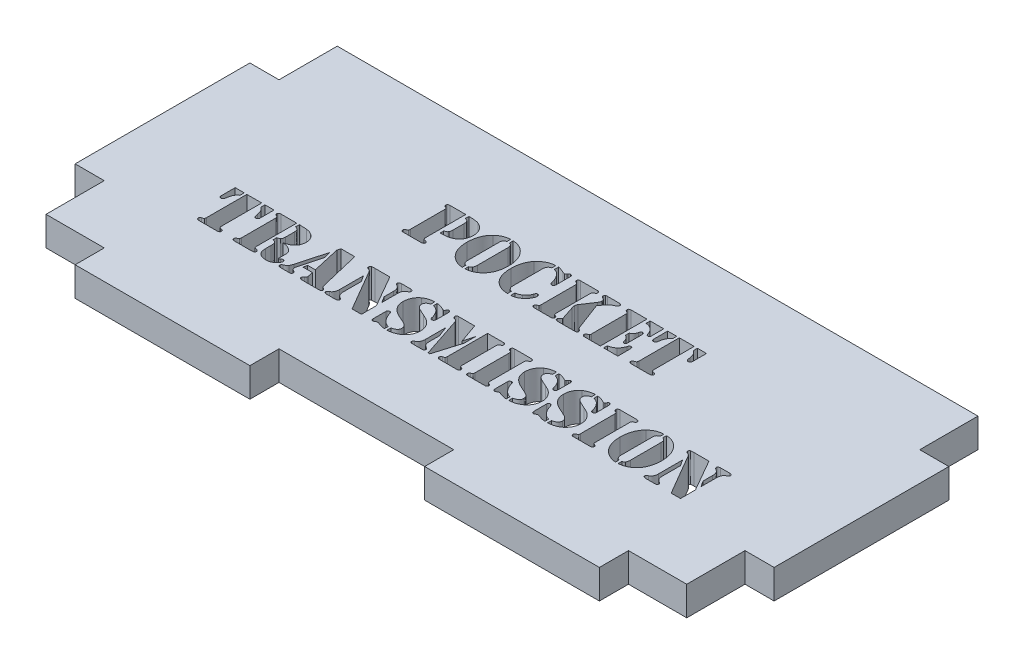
from build123d import *

# Parameters (mm, degrees)
SKETCH1_W           = 69.85
SKETCH1_H           = 31.75
BOSS_EXTRUDE1_DEPTH = 3.175
SKETCH2_W           = 19.05
SKETCH2_H           = 3.175
SKETCH2_W_2         = 3.175
SKETCH2_H_2         = 19.05
BOSS_EXTRUDE2_DEPTH = 3.175
CUT_EXTRUDE3_DEPTH  = 3.175


with BuildPart() as part:
    # Sketch1 → Boss-Extrude1 (new body)
    with BuildSketch(Plane(origin=(0, 0, 0), x_dir=(1, 0, 0), z_dir=(0, 1, 0))):
        with Locations((34.925, 15.875)):
            Rectangle(SKETCH1_W, SKETCH1_H)
    extrude(amount=BOSS_EXTRUDE1_DEPTH)

    # Sketch2 → Boss-Extrude2 (add)
    with BuildSketch(Plane(origin=(0, 0, 0), x_dir=(1, 0, 0), z_dir=(0, 1, 0))):
        with Locations((53.975, -1.5875)):
            Rectangle(SKETCH2_W, SKETCH2_H)
        with Locations((15.875, -1.5875)):
            Rectangle(SKETCH2_W, SKETCH2_H)
        with Locations((-1.5875, 15.875)):
            Rectangle(SKETCH2_W_2, SKETCH2_H_2)
        with Locations((71.4375, 15.875)):
            Rectangle(SKETCH2_W_2, SKETCH2_H_2)
    extrude(amount=BOSS_EXTRUDE2_DEPTH)

    # Sketch3 → Cut-Extrude3 (cut)
    with BuildSketch(Plane(origin=(0, 3.175, 0), x_dir=(1, 0, 0), z_dir=(0, 1, 0))):
        with BuildLine():
            Line((22.895277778, 22.86), (22.895277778, 18.483350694))
            add(Edge.make_bspline(
                [(22.895277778, 18.483350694), (22.895469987, 18.460808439), (22.895826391, 18.419009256), (22.909519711, 18.362104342), (22.924723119, 18.312569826), (22.945179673, 18.287768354), (22.954809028, 18.27609375)],
                knots=[0, 0, 0, 0, 1.221894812, 2.265709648, 3.183630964, 4, 4, 4, 4], degree=3))
            add(Edge.make_bspline(
                [(22.954809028, 18.27609375), (22.964582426, 18.265594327), (22.981897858, 18.246992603), (23.01079047, 18.229841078), (23.04171132, 18.221575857), (23.080402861, 18.213732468), (23.133836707, 18.198066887), (23.17522877, 18.188727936), (23.198446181, 18.183489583)],
                knots=[0, 0, 0, 0, 0.967781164, 1.714608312, 2.234126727, 3.127399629, 4.388716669, 6, 6, 6, 6], degree=3))
            add(Edge.make_bspline(
                [(23.198446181, 18.183489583), (23.227146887, 18.17617307), (23.279954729, 18.162711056), (23.343827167, 18.116601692), (23.383269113, 18.052864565), (23.387141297, 18.004721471), (23.389166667, 17.979539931)],
                knots=[0, 0, 0, 0, 1.155259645, 2.125619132, 3.019593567, 4, 4, 4, 4], degree=3))
            add(Edge.make_bspline(
                [(23.389166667, 17.979539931), (23.387791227, 17.964302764), (23.385033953, 17.933757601), (23.365428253, 17.889973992), (23.330397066, 17.853061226), (23.301070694, 17.834126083), (23.285538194, 17.824097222)],
                knots=[0, 0, 0, 0, 0.931770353, 1.867872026, 2.870733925, 4, 4, 4, 4], degree=3))
            add(Edge.make_bspline(
                [(23.285538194, 17.824097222), (23.271005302, 17.817405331), (23.238873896, 17.802609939), (23.181502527, 17.788880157), (23.111888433, 17.782213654), (23.061392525, 17.78077512), (23.034184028, 17.78)],
                knots=[0, 0, 0, 0, 0.744408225, 1.645844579, 2.731520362, 4, 4, 4, 4], degree=3))
            Line((23.034184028, 17.78), (22.898585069, 17.78))
            Line((22.898585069, 17.78), (21.269192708, 17.78))
            Line((21.269192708, 17.78), (21.172178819, 17.78))
            add(Edge.make_bspline(
                [(21.172178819, 17.78), (21.153029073, 17.780633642), (21.117075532, 17.781823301), (21.066161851, 17.790634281), (21.021697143, 17.805451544), (20.984728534, 17.827930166), (20.954435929, 17.855778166), (20.93520508, 17.890856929), (20.921921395, 17.930096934), (20.920483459, 17.958100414), (20.919722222, 17.972925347)],
                knots=[0, 0, 0, 0, 1.275809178, 2.395324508, 3.433364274, 4.378530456, 5.262016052, 6.140052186, 7.015350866, 8, 8, 8, 8], degree=3))
            add(Edge.make_bspline(
                [(20.919722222, 17.972925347), (20.921222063, 17.996352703), (20.924043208, 18.040418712), (20.950507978, 18.100544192), (20.996757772, 18.146469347), (21.036525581, 18.163481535), (21.057526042, 18.172465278)],
                knots=[0, 0, 0, 0, 1.074896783, 2.021841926, 2.955380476, 4, 4, 4, 4], degree=3))
            add(Edge.make_bspline(
                [(21.057526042, 18.172465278), (21.074822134, 18.17864028), (21.105038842, 18.189428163), (21.144155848, 18.204359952), (21.171598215, 18.213889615), (21.193832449, 18.222453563), (21.214066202, 18.238630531), (21.224571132, 18.255421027), (21.230607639, 18.265069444)],
                knots=[0, 0, 0, 0, 1.641128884, 2.867093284, 3.73955991, 4.239698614, 4.988468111, 6, 6, 6, 6], degree=3))
            add(Edge.make_bspline(
                [(21.230607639, 18.265069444), (21.237363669, 18.276230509), (21.251916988, 18.300272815), (21.263948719, 18.344177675), (21.271868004, 18.395951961), (21.272277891, 18.433330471), (21.2725, 18.453585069)],
                knots=[0, 0, 0, 0, 0.795728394, 1.714096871, 2.761318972, 4, 4, 4, 4], degree=3))
            Line((21.2725, 18.453585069), (21.2725, 22.173185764))
            add(Edge.make_bspline(
                [(21.2725, 22.173185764), (21.272230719, 22.193797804), (21.271728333, 22.232252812), (21.264269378, 22.285233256), (21.251650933, 22.330030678), (21.237339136, 22.354569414), (21.230607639, 22.366111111)],
                knots=[0, 0, 0, 0, 1.234380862, 2.302932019, 3.201790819, 4, 4, 4, 4], degree=3))
            add(Edge.make_bspline(
                [(21.230607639, 22.366111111), (21.224567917, 22.375751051), (21.214057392, 22.392526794), (21.193853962, 22.40878372), (21.171408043, 22.417158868), (21.144480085, 22.428408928), (21.104958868, 22.442644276), (21.074793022, 22.453566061), (21.057526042, 22.459817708)],
                knots=[0, 0, 0, 0, 1.009569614, 1.75688657, 2.256055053, 3.138468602, 4.362054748, 6, 6, 6, 6], degree=3))
            add(Edge.make_bspline(
                [(21.057526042, 22.459817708), (21.036405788, 22.468683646), (20.995921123, 22.485678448), (20.950814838, 22.53407303), (20.923983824, 22.595138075), (20.921201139, 22.639950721), (20.919722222, 22.663767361)],
                knots=[0, 0, 0, 0, 1.03007389, 1.974512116, 2.923511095, 4, 4, 4, 4], degree=3))
            add(Edge.make_bspline(
                [(20.919722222, 22.663767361), (20.920501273, 22.678948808), (20.921974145, 22.707650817), (20.934942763, 22.747764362), (20.954467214, 22.783091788), (20.984693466, 22.811046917), (21.021925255, 22.833185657), (21.06589913, 22.849724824), (21.117117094, 22.858062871), (21.153043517, 22.8593268), (21.172178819, 22.86)],
                knots=[0, 0, 0, 0, 1.002003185, 1.894384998, 2.766311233, 3.643649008, 4.582238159, 5.621343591, 6.733068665, 8, 8, 8, 8], degree=3))
            Line((21.172178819, 22.86), (21.269192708, 22.86))
            Line((21.269192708, 22.86), (22.895277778, 22.86))
        make_face()
        with BuildLine():
            Line((23.248055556, 19.715868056), (23.248055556, 20.111640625))
            add(Edge.make_bspline(
                [(23.248055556, 20.111640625), (23.273143, 20.117528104), (23.319624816, 20.128436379), (23.382705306, 20.148710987), (23.434323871, 20.167608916), (23.488014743, 20.194379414), (23.543620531, 20.241908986), (23.575215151, 20.290013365), (23.592013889, 20.315590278)],
                knots=[0, 0, 0, 0, 1.119487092, 2.074176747, 2.878005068, 3.506600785, 4.674269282, 6, 6, 6, 6], degree=3))
            add(Edge.make_bspline(
                [(23.592013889, 20.315590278), (23.60474764, 20.341317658), (23.63152126, 20.395411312), (23.653408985, 20.488519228), (23.669961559, 20.5924296), (23.670897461, 20.666077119), (23.671388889, 20.704748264)],
                knots=[0, 0, 0, 0, 0.856139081, 1.800093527, 2.844863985, 4, 4, 4, 4], degree=3))
            Line((23.671388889, 20.704748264), (23.671388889, 21.910807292))
            add(Edge.make_bspline(
                [(23.671388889, 21.910807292), (23.671445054, 21.938020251), (23.671550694, 21.989204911), (23.665473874, 22.059758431), (23.658791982, 22.119775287), (23.642577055, 22.184542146), (23.6097964, 22.259140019), (23.564702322, 22.3041628), (23.541302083, 22.327526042)],
                knots=[0, 0, 0, 0, 1.082886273, 2.036793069, 2.819037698, 3.482671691, 4.693706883, 6, 6, 6, 6], degree=3))
            add(Edge.make_bspline(
                [(23.541302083, 22.327526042), (23.522391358, 22.34411997), (23.483887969, 22.377906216), (23.413993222, 22.41463826), (23.336090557, 22.442890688), (23.2802455, 22.452594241), (23.251362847, 22.457612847)],
                knots=[0, 0, 0, 0, 0.932005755, 1.897620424, 2.912664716, 4, 4, 4, 4], degree=3))
            Line((23.251362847, 22.457612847), (23.251362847, 22.86))
            add(Edge.make_bspline(
                [(23.251362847, 22.86), (23.313101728, 22.85956465), (23.432207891, 22.858724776), (23.604705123, 22.852662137), (23.764515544, 22.839778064), (23.912219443, 22.825673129), (24.047003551, 22.803927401), (24.169843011, 22.780573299), (24.280179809, 22.751441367), (24.348076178, 22.726363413), (24.380251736, 22.714479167)],
                knots=[0, 0, 0, 0, 1.295158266, 2.498609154, 3.619586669, 4.658178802, 5.609980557, 6.482294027, 7.280771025, 8, 8, 8, 8], degree=3))
            add(Edge.make_bspline(
                [(24.380251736, 22.714479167), (24.447768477, 22.684399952), (24.579811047, 22.625573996), (24.758781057, 22.506001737), (24.916365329, 22.364873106), (25.002136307, 22.253981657), (25.045017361, 22.198541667)],
                knots=[0, 0, 0, 0, 1.038412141, 2.030823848, 3.015513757, 4, 4, 4, 4], degree=3))
            add(Edge.make_bspline(
                [(25.045017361, 22.198541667), (25.06503198, 22.168366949), (25.105047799, 22.108037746), (25.155483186, 22.011499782), (25.199067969, 21.910318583), (25.23430933, 21.803740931), (25.260021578, 21.691737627), (25.280726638, 21.575588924), (25.291106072, 21.453852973), (25.293132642, 21.370998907), (25.294166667, 21.328723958)],
                knots=[0, 0, 0, 0, 0.944744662, 1.888855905, 2.838652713, 3.818544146, 4.814459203, 5.836462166, 6.896089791, 8, 8, 8, 8], degree=3))
            add(Edge.make_bspline(
                [(25.294166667, 21.328723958), (25.29312704, 21.282041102), (25.291085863, 21.190385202), (25.280794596, 21.056189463), (25.260296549, 20.928530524), (25.233791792, 20.807266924), (25.196250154, 20.693193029), (25.154048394, 20.584554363), (25.102202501, 20.48267175), (25.061021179, 20.419610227), (25.040607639, 20.388350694)],
                knots=[0, 0, 0, 0, 1.133013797, 2.224529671, 3.262463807, 4.26834125, 5.232774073, 6.173290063, 7.094501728, 8, 8, 8, 8], degree=3))
            add(Edge.make_bspline(
                [(25.040607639, 20.388350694), (25.01906609, 20.358557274), (24.976164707, 20.299221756), (24.902895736, 20.217422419), (24.822592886, 20.142727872), (24.738079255, 20.071035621), (24.645378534, 20.008134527), (24.547331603, 19.949811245), (24.442829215, 19.898285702), (24.369788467, 19.868656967), (24.332847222, 19.853671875)],
                knots=[0, 0, 0, 0, 0.979116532, 1.949973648, 2.919645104, 3.899984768, 4.899451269, 5.900259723, 6.938030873, 8, 8, 8, 8], degree=3))
            add(Edge.make_bspline(
                [(24.332847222, 19.853671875), (24.299887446, 19.842652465), (24.230911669, 19.819591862), (24.120922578, 19.791031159), (24.000278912, 19.768865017), (23.869931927, 19.748149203), (23.728858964, 19.7350226), (23.577836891, 19.723585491), (23.416416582, 19.717061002), (23.305387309, 19.716274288), (23.248055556, 19.715868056)],
                knots=[0, 0, 0, 0, 0.759180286, 1.588756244, 2.479991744, 3.438352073, 4.471328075, 5.574203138, 6.747400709, 8, 8, 8, 8], degree=3))
        make_face()
        with BuildLine():
            add(Edge.make_bspline(
                [(27.693055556, 22.554626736), (27.662954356, 22.542884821), (27.60599226, 22.520664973), (27.52957669, 22.477268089), (27.467161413, 22.427690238), (27.416854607, 22.370987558), (27.382291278, 22.302051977), (27.356952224, 22.222179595), (27.343566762, 22.128049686), (27.341421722, 22.06114184), (27.340277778, 22.025460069)],
                knots=[0, 0, 0, 0, 1.118377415, 2.116364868, 3.030964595, 3.870538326, 4.719041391, 5.681309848, 6.763448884, 8, 8, 8, 8], degree=3))
            Line((27.340277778, 22.025460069), (27.340277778, 18.706041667))
            add(Edge.make_bspline(
                [(27.340277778, 18.706041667), (27.340963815, 18.655596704), (27.342230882, 18.562428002), (27.360306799, 18.434798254), (27.385478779, 18.328977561), (27.417423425, 18.271954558), (27.431779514, 18.246328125)],
                knots=[0, 0, 0, 0, 1.27427824, 2.353512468, 3.260059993, 4, 4, 4, 4], degree=3))
            add(Edge.make_bspline(
                [(27.431779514, 18.246328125), (27.445383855, 18.228714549), (27.473966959, 18.19170793), (27.534302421, 18.148116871), (27.608571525, 18.112886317), (27.66374043, 18.096359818), (27.693055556, 18.087578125)],
                knots=[0, 0, 0, 0, 0.851726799, 1.789501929, 2.825406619, 4, 4, 4, 4], degree=3))
            Line((27.693055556, 18.087578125), (27.693055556, 17.68078125))
            add(Edge.make_bspline(
                [(27.693055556, 17.68078125), (27.625274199, 17.687705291), (27.491425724, 17.701378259), (27.295983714, 17.741750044), (27.108797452, 17.796566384), (26.930608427, 17.867933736), (26.760021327, 17.952531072), (26.598558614, 18.053576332), (26.4451222, 18.169571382), (26.351355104, 18.257924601), (26.303993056, 18.302552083)],
                knots=[0, 0, 0, 0, 1.051385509, 2.076180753, 3.076110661, 4.059092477, 5.035964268, 6.012044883, 6.995877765, 8, 8, 8, 8], degree=3))
            add(Edge.make_bspline(
                [(26.303993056, 18.302552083), (26.245521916, 18.364473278), (26.128953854, 18.487919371), (25.980633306, 18.696792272), (25.855853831, 18.923103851), (25.752810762, 19.166870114), (25.673703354, 19.429024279), (25.616908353, 19.708347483), (25.581998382, 20.005656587), (25.578292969, 20.209658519), (25.576388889, 20.314487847)],
                knots=[0, 0, 0, 0, 0.929101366, 1.852256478, 2.788058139, 3.746505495, 4.736611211, 5.773063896, 6.855656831, 8, 8, 8, 8], degree=3))
            add(Edge.make_bspline(
                [(25.576388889, 20.314487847), (25.578586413, 20.42006748), (25.582887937, 20.626733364), (25.620352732, 20.928375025), (25.679153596, 21.214559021), (25.762795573, 21.48433502), (25.870510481, 21.736730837), (26.00316814, 21.969192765), (26.155171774, 22.185220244), (26.277236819, 22.310292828), (26.338168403, 22.372725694)],
                knots=[0, 0, 0, 0, 1.123125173, 2.198451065, 3.229210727, 4.228575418, 5.199030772, 6.142910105, 7.072990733, 8, 8, 8, 8], degree=3))
            add(Edge.make_bspline(
                [(26.338168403, 22.372725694), (26.386298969, 22.417321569), (26.481032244, 22.505097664), (26.633826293, 22.619953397), (26.792248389, 22.717593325), (26.956874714, 22.79876286), (27.128347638, 22.864355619), (27.308668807, 22.912688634), (27.49756306, 22.946350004), (27.627145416, 22.95561081), (27.693055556, 22.960321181)],
                knots=[0, 0, 0, 0, 1.041191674, 2.049331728, 3.02892685, 3.991699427, 4.959285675, 5.938654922, 6.951527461, 8, 8, 8, 8], degree=3))
            Line((27.693055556, 22.960321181), (27.693055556, 22.554626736))
        make_face()
        with BuildLine():
            Line((27.975277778, 22.554626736), (27.975277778, 22.960321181))
            add(Edge.make_bspline(
                [(27.975277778, 22.960321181), (28.041195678, 22.95564841), (28.170432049, 22.946487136), (28.359215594, 22.912350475), (28.539702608, 22.864631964), (28.711677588, 22.798448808), (28.87698314, 22.717927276), (29.035588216, 22.619908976), (29.188409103, 22.505109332), (29.283138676, 22.4173255), (29.331267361, 22.372725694)],
                knots=[0, 0, 0, 0, 1.04780179, 2.054284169, 3.038654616, 4.005621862, 4.973010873, 5.95197931, 6.959474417, 8, 8, 8, 8], degree=3))
            add(Edge.make_bspline(
                [(29.331267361, 22.372725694), (29.392438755, 22.309464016), (29.514582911, 22.18314608), (29.668628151, 21.967937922), (29.799104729, 21.735741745), (29.908210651, 21.486909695), (29.990271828, 21.218852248), (30.049593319, 20.933639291), (30.085159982, 20.629945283), (30.089642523, 20.421520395), (30.091944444, 20.314487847)],
                knots=[0, 0, 0, 0, 0.935258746, 1.86748057, 2.805880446, 3.76541513, 4.752258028, 5.782852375, 6.861426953, 8, 8, 8, 8], degree=3))
            add(Edge.make_bspline(
                [(30.091944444, 20.314487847), (30.090043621, 20.209657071), (30.086344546, 20.005652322), (30.051389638, 19.708363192), (29.994754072, 19.428969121), (29.91512906, 19.167199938), (29.814079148, 18.922509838), (29.687452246, 18.697107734), (29.539464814, 18.488208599), (29.423518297, 18.36451037), (29.365442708, 18.302552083)],
                knots=[0, 0, 0, 0, 1.144670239, 2.227572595, 3.264321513, 4.254710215, 5.211875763, 6.149896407, 7.07331537, 8, 8, 8, 8], degree=3))
            add(Edge.make_bspline(
                [(29.365442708, 18.302552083), (29.31815084, 18.257471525), (29.224698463, 18.168388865), (29.070497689, 18.052698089), (28.909784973, 17.950091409), (28.73874776, 17.86591038), (28.560857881, 17.793991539), (28.373227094, 17.741089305), (28.177759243, 17.699802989), (28.043450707, 17.687185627), (27.975277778, 17.68078125)],
                knots=[0, 0, 0, 0, 1.006659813, 1.989237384, 2.967081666, 3.942707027, 4.924434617, 5.92149591, 6.944983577, 8, 8, 8, 8], degree=3))
            Line((27.975277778, 17.68078125), (27.975277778, 18.087578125))
            add(Edge.make_bspline(
                [(27.975277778, 18.087578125), (28.00463596, 18.094989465), (28.057451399, 18.108322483), (28.127566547, 18.141429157), (28.183139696, 18.18797538), (28.211607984, 18.226170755), (28.226631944, 18.246328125)],
                knots=[0, 0, 0, 0, 1.186680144, 2.134840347, 3.015673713, 4, 4, 4, 4], degree=3))
            add(Edge.make_bspline(
                [(28.226631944, 18.246328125), (28.242420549, 18.274513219), (28.276099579, 18.334635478), (28.30639875, 18.442014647), (28.324680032, 18.567581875), (28.326879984, 18.657821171), (28.328055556, 18.706041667)],
                knots=[0, 0, 0, 0, 0.810910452, 1.729771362, 2.786874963, 4, 4, 4, 4], degree=3))
            Line((28.328055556, 18.706041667), (28.328055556, 22.025460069))
            add(Edge.make_bspline(
                [(28.328055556, 22.025460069), (28.327199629, 22.057109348), (28.325570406, 22.117352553), (28.313739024, 22.202480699), (28.293717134, 22.278043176), (28.271462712, 22.321941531), (28.260807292, 22.342960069)],
                knots=[0, 0, 0, 0, 1.157578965, 2.203407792, 3.139791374, 4, 4, 4, 4], degree=3))
            add(Edge.make_bspline(
                [(28.260807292, 22.342960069), (28.245247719, 22.367229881), (28.215478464, 22.413663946), (28.153637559, 22.471972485), (28.072216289, 22.51743209), (28.010207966, 22.541224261), (27.975277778, 22.554626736)],
                knots=[0, 0, 0, 0, 0.947326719, 1.812466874, 2.767730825, 4, 4, 4, 4], degree=3))
        make_face()
        with BuildLine():
            Line((32.631944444, 22.960321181), (32.631944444, 22.505017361))
            add(Edge.make_bspline(
                [(32.631944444, 22.505017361), (32.598091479, 22.497926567), (32.533101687, 22.484313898), (32.44449581, 22.442286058), (32.369711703, 22.383639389), (32.309673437, 22.307765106), (32.262030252, 22.215976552), (32.232024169, 22.10635534), (32.211618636, 21.98065379), (32.2096532, 21.891061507), (32.208611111, 21.843559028)],
                knots=[0, 0, 0, 0, 0.953787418, 1.831049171, 2.684868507, 3.559300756, 4.486463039, 5.524990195, 6.687731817, 8, 8, 8, 8], degree=3))
            Line((32.208611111, 21.843559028), (32.208611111, 18.778802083))
            Line((32.208611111, 18.778802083), (32.208611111, 18.620052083))
            add(Edge.make_bspline(
                [(32.208611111, 18.620052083), (32.210556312, 18.590861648), (32.214635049, 18.529654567), (32.240800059, 18.439738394), (32.27852972, 18.353535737), (32.314671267, 18.303504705), (32.332083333, 18.279401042)],
                knots=[0, 0, 0, 0, 0.950886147, 1.993836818, 3.03348221, 4, 4, 4, 4], degree=3))
            add(Edge.make_bspline(
                [(32.332083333, 18.279401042), (32.351048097, 18.257597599), (32.386694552, 18.216615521), (32.454105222, 18.168795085), (32.53802955, 18.144555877), (32.598390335, 18.13627733), (32.631944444, 18.131675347)],
                knots=[0, 0, 0, 0, 1.001842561, 1.88307835, 2.823219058, 4, 4, 4, 4], degree=3))
            Line((32.631944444, 18.131675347), (32.631944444, 17.68078125))
            add(Edge.make_bspline(
                [(32.631944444, 17.68078125), (32.573104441, 17.681739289), (32.456988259, 17.683629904), (32.285967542, 17.701624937), (32.120967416, 17.731515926), (31.961855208, 17.772517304), (31.8078267, 17.823533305), (31.66107169, 17.889772), (31.519080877, 17.965300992), (31.429836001, 18.024718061), (31.385095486, 18.054505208)],
                knots=[0, 0, 0, 0, 1.067335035, 2.106302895, 3.11595291, 4.107273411, 5.085615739, 6.055744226, 7.025299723, 8, 8, 8, 8], degree=3))
            add(Edge.make_bspline(
                [(31.385095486, 18.054505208), (31.347213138, 18.082663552), (31.271697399, 18.138795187), (31.165570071, 18.232021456), (31.066426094, 18.332175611), (30.974672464, 18.439388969), (30.890460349, 18.553703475), (30.813218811, 18.675311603), (30.742745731, 18.804135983), (30.679786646, 18.940047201), (30.624962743, 19.082800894), (30.576163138, 19.231669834), (30.535613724, 19.387087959), (30.502656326, 19.549080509), (30.476147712, 19.717150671), (30.45766042, 19.891551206), (30.446268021, 20.072165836), (30.445244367, 20.194673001), (30.444722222, 20.257161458)],
                knots=[0, 0, 0, 0, 0.908578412, 1.811185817, 2.71681129, 3.620139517, 4.525875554, 5.44845311, 6.392090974, 7.351331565, 8.330282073, 9.334977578, 10.366450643, 11.42110793, 12.516950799, 13.641387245, 14.796918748, 16, 16, 16, 16], degree=3))
            add(Edge.make_bspline(
                [(30.444722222, 20.257161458), (30.446656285, 20.348739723), (30.450471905, 20.529410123), (30.47981035, 20.795120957), (30.526826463, 21.051461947), (30.593986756, 21.297075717), (30.679450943, 21.530262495), (30.782486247, 21.748764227), (30.901703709, 21.952324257), (30.997135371, 22.07492521), (31.044444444, 22.135703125)],
                knots=[0, 0, 0, 0, 1.092897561, 2.156125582, 3.186761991, 4.200837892, 5.191671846, 6.147217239, 7.081505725, 8, 8, 8, 8], degree=3))
            add(Edge.make_bspline(
                [(31.044444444, 22.135703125), (31.09503768, 22.193846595), (31.195559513, 22.309369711), (31.367824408, 22.461427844), (31.552187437, 22.597985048), (31.749200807, 22.714729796), (31.951286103, 22.810161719), (32.153032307, 22.879231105), (32.351156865, 22.922813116), (32.482541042, 22.928005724), (32.547057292, 22.930555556)],
                knots=[0, 0, 0, 0, 1.055631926, 2.097396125, 3.14229843, 4.197244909, 5.231735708, 6.200378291, 7.116295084, 8, 8, 8, 8], degree=3))
            Line((32.547057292, 22.930555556), (32.631944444, 22.960321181))
        make_face()
        with BuildLine():
            Line((32.914166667, 22.500607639), (32.914166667, 22.957013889))
            add(Edge.make_bspline(
                [(32.914166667, 22.957013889), (32.943219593, 22.951245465), (32.998505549, 22.940268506), (33.077313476, 22.922822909), (33.147148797, 22.904290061), (33.213772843, 22.883850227), (33.286972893, 22.857186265), (33.378678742, 22.8231684), (33.493235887, 22.777672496), (33.577134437, 22.743237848), (33.623029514, 22.724401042)],
                knots=[0, 0, 0, 0, 0.950584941, 1.808905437, 2.589848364, 3.268756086, 4.044606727, 5.089493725, 6.407863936, 8, 8, 8, 8], degree=3))
            add(Edge.make_bspline(
                [(33.623029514, 22.724401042), (33.651982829, 22.713137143), (33.704447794, 22.692726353), (33.775632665, 22.668585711), (33.831040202, 22.652088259), (33.863294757, 22.64942925), (33.876588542, 22.648333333)],
                knots=[0, 0, 0, 0, 1.402502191, 2.541409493, 3.398838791, 4, 4, 4, 4], degree=3))
            add(Edge.make_bspline(
                [(33.876588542, 22.648333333), (33.893714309, 22.649540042), (33.926885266, 22.651877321), (33.972861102, 22.672218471), (34.013023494, 22.703480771), (34.031364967, 22.732529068), (34.040850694, 22.747552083)],
                knots=[0, 0, 0, 0, 1.015732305, 1.967375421, 2.948780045, 4, 4, 4, 4], degree=3))
            Line((34.040850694, 22.747552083), (34.089357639, 22.839053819))
            add(Edge.make_bspline(
                [(34.089357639, 22.839053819), (34.097711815, 22.85299845), (34.114224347, 22.880560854), (34.154127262, 22.909686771), (34.202427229, 22.928418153), (34.237984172, 22.929812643), (34.256927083, 22.930555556)],
                knots=[0, 0, 0, 0, 0.958958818, 1.895439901, 2.87879859, 4, 4, 4, 4], degree=3))
            add(Edge.make_bspline(
                [(34.256927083, 22.930555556), (34.27278967, 22.929997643), (34.303023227, 22.928934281), (34.345637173, 22.918849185), (34.382768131, 22.902578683), (34.413217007, 22.878873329), (34.43709082, 22.848966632), (34.455202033, 22.813150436), (34.464709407, 22.770074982), (34.465806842, 22.739509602), (34.466388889, 22.723298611)],
                knots=[0, 0, 0, 0, 1.130750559, 2.155172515, 3.106087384, 4.003385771, 4.880125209, 5.818656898, 6.843078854, 8, 8, 8, 8], degree=3))
            Line((34.466388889, 22.723298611), (34.466388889, 21.160052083))
            add(Edge.make_bspline(
                [(34.466388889, 21.160052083), (34.465536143, 21.137571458), (34.463928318, 21.095184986), (34.452398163, 21.036479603), (34.431947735, 20.986532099), (34.409782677, 20.961504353), (34.399140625, 20.949487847)],
                knots=[0, 0, 0, 0, 1.188812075, 2.241465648, 3.155679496, 4, 4, 4, 4], degree=3))
            add(Edge.make_bspline(
                [(34.399140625, 20.949487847), (34.387734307, 20.939449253), (34.365928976, 20.920258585), (34.327992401, 20.899746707), (34.287856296, 20.887165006), (34.259956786, 20.885355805), (34.245902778, 20.884444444)],
                knots=[0, 0, 0, 0, 1.066270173, 2.038376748, 3.011858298, 4, 4, 4, 4], degree=3))
            add(Edge.make_bspline(
                [(34.245902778, 20.884444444), (34.231863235, 20.88496204), (34.2044168, 20.885973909), (34.165706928, 20.897212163), (34.131175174, 20.915574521), (34.100461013, 20.941430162), (34.075617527, 20.977079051), (34.051900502, 21.019747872), (34.031447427, 21.071777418), (34.020312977, 21.109975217), (34.014392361, 21.130286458)],
                knots=[0, 0, 0, 0, 0.912283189, 1.783456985, 2.597178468, 3.44604065, 4.369866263, 5.408954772, 6.622241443, 8, 8, 8, 8], degree=3))
            add(Edge.make_bspline(
                [(34.014392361, 21.130286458), (34.001916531, 21.177069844), (33.978327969, 21.265525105), (33.939054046, 21.389089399), (33.90287998, 21.497485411), (33.875126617, 21.562950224), (33.862256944, 21.593307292)],
                knots=[0, 0, 0, 0, 1.190820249, 2.251532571, 3.189208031, 4, 4, 4, 4], degree=3))
            add(Edge.make_bspline(
                [(33.862256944, 21.593307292), (33.835552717, 21.649977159), (33.783635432, 21.760152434), (33.694343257, 21.912453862), (33.600782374, 22.049545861), (33.530490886, 22.129720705), (33.49625, 22.168776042)],
                knots=[0, 0, 0, 0, 1.097207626, 2.133146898, 3.090605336, 4, 4, 4, 4], degree=3))
            add(Edge.make_bspline(
                [(33.49625, 22.168776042), (33.451734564, 22.21445463), (33.367736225, 22.300647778), (33.246741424, 22.38521133), (33.149167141, 22.435869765), (33.074251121, 22.46555239), (32.995601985, 22.488078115), (32.941477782, 22.496405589), (32.914166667, 22.500607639)],
                knots=[0, 0, 0, 0, 1.674087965, 3.158917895, 3.854600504, 4.561463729, 5.274113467, 6, 6, 6, 6], degree=3))
        make_face()
        with BuildLine():
            Line((32.984722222, 17.68078125), (32.984722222, 18.131675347))
            add(Edge.make_bspline(
                [(32.984722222, 18.131675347), (33.034231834, 18.137645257), (33.136246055, 18.149946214), (33.288650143, 18.196118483), (33.444667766, 18.262772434), (33.545357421, 18.321597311), (33.597673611, 18.352161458)],
                knots=[0, 0, 0, 0, 0.908970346, 1.872927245, 2.894818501, 4, 4, 4, 4], degree=3))
            add(Edge.make_bspline(
                [(33.597673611, 18.352161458), (33.625937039, 18.371546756), (33.682808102, 18.410553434), (33.762879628, 18.478152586), (33.836577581, 18.556124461), (33.905943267, 18.641971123), (33.969022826, 18.734492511), (34.024900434, 18.832282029), (34.071280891, 18.934604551), (34.095099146, 19.005678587), (34.106996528, 19.041180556)],
                knots=[0, 0, 0, 0, 0.940821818, 1.893101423, 2.870917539, 3.882719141, 4.921143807, 5.942511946, 6.972270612, 8, 8, 8, 8], degree=3))
            add(Edge.make_bspline(
                [(34.106996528, 19.041180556), (34.113371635, 19.059642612), (34.125386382, 19.094436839), (34.145690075, 19.141625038), (34.168056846, 19.180366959), (34.199561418, 19.220086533), (34.252519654, 19.256597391), (34.301828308, 19.259931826), (34.327482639, 19.261666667)],
                knots=[0, 0, 0, 0, 1.039188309, 1.958489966, 2.729866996, 3.410937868, 4.652961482, 6, 6, 6, 6], degree=3))
            add(Edge.make_bspline(
                [(34.327482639, 19.261666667), (34.341905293, 19.260800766), (34.369824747, 19.259124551), (34.40990949, 19.246506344), (34.446028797, 19.224896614), (34.477222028, 19.195066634), (34.504198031, 19.160064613), (34.522691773, 19.11925957), (34.535853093, 19.074699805), (34.536573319, 19.043121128), (34.536944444, 19.026848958)],
                knots=[0, 0, 0, 0, 0.985874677, 1.908461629, 2.844318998, 3.840721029, 4.846597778, 5.847748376, 6.890966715, 8, 8, 8, 8], degree=3))
            add(Edge.make_bspline(
                [(34.536944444, 19.026848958), (34.535345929, 18.99731067), (34.531941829, 18.934407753), (34.505179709, 18.83638249), (34.464082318, 18.729960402), (34.408259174, 18.616725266), (34.339393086, 18.502472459), (34.262820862, 18.388709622), (34.173577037, 18.282221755), (34.109543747, 18.214404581), (34.077230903, 18.180182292)],
                knots=[0, 0, 0, 0, 0.720636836, 1.534623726, 2.466244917, 3.505681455, 4.61221219, 5.722339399, 6.850633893, 8, 8, 8, 8], degree=3))
            add(Edge.make_bspline(
                [(34.077230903, 18.180182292), (34.036296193, 18.141298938), (33.956646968, 18.065641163), (33.830219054, 17.965942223), (33.702525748, 17.881608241), (33.571479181, 17.813048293), (33.435438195, 17.759535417), (33.292312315, 17.720372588), (33.141535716, 17.691783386), (33.037764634, 17.68450274), (32.984722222, 17.68078125)],
                knots=[0, 0, 0, 0, 1.099567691, 2.139497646, 3.132422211, 4.077142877, 5.015821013, 5.974733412, 6.964788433, 8, 8, 8, 8], degree=3))
        make_face()
        with BuildLine():
            Line((37.150807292, 17.78), (35.521414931, 17.78))
            Line((35.521414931, 17.78), (35.424401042, 17.78))
            add(Edge.make_bspline(
                [(35.424401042, 17.78), (35.405251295, 17.780633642), (35.369297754, 17.781823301), (35.318384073, 17.790634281), (35.273919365, 17.805451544), (35.236950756, 17.827930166), (35.206658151, 17.855778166), (35.187427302, 17.890856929), (35.174143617, 17.930096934), (35.172705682, 17.958100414), (35.171944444, 17.972925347)],
                knots=[0, 0, 0, 0, 1.275809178, 2.395324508, 3.433364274, 4.378530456, 5.262016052, 6.140052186, 7.015350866, 8, 8, 8, 8], degree=3))
            add(Edge.make_bspline(
                [(35.171944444, 17.972925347), (35.173444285, 17.996352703), (35.17626543, 18.040418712), (35.2027302, 18.100544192), (35.248979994, 18.146469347), (35.288747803, 18.163481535), (35.309748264, 18.172465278)],
                knots=[0, 0, 0, 0, 1.074896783, 2.021841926, 2.955380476, 4, 4, 4, 4], degree=3))
            add(Edge.make_bspline(
                [(35.309748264, 18.172465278), (35.327044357, 18.17864028), (35.357261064, 18.189428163), (35.39637807, 18.204359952), (35.423820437, 18.213889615), (35.446054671, 18.222453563), (35.466288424, 18.238630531), (35.476793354, 18.255421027), (35.482829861, 18.265069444)],
                knots=[0, 0, 0, 0, 1.641128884, 2.867093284, 3.73955991, 4.239698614, 4.988468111, 6, 6, 6, 6], degree=3))
            add(Edge.make_bspline(
                [(35.482829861, 18.265069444), (35.489585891, 18.276230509), (35.50413921, 18.300272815), (35.516170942, 18.344177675), (35.524090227, 18.395951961), (35.524500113, 18.433330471), (35.524722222, 18.453585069)],
                knots=[0, 0, 0, 0, 0.795728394, 1.714096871, 2.761318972, 4, 4, 4, 4], degree=3))
            Line((35.524722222, 18.453585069), (35.524722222, 22.173185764))
            add(Edge.make_bspline(
                [(35.524722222, 22.173185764), (35.524452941, 22.193797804), (35.523950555, 22.232252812), (35.5164916, 22.285233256), (35.503873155, 22.330030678), (35.489561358, 22.354569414), (35.482829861, 22.366111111)],
                knots=[0, 0, 0, 0, 1.234380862, 2.302932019, 3.201790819, 4, 4, 4, 4], degree=3))
            add(Edge.make_bspline(
                [(35.482829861, 22.366111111), (35.476790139, 22.375751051), (35.466279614, 22.392526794), (35.446076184, 22.40878372), (35.423630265, 22.417158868), (35.396702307, 22.428408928), (35.357181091, 22.442644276), (35.327015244, 22.453566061), (35.309748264, 22.459817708)],
                knots=[0, 0, 0, 0, 1.009569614, 1.75688657, 2.256055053, 3.138468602, 4.362054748, 6, 6, 6, 6], degree=3))
            add(Edge.make_bspline(
                [(35.309748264, 22.459817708), (35.28862801, 22.468683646), (35.248143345, 22.485678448), (35.20303706, 22.53407303), (35.176206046, 22.595138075), (35.173423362, 22.639950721), (35.171944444, 22.663767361)],
                knots=[0, 0, 0, 0, 1.03007389, 1.974512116, 2.923511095, 4, 4, 4, 4], degree=3))
            add(Edge.make_bspline(
                [(35.171944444, 22.663767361), (35.172723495, 22.678948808), (35.174196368, 22.707650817), (35.187164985, 22.747764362), (35.206689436, 22.783091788), (35.236915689, 22.811046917), (35.274147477, 22.833185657), (35.318121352, 22.849724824), (35.369339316, 22.858062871), (35.405265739, 22.8593268), (35.424401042, 22.86)],
                knots=[0, 0, 0, 0, 1.002003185, 1.894384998, 2.766311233, 3.643649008, 4.582238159, 5.621343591, 6.733068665, 8, 8, 8, 8], degree=3))
            Line((35.424401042, 22.86), (35.521414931, 22.86))
            Line((35.521414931, 22.86), (37.150807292, 22.86))
            Line((37.150807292, 22.86), (37.247821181, 22.86))
            add(Edge.make_bspline(
                [(37.247821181, 22.86), (37.26694915, 22.859308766), (37.302861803, 22.858010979), (37.353830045, 22.849952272), (37.39720408, 22.832890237), (37.434302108, 22.811125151), (37.464258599, 22.782769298), (37.485287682, 22.74811977), (37.497942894, 22.707600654), (37.499470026, 22.678931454), (37.500277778, 22.663767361)],
                knots=[0, 0, 0, 0, 1.268560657, 2.381715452, 3.39938894, 4.339185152, 5.217651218, 6.10317875, 6.996708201, 8, 8, 8, 8], degree=3))
            add(Edge.make_bspline(
                [(37.500277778, 22.663767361), (37.498798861, 22.639950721), (37.496016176, 22.595138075), (37.469185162, 22.53407303), (37.424078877, 22.485678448), (37.383594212, 22.468683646), (37.362473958, 22.459817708)],
                knots=[0, 0, 0, 0, 1.076488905, 2.025487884, 2.96992611, 4, 4, 4, 4], degree=3))
            add(Edge.make_bspline(
                [(37.362473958, 22.459817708), (37.34519848, 22.453591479), (37.315017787, 22.442714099), (37.275257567, 22.428114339), (37.247830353, 22.417287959), (37.225215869, 22.409000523), (37.20597975, 22.392042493), (37.19550215, 22.37566266), (37.189392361, 22.366111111)],
                knots=[0, 0, 0, 0, 1.636602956, 2.859186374, 3.771360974, 4.270120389, 4.991257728, 6, 6, 6, 6], degree=3))
            add(Edge.make_bspline(
                [(37.189392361, 22.366111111), (37.182544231, 22.354601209), (37.16803791, 22.330219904), (37.15755485, 22.284896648), (37.147696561, 22.232419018), (37.147568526, 22.193835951), (37.1475, 22.173185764)],
                knots=[0, 0, 0, 0, 0.798774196, 1.692034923, 2.764745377, 4, 4, 4, 4], degree=3))
            Line((37.1475, 22.173185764), (37.1475, 18.453585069))
            add(Edge.make_bspline(
                [(37.1475, 18.453585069), (37.148409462, 18.422510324), (37.150047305, 18.366548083), (37.169395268, 18.293252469), (37.200867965, 18.235461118), (37.235603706, 18.217461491), (37.252230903, 18.208845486)],
                knots=[0, 0, 0, 0, 1.316005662, 2.369983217, 3.219748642, 4, 4, 4, 4], degree=3))
            Line((37.252230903, 18.208845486), (37.363576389, 18.172465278))
            add(Edge.make_bspline(
                [(37.363576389, 18.172465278), (37.384227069, 18.164279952), (37.423881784, 18.148561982), (37.46979148, 18.102451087), (37.495901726, 18.041460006), (37.498759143, 17.996709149), (37.500277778, 17.972925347)],
                knots=[0, 0, 0, 0, 1.013906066, 1.946965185, 2.908870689, 4, 4, 4, 4], degree=3))
            add(Edge.make_bspline(
                [(37.500277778, 17.972925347), (37.499298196, 17.957808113), (37.497430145, 17.928979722), (37.486998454, 17.888111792), (37.466429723, 17.853934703), (37.437582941, 17.826711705), (37.401032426, 17.805419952), (37.35683673, 17.790438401), (37.304740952, 17.781811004), (37.267700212, 17.780632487), (37.247821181, 17.78)],
                knots=[0, 0, 0, 0, 1.003012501, 1.91273332, 2.764569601, 3.608364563, 4.51449415, 5.546348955, 6.6831741, 8, 8, 8, 8], degree=3))
            Line((37.247821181, 17.78), (37.150807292, 17.78))
        make_face()
        with BuildLine():
            Line((38.640190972, 21.367309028), (39.744826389, 18.442560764))
            add(Edge.make_bspline(
                [(39.744826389, 18.442560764), (39.75904162, 18.407649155), (39.784453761, 18.345238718), (39.830848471, 18.263881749), (39.889852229, 18.204758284), (39.936938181, 18.181165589), (39.960902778, 18.169157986)],
                knots=[0, 0, 0, 0, 1.258708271, 2.250155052, 3.109408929, 4, 4, 4, 4], degree=3))
            add(Edge.make_bspline(
                [(39.960902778, 18.169157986), (39.982611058, 18.158808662), (40.01704369, 18.142393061), (40.048497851, 18.120882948), (40.060121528, 18.112934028)],
                knots=[0, 0, 0, 0, 1.260913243, 2, 2, 2, 2], degree=3))
            add(Edge.make_bspline(
                [(40.060121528, 18.112934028), (40.075170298, 18.093927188), (40.106789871, 18.05399116), (40.109442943, 18.00297078), (40.110833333, 17.976232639)],
                knots=[0, 0, 0, 0, 0.951864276, 2, 2, 2, 2], degree=3))
            add(Edge.make_bspline(
                [(40.110833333, 17.976232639), (40.109875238, 17.960750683), (40.108068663, 17.931558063), (40.097607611, 17.890263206), (40.076656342, 17.856104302), (40.04812593, 17.827495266), (40.011232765, 17.805827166), (39.966768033, 17.790070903), (39.914524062, 17.78196013), (39.877142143, 17.780680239), (39.857274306, 17.78)],
                knots=[0, 0, 0, 0, 1.017615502, 1.918805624, 2.762654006, 3.615417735, 4.546142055, 5.545586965, 6.695522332, 8, 8, 8, 8], degree=3))
            Line((39.857274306, 17.78), (37.985347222, 17.78))
            add(Edge.make_bspline(
                [(37.985347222, 17.78), (37.96468901, 17.780391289), (37.925608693, 17.781131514), (37.870972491, 17.793101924), (37.822550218, 17.808590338), (37.782179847, 17.833146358), (37.750103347, 17.864744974), (37.727871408, 17.903262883), (37.71404894, 17.94775201), (37.712669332, 17.979431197), (37.711944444, 17.996076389)],
                knots=[0, 0, 0, 0, 1.250231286, 2.365133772, 3.380410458, 4.320978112, 5.203759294, 6.083155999, 6.992832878, 8, 8, 8, 8], degree=3))
            add(Edge.make_bspline(
                [(37.711944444, 17.996076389), (37.713603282, 18.015162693), (37.716886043, 18.052933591), (37.745119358, 18.104860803), (37.788261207, 18.150695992), (37.826900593, 18.17135189), (37.847543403, 18.182387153)],
                knots=[0, 0, 0, 0, 0.935981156, 1.852262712, 2.85258702, 4, 4, 4, 4], degree=3))
            add(Edge.make_bspline(
                [(37.847543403, 18.182387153), (37.871268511, 18.194416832), (37.910711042, 18.214415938), (37.959908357, 18.24551608), (37.988044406, 18.283771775), (37.992066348, 18.312042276), (37.994166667, 18.326805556)],
                knots=[0, 0, 0, 0, 1.470547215, 2.444756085, 3.187828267, 4, 4, 4, 4], degree=3))
            add(Edge.make_bspline(
                [(37.994166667, 18.326805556), (37.993538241, 18.33270304), (37.991992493, 18.347209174), (37.985704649, 18.37283923), (37.977347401, 18.406883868), (37.969019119, 18.431962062), (37.964401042, 18.445868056)],
                knots=[0, 0, 0, 0, 0.578317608, 1.422496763, 2.570760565, 4, 4, 4, 4], degree=3))
            Line((37.964401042, 18.445868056), (37.495868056, 19.868003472))
            add(Edge.make_bspline(
                [(37.495868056, 19.868003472), (37.485921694, 19.899495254), (37.466872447, 19.959808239), (37.445898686, 20.047393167), (37.432861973, 20.127791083), (37.43073454, 20.178847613), (37.429722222, 20.203142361)],
                knots=[0, 0, 0, 0, 1.155456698, 2.212927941, 3.149639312, 4, 4, 4, 4], degree=3))
            add(Edge.make_bspline(
                [(37.429722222, 20.203142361), (37.431188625, 20.225301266), (37.434241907, 20.271439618), (37.454075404, 20.341486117), (37.486820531, 20.413764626), (37.515872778, 20.46069357), (37.531145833, 20.485364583)],
                knots=[0, 0, 0, 0, 0.87510462, 1.822106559, 2.855059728, 4, 4, 4, 4], degree=3))
            Line((37.531145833, 20.485364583), (38.368993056, 21.739930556))
            add(Edge.make_bspline(
                [(38.368993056, 21.739930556), (38.387130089, 21.768863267), (38.42261926, 21.825476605), (38.460315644, 21.916904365), (38.483262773, 22.01036641), (38.486464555, 22.073475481), (38.488055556, 22.104835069)],
                knots=[0, 0, 0, 0, 1.050819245, 2.056163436, 3.03408633, 4, 4, 4, 4], degree=3))
            add(Edge.make_bspline(
                [(38.488055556, 22.104835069), (38.48597767, 22.13872055), (38.481836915, 22.206246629), (38.441082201, 22.29831724), (38.383430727, 22.377772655), (38.328469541, 22.409239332), (38.301744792, 22.424539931)],
                knots=[0, 0, 0, 0, 1.038054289, 2.068606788, 3.060864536, 4, 4, 4, 4], degree=3))
            Line((38.301744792, 22.424539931), (38.179375, 22.480763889))
            add(Edge.make_bspline(
                [(38.179375, 22.480763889), (38.162279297, 22.490218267), (38.129667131, 22.508253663), (38.090595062, 22.548275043), (38.069287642, 22.599484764), (38.066279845, 22.63602508), (38.064722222, 22.654947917)],
                knots=[0, 0, 0, 0, 1.057307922, 2.016945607, 2.973051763, 4, 4, 4, 4], degree=3))
            add(Edge.make_bspline(
                [(38.064722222, 22.654947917), (38.0658371, 22.670879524), (38.068043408, 22.70240766), (38.083966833, 22.74707305), (38.110101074, 22.787584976), (38.134651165, 22.808398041), (38.147404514, 22.819210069)],
                knots=[0, 0, 0, 0, 1.001922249, 1.982771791, 2.952084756, 4, 4, 4, 4], degree=3))
            add(Edge.make_bspline(
                [(38.147404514, 22.819210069), (38.157859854, 22.825518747), (38.18059395, 22.839236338), (38.222369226, 22.851694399), (38.272423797, 22.859264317), (38.308690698, 22.859742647), (38.328203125, 22.86)],
                knots=[0, 0, 0, 0, 0.776589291, 1.688615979, 2.756422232, 4, 4, 4, 4], degree=3))
            Line((38.328203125, 22.86), (39.652222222, 22.86))
            add(Edge.make_bspline(
                [(39.652222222, 22.86), (39.670663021, 22.859540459), (39.705715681, 22.858666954), (39.755381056, 22.847320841), (39.798679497, 22.828974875), (39.834933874, 22.802788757), (39.864599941, 22.770652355), (39.884212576, 22.730756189), (39.896728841, 22.685831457), (39.898331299, 22.653936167), (39.899166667, 22.637309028)],
                knots=[0, 0, 0, 0, 1.171239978, 2.226317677, 3.221115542, 4.142585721, 5.053313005, 5.973595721, 6.943627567, 8, 8, 8, 8], degree=3))
            add(Edge.make_bspline(
                [(39.899166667, 22.637309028), (39.89759427, 22.6126349), (39.894512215, 22.564271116), (39.85980922, 22.498837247), (39.804802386, 22.445062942), (39.757151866, 22.42309306), (39.731597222, 22.411310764)],
                knots=[0, 0, 0, 0, 0.97817598, 1.917323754, 2.88307513, 4, 4, 4, 4], degree=3))
            Line((39.731597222, 22.411310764), (39.538671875, 22.331935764))
            add(Edge.make_bspline(
                [(39.538671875, 22.331935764), (39.517158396, 22.322414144), (39.469865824, 22.301482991), (39.396992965, 22.257601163), (39.31714535, 22.198611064), (39.26246093, 22.153268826), (39.233298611, 22.129088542)],
                knots=[0, 0, 0, 0, 0.76635461, 1.684659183, 2.765266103, 4, 4, 4, 4], degree=3))
            add(Edge.make_bspline(
                [(39.233298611, 22.129088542), (39.208727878, 22.10588391), (39.154637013, 22.054800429), (39.073507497, 21.963555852), (38.984655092, 21.851762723), (38.923973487, 21.769539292), (38.891545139, 21.725598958)],
                knots=[0, 0, 0, 0, 0.765394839, 1.684966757, 2.762842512, 4, 4, 4, 4], degree=3))
            Line((38.891545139, 21.725598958), (38.640190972, 21.367309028))
        make_face()
        with BuildLine():
            Line((42.650833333, 22.86), (42.650833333, 17.78))
            Line((42.650833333, 17.78), (41.024748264, 17.78))
            Line((41.024748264, 17.78), (40.927734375, 17.78))
            add(Edge.make_bspline(
                [(40.927734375, 17.78), (40.908584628, 17.780633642), (40.872631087, 17.781823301), (40.821717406, 17.790634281), (40.777252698, 17.805451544), (40.74028409, 17.827930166), (40.709991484, 17.855778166), (40.690760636, 17.890856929), (40.67747695, 17.930096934), (40.676039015, 17.958100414), (40.675277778, 17.972925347)],
                knots=[0, 0, 0, 0, 1.275809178, 2.395324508, 3.433364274, 4.378530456, 5.262016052, 6.140052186, 7.015350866, 8, 8, 8, 8], degree=3))
            add(Edge.make_bspline(
                [(40.675277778, 17.972925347), (40.676777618, 17.996352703), (40.679598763, 18.040418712), (40.706063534, 18.100544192), (40.752313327, 18.146469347), (40.792081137, 18.163481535), (40.813081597, 18.172465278)],
                knots=[0, 0, 0, 0, 1.074896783, 2.021841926, 2.955380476, 4, 4, 4, 4], degree=3))
            add(Edge.make_bspline(
                [(40.813081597, 18.172465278), (40.83037769, 18.17864028), (40.860594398, 18.189428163), (40.899711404, 18.204359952), (40.92715377, 18.213889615), (40.949388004, 18.222453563), (40.969621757, 18.238630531), (40.980126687, 18.255421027), (40.986163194, 18.265069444)],
                knots=[0, 0, 0, 0, 1.641128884, 2.867093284, 3.73955991, 4.239698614, 4.988468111, 6, 6, 6, 6], degree=3))
            add(Edge.make_bspline(
                [(40.986163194, 18.265069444), (40.992919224, 18.276230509), (41.007472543, 18.300272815), (41.019504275, 18.344177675), (41.02742356, 18.395951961), (41.027833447, 18.433330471), (41.028055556, 18.453585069)],
                knots=[0, 0, 0, 0, 0.795728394, 1.714096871, 2.761318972, 4, 4, 4, 4], degree=3))
            Line((41.028055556, 18.453585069), (41.028055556, 22.173185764))
            add(Edge.make_bspline(
                [(41.028055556, 22.173185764), (41.027786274, 22.193797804), (41.027283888, 22.232252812), (41.019824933, 22.285233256), (41.007206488, 22.330030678), (40.992894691, 22.354569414), (40.986163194, 22.366111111)],
                knots=[0, 0, 0, 0, 1.234380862, 2.302932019, 3.201790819, 4, 4, 4, 4], degree=3))
            add(Edge.make_bspline(
                [(40.986163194, 22.366111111), (40.980123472, 22.375751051), (40.969612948, 22.392526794), (40.949409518, 22.40878372), (40.926963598, 22.417158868), (40.90003564, 22.428408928), (40.860514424, 22.442644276), (40.830348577, 22.453566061), (40.813081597, 22.459817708)],
                knots=[0, 0, 0, 0, 1.009569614, 1.75688657, 2.256055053, 3.138468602, 4.362054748, 6, 6, 6, 6], degree=3))
            add(Edge.make_bspline(
                [(40.813081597, 22.459817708), (40.791961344, 22.468683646), (40.751476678, 22.485678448), (40.706370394, 22.53407303), (40.679539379, 22.595138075), (40.676756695, 22.639950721), (40.675277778, 22.663767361)],
                knots=[0, 0, 0, 0, 1.03007389, 1.974512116, 2.923511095, 4, 4, 4, 4], degree=3))
            add(Edge.make_bspline(
                [(40.675277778, 22.663767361), (40.676056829, 22.678948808), (40.677529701, 22.707650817), (40.690498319, 22.747764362), (40.710022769, 22.783091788), (40.740249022, 22.811046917), (40.77748081, 22.833185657), (40.821454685, 22.849724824), (40.872672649, 22.858062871), (40.908599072, 22.8593268), (40.927734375, 22.86)],
                knots=[0, 0, 0, 0, 1.002003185, 1.894384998, 2.766311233, 3.643649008, 4.582238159, 5.621343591, 6.733068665, 8, 8, 8, 8], degree=3))
            Line((40.927734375, 22.86), (41.024748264, 22.86))
            Line((41.024748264, 22.86), (42.650833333, 22.86))
        make_face()
        with BuildLine():
            Line((43.003611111, 22.86), (44.485277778, 22.86))
            Line((44.485277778, 22.86), (44.485277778, 21.522751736))
            add(Edge.make_bspline(
                [(44.485277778, 21.522751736), (44.48520538, 21.505041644), (44.48507151, 21.472293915), (44.475328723, 21.427281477), (44.463239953, 21.388714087), (44.442814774, 21.358028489), (44.41620528, 21.334631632), (44.383139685, 21.31971375), (44.344447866, 21.309100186), (44.316326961, 21.30824088), (44.301171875, 21.307777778)],
                knots=[0, 0, 0, 0, 1.297100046, 2.398467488, 3.37194797, 4.248080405, 5.071011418, 5.940462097, 6.890061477, 8, 8, 8, 8], degree=3))
            add(Edge.make_bspline(
                [(44.301171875, 21.307777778), (44.277929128, 21.3092076), (44.236681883, 21.311745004), (44.187123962, 21.332367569), (44.163968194, 21.364505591), (44.14584715, 21.394856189), (44.128835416, 21.434248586), (44.119020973, 21.463872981), (44.113758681, 21.479756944)],
                knots=[0, 0, 0, 0, 1.496408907, 2.655570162, 3.259085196, 3.998612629, 4.926899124, 6, 6, 6, 6], degree=3))
            add(Edge.make_bspline(
                [(44.113758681, 21.479756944), (44.089325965, 21.548789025), (44.042441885, 21.681255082), (43.947917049, 21.862385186), (43.836367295, 22.017219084), (43.707087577, 22.147085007), (43.559717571, 22.252321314), (43.391941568, 22.331922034), (43.205226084, 22.390238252), (43.072359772, 22.408484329), (43.003611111, 22.417925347)],
                knots=[0, 0, 0, 0, 1.130832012, 2.169960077, 3.145894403, 4.069657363, 4.990096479, 5.930045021, 6.928948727, 8, 8, 8, 8], degree=3))
            Line((43.003611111, 22.417925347), (43.003611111, 22.86))
        make_face()
        with BuildLine():
            Line((43.003611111, 20.138098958), (43.003611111, 20.566944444))
            add(Edge.make_bspline(
                [(43.003611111, 20.566944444), (43.036139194, 20.58458875), (43.098316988, 20.618316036), (43.184107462, 20.67213131), (43.2540613, 20.731871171), (43.313879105, 20.7930767), (43.36105411, 20.863543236), (43.401961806, 20.941663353), (43.434920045, 21.030739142), (43.450716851, 21.094097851), (43.458914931, 21.126979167)],
                knots=[0, 0, 0, 0, 1.180986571, 2.257469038, 3.222785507, 4.110265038, 4.978639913, 5.917385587, 6.919184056, 8, 8, 8, 8], degree=3))
            add(Edge.make_bspline(
                [(43.458914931, 21.126979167), (43.46363498, 21.149139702), (43.472303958, 21.189840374), (43.49029602, 21.2447462), (43.509071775, 21.289072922), (43.5320886, 21.323460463), (43.559492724, 21.348418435), (43.59091618, 21.366705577), (43.627734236, 21.376692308), (43.653618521, 21.377766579), (43.667274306, 21.378333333)],
                knots=[0, 0, 0, 0, 1.505392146, 2.764846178, 3.836585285, 4.697326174, 5.492824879, 6.280783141, 7.092991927, 8, 8, 8, 8], degree=3))
            add(Edge.make_bspline(
                [(43.667274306, 21.378333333), (43.685129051, 21.377630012), (43.719063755, 21.37629328), (43.76482024, 21.356559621), (43.801649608, 21.3249664), (43.816937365, 21.297018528), (43.824921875, 21.282421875)],
                knots=[0, 0, 0, 0, 1.085852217, 2.06376913, 2.988742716, 4, 4, 4, 4], degree=3))
            add(Edge.make_bspline(
                [(43.824921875, 21.282421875), (43.828975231, 21.271493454), (43.838739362, 21.245167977), (43.84433815, 21.19577929), (43.850698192, 21.131564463), (43.850428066, 21.083284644), (43.850277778, 21.056423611)],
                knots=[0, 0, 0, 0, 0.609895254, 1.469176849, 2.591947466, 4, 4, 4, 4], degree=3))
            Line((43.850277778, 21.056423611), (43.850277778, 19.646414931))
            add(Edge.make_bspline(
                [(43.850277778, 19.646414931), (43.849889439, 19.619215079), (43.849174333, 19.569128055), (43.843340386, 19.500321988), (43.831671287, 19.445075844), (43.815679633, 19.401450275), (43.791271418, 19.369702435), (43.759408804, 19.347548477), (43.719709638, 19.334260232), (43.69053479, 19.332930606), (43.674991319, 19.332222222)],
                knots=[0, 0, 0, 0, 1.58411055, 2.917051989, 4.012593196, 4.866950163, 5.598911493, 6.305405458, 7.097171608, 8, 8, 8, 8], degree=3))
            add(Edge.make_bspline(
                [(43.674991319, 19.332222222), (43.649746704, 19.334408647), (43.601561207, 19.338581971), (43.549235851, 19.374596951), (43.520907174, 19.416277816), (43.501494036, 19.456195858), (43.483498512, 19.504494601), (43.474693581, 19.540098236), (43.469939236, 19.559322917)],
                knots=[0, 0, 0, 0, 1.342036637, 2.56160375, 3.240040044, 4.033620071, 4.938225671, 6, 6, 6, 6], degree=3))
            add(Edge.make_bspline(
                [(43.469939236, 19.559322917), (43.459790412, 19.600016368), (43.440400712, 19.677762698), (43.39905027, 19.784474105), (43.353704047, 19.877734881), (43.298729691, 19.954995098), (43.23698313, 20.019220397), (43.167887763, 20.072078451), (43.089361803, 20.112491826), (43.032606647, 20.129440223), (43.003611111, 20.138098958)],
                knots=[0, 0, 0, 0, 1.278531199, 2.442680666, 3.485773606, 4.434753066, 5.322955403, 6.195374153, 7.078038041, 8, 8, 8, 8], degree=3))
        make_face()
        with BuildLine():
            Line((43.003611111, 17.78), (43.003611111, 18.190104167))
            add(Edge.make_bspline(
                [(43.003611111, 18.190104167), (43.042254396, 18.196757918), (43.116565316, 18.209553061), (43.222484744, 18.233187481), (43.317594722, 18.262346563), (43.40506424, 18.293905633), (43.48580592, 18.33544714), (43.566159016, 18.383022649), (43.645959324, 18.44010098), (43.697327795, 18.483360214), (43.723498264, 18.505399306)],
                knots=[0, 0, 0, 0, 1.178424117, 2.266106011, 3.258322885, 4.167001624, 5.056005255, 5.982165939, 6.971982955, 8, 8, 8, 8], degree=3))
            add(Edge.make_bspline(
                [(43.723498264, 18.505399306), (43.773154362, 18.551739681), (43.867958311, 18.640213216), (43.965176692, 18.769634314), (44.029174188, 18.879974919), (44.074178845, 18.973985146), (44.119450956, 19.078904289), (44.146173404, 19.154190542), (44.160060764, 19.193315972)],
                knots=[0, 0, 0, 0, 1.478913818, 2.823557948, 3.509390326, 4.258413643, 5.094916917, 6, 6, 6, 6], degree=3))
            add(Edge.make_bspline(
                [(44.160060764, 19.193315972), (44.166813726, 19.212141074), (44.179286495, 19.246911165), (44.19979191, 19.293841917), (44.221750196, 19.3304864), (44.250992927, 19.36722022), (44.300988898, 19.397723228), (44.345895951, 19.401035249), (44.369522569, 19.402777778)],
                knots=[0, 0, 0, 0, 1.119865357, 2.068399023, 2.86239926, 3.505232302, 4.687446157, 6, 6, 6, 6], degree=3))
            add(Edge.make_bspline(
                [(44.369522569, 19.402777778), (44.385730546, 19.401816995), (44.415998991, 19.400022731), (44.458212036, 19.389955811), (44.491735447, 19.369090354), (44.517673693, 19.339702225), (44.534725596, 19.299960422), (44.547932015, 19.250674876), (44.55501188, 19.189834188), (44.555545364, 19.145557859), (44.555833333, 19.121657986)],
                knots=[0, 0, 0, 0, 0.999578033, 1.866714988, 2.638932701, 3.392362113, 4.242509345, 5.27434009, 6.528718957, 8, 8, 8, 8], degree=3))
            Line((44.555833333, 19.121657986), (44.555833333, 17.78))
            Line((44.555833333, 17.78), (43.003611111, 17.78))
        make_face()
        with BuildLine():
            Line((47.801388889, 22.86), (47.801388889, 18.483350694))
            add(Edge.make_bspline(
                [(47.801388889, 18.483350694), (47.801581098, 18.460808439), (47.801937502, 18.419009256), (47.815630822, 18.362104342), (47.830834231, 18.312569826), (47.851290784, 18.287768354), (47.860920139, 18.27609375)],
                knots=[0, 0, 0, 0, 1.221894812, 2.265709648, 3.183630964, 4, 4, 4, 4], degree=3))
            add(Edge.make_bspline(
                [(47.860920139, 18.27609375), (47.870693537, 18.265594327), (47.888008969, 18.246992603), (47.916901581, 18.229841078), (47.947822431, 18.221575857), (47.986513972, 18.213732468), (48.039947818, 18.198066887), (48.081339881, 18.188727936), (48.104557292, 18.183489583)],
                knots=[0, 0, 0, 0, 0.967781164, 1.714608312, 2.234126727, 3.127399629, 4.388716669, 6, 6, 6, 6], degree=3))
            add(Edge.make_bspline(
                [(48.104557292, 18.183489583), (48.133257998, 18.17617307), (48.186065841, 18.162711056), (48.249938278, 18.116601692), (48.289380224, 18.052864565), (48.293252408, 18.004721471), (48.295277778, 17.979539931)],
                knots=[0, 0, 0, 0, 1.155259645, 2.125619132, 3.019593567, 4, 4, 4, 4], degree=3))
            add(Edge.make_bspline(
                [(48.295277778, 17.979539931), (48.293902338, 17.964302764), (48.291145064, 17.933757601), (48.271539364, 17.889973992), (48.236508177, 17.853061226), (48.207181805, 17.834126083), (48.191649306, 17.824097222)],
                knots=[0, 0, 0, 0, 0.931770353, 1.867872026, 2.870733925, 4, 4, 4, 4], degree=3))
            add(Edge.make_bspline(
                [(48.191649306, 17.824097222), (48.177119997, 17.817390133), (48.144672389, 17.802411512), (48.086477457, 17.788945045), (48.015432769, 17.78216215), (47.963831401, 17.78075959), (47.935885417, 17.78)],
                knots=[0, 0, 0, 0, 0.731990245, 1.634718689, 2.719023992, 4, 4, 4, 4], degree=3))
            Line((47.935885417, 17.78), (47.804696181, 17.78))
            Line((47.804696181, 17.78), (46.175303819, 17.78))
            Line((46.175303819, 17.78), (46.061753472, 17.78))
            add(Edge.make_bspline(
                [(46.061753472, 17.78), (46.03820907, 17.78066543), (45.993876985, 17.781918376), (45.931560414, 17.790265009), (45.877822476, 17.805426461), (45.832867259, 17.827195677), (45.797299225, 17.855964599), (45.773560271, 17.892467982), (45.75689193, 17.933684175), (45.755827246, 17.963930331), (45.755277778, 17.979539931)],
                knots=[0, 0, 0, 0, 1.366783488, 2.573535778, 3.640164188, 4.59418564, 5.457298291, 6.256059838, 7.099977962, 8, 8, 8, 8], degree=3))
            add(Edge.make_bspline(
                [(45.755277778, 17.979539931), (45.756588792, 18.004677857), (45.759071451, 18.05228137), (45.79443929, 18.114342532), (45.848444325, 18.162493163), (45.8954312, 18.176157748), (45.920642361, 18.183489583)],
                knots=[0, 0, 0, 0, 1.041821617, 1.972890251, 2.912339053, 4, 4, 4, 4], degree=3))
            add(Edge.make_bspline(
                [(45.920642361, 18.183489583), (45.940934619, 18.188716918), (45.976876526, 18.197975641), (46.022536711, 18.213472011), (46.055338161, 18.221693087), (46.081628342, 18.229985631), (46.106164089, 18.247106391), (46.119333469, 18.265608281), (46.126796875, 18.27609375)],
                knots=[0, 0, 0, 0, 1.624637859, 2.877579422, 3.734891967, 4.248647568, 5.007466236, 6, 6, 6, 6], degree=3))
            add(Edge.make_bspline(
                [(46.126796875, 18.27609375), (46.135230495, 18.287864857), (46.153414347, 18.313244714), (46.166633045, 18.362214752), (46.177383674, 18.419278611), (46.178180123, 18.460853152), (46.178611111, 18.483350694)],
                knots=[0, 0, 0, 0, 0.793417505, 1.710699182, 2.761173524, 4, 4, 4, 4], degree=3))
            Line((46.178611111, 18.483350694), (46.178611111, 22.86))
            Line((46.178611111, 22.86), (47.801388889, 22.86))
        make_face()
        with BuildLine():
            Line((49.141944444, 22.86), (49.141944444, 21.327621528))
            add(Edge.make_bspline(
                [(49.141944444, 21.327621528), (49.141612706, 21.310972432), (49.140975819, 21.279008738), (49.127605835, 21.234166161), (49.109538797, 21.193153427), (49.08127027, 21.159344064), (49.048198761, 21.131334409), (49.009531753, 21.110932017), (48.966274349, 21.098790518), (48.935866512, 21.097016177), (48.920355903, 21.096111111)],
                knots=[0, 0, 0, 0, 1.105202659, 2.121818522, 3.097439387, 4.073367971, 5.030344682, 5.973096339, 6.966104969, 8, 8, 8, 8], degree=3))
            add(Edge.make_bspline(
                [(48.920355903, 21.096111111), (48.905173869, 21.096468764), (48.875736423, 21.097162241), (48.834184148, 21.110592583), (48.795885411, 21.12895378), (48.750816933, 21.165590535), (48.706047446, 21.23101868), (48.691211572, 21.292675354), (48.683333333, 21.325416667)],
                knots=[0, 0, 0, 0, 0.752729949, 1.459517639, 2.155550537, 2.859009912, 4.332051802, 6, 6, 6, 6], degree=3))
            Line((48.683333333, 21.325416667), (48.645850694, 21.551414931))
            add(Edge.make_bspline(
                [(48.645850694, 21.551414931), (48.635679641, 21.607202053), (48.615762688, 21.716444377), (48.565922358, 21.871738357), (48.506698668, 22.016870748), (48.454392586, 22.104660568), (48.428671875, 22.147829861)],
                knots=[0, 0, 0, 0, 1.063876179, 2.083281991, 3.057483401, 4, 4, 4, 4], degree=3))
            add(Edge.make_bspline(
                [(48.428671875, 22.147829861), (48.410815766, 22.172849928), (48.374825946, 22.223279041), (48.310924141, 22.292113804), (48.235848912, 22.351508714), (48.181673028, 22.3860542), (48.154166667, 22.40359375)],
                knots=[0, 0, 0, 0, 0.974063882, 1.963271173, 2.965905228, 4, 4, 4, 4], degree=3))
            Line((48.154166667, 22.40359375), (48.154166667, 22.86))
            Line((48.154166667, 22.86), (49.141944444, 22.86))
        make_face()
        with BuildLine():
            Line((44.908611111, 22.86), (45.896388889, 22.86))
            Line((45.896388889, 22.86), (45.896388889, 22.40359375))
            add(Edge.make_bspline(
                [(45.896388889, 22.40359375), (45.868017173, 22.386233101), (45.812889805, 22.352500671), (45.738574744, 22.29162124), (45.674529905, 22.223647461), (45.639299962, 22.172911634), (45.621883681, 22.147829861)],
                knots=[0, 0, 0, 0, 1.052671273, 2.045381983, 3.033714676, 4, 4, 4, 4], degree=3))
            add(Edge.make_bspline(
                [(45.621883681, 22.147829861), (45.596162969, 22.104660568), (45.543856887, 22.016870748), (45.484633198, 21.871738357), (45.434792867, 21.716444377), (45.414875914, 21.607202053), (45.404704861, 21.551414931)],
                knots=[0, 0, 0, 0, 0.942516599, 1.916718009, 2.936123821, 4, 4, 4, 4], degree=3))
            Line((45.404704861, 21.551414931), (45.367222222, 21.325416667))
            add(Edge.make_bspline(
                [(45.367222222, 21.325416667), (45.359439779, 21.29261342), (45.344735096, 21.230632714), (45.298719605, 21.165727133), (45.25377513, 21.129288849), (45.216141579, 21.110315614), (45.174795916, 21.097210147), (45.145373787, 21.096485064), (45.130199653, 21.096111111)],
                knots=[0, 0, 0, 0, 1.669557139, 3.154575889, 3.858713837, 4.539074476, 5.246543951, 6, 6, 6, 6], degree=3))
            add(Edge.make_bspline(
                [(45.130199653, 21.096111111), (45.11469151, 21.097017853), (45.084288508, 21.098795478), (45.040996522, 21.110913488), (45.002454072, 21.131400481), (44.969089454, 21.158944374), (44.942598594, 21.193864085), (44.922213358, 21.233613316), (44.911431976, 21.279311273), (44.909579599, 21.311035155), (44.908611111, 21.327621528)],
                knots=[0, 0, 0, 0, 1.035033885, 2.029136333, 2.972926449, 3.930957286, 4.89275004, 5.880170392, 6.891677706, 8, 8, 8, 8], degree=3))
            Line((44.908611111, 21.327621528), (44.908611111, 22.86))
        make_face()
        with BuildLine():
            Line((10.689166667, 12.828888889), (10.689166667, 8.452239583))
            add(Edge.make_bspline(
                [(10.689166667, 8.452239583), (10.689358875, 8.429697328), (10.68971528, 8.387898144), (10.703408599, 8.330993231), (10.718612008, 8.281458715), (10.739068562, 8.256657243), (10.748697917, 8.244982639)],
                knots=[0, 0, 0, 0, 1.221894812, 2.265709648, 3.183630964, 4, 4, 4, 4], degree=3))
            add(Edge.make_bspline(
                [(10.748697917, 8.244982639), (10.758471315, 8.234483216), (10.775786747, 8.215881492), (10.804679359, 8.198729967), (10.835600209, 8.190464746), (10.87429175, 8.182621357), (10.927725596, 8.166955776), (10.969117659, 8.157616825), (10.992335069, 8.152378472)],
                knots=[0, 0, 0, 0, 0.967781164, 1.714608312, 2.234126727, 3.127399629, 4.388716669, 6, 6, 6, 6], degree=3))
            add(Edge.make_bspline(
                [(10.992335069, 8.152378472), (11.021035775, 8.145061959), (11.073843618, 8.131599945), (11.137716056, 8.085490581), (11.177158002, 8.021753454), (11.181030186, 7.97361036), (11.183055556, 7.948428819)],
                knots=[0, 0, 0, 0, 1.155259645, 2.125619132, 3.019593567, 4, 4, 4, 4], degree=3))
            add(Edge.make_bspline(
                [(11.183055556, 7.948428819), (11.181680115, 7.933191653), (11.178922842, 7.90264649), (11.159317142, 7.858862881), (11.124285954, 7.821950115), (11.094959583, 7.803014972), (11.079427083, 7.792986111)],
                knots=[0, 0, 0, 0, 0.931770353, 1.867872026, 2.870733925, 4, 4, 4, 4], degree=3))
            add(Edge.make_bspline(
                [(11.079427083, 7.792986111), (11.064897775, 7.786279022), (11.032450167, 7.771300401), (10.974255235, 7.757833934), (10.903210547, 7.751051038), (10.851609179, 7.749648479), (10.823663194, 7.748888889)],
                knots=[0, 0, 0, 0, 0.731990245, 1.634718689, 2.719023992, 4, 4, 4, 4], degree=3))
            Line((10.823663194, 7.748888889), (10.692473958, 7.748888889))
            Line((10.692473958, 7.748888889), (9.063081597, 7.748888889))
            Line((9.063081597, 7.748888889), (8.94953125, 7.748888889))
            add(Edge.make_bspline(
                [(8.94953125, 7.748888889), (8.925986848, 7.749554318), (8.881654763, 7.750807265), (8.819338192, 7.759153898), (8.765600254, 7.77431535), (8.720645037, 7.796084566), (8.685077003, 7.824853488), (8.661338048, 7.861356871), (8.644669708, 7.902573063), (8.643605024, 7.93281922), (8.643055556, 7.948428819)],
                knots=[0, 0, 0, 0, 1.366783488, 2.573535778, 3.640164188, 4.59418564, 5.457298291, 6.256059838, 7.099977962, 8, 8, 8, 8], degree=3))
            add(Edge.make_bspline(
                [(8.643055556, 7.948428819), (8.64436657, 7.973566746), (8.646849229, 8.021170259), (8.682217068, 8.083231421), (8.736222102, 8.131382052), (8.783208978, 8.145046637), (8.808420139, 8.152378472)],
                knots=[0, 0, 0, 0, 1.041821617, 1.972890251, 2.912339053, 4, 4, 4, 4], degree=3))
            add(Edge.make_bspline(
                [(8.808420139, 8.152378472), (8.828712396, 8.157605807), (8.864654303, 8.16686453), (8.910314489, 8.1823609), (8.943115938, 8.190581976), (8.96940612, 8.198874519), (8.993941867, 8.21599528), (9.007111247, 8.23449717), (9.014574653, 8.244982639)],
                knots=[0, 0, 0, 0, 1.624637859, 2.877579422, 3.734891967, 4.248647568, 5.007466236, 6, 6, 6, 6], degree=3))
            add(Edge.make_bspline(
                [(9.014574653, 8.244982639), (9.023008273, 8.256753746), (9.041192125, 8.282133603), (9.054410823, 8.331103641), (9.065161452, 8.3881675), (9.065957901, 8.429742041), (9.066388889, 8.452239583)],
                knots=[0, 0, 0, 0, 0.793417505, 1.710699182, 2.761173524, 4, 4, 4, 4], degree=3))
            Line((9.066388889, 8.452239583), (9.066388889, 12.828888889))
            Line((9.066388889, 12.828888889), (10.689166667, 12.828888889))
        make_face()
        with BuildLine():
            Line((12.029722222, 12.828888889), (12.029722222, 11.296510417))
            add(Edge.make_bspline(
                [(12.029722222, 11.296510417), (12.029390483, 11.279861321), (12.028753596, 11.247897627), (12.015383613, 11.20305505), (11.997316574, 11.162042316), (11.969048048, 11.128232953), (11.935976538, 11.100223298), (11.89730953, 11.079820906), (11.854052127, 11.067679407), (11.82364429, 11.065905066), (11.808133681, 11.065)],
                knots=[0, 0, 0, 0, 1.105202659, 2.121818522, 3.097439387, 4.073367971, 5.030344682, 5.973096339, 6.966104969, 8, 8, 8, 8], degree=3))
            add(Edge.make_bspline(
                [(11.808133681, 11.065), (11.792951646, 11.065357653), (11.763514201, 11.06605113), (11.721961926, 11.079481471), (11.683663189, 11.097842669), (11.638594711, 11.134479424), (11.593825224, 11.199907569), (11.57898935, 11.261564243), (11.571111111, 11.294305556)],
                knots=[0, 0, 0, 0, 0.752729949, 1.459517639, 2.155550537, 2.859009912, 4.332051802, 6, 6, 6, 6], degree=3))
            Line((11.571111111, 11.294305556), (11.533628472, 11.520303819))
            add(Edge.make_bspline(
                [(11.533628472, 11.520303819), (11.523457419, 11.576090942), (11.503540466, 11.685333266), (11.453700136, 11.840627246), (11.394476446, 11.985759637), (11.342170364, 12.073549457), (11.316449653, 12.11671875)],
                knots=[0, 0, 0, 0, 1.063876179, 2.083281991, 3.057483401, 4, 4, 4, 4], degree=3))
            add(Edge.make_bspline(
                [(11.316449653, 12.11671875), (11.298593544, 12.141738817), (11.262603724, 12.19216793), (11.198701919, 12.261002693), (11.12362669, 12.320397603), (11.069450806, 12.354943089), (11.041944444, 12.372482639)],
                knots=[0, 0, 0, 0, 0.974063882, 1.963271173, 2.965905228, 4, 4, 4, 4], degree=3))
            Line((11.041944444, 12.372482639), (11.041944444, 12.828888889))
            Line((11.041944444, 12.828888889), (12.029722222, 12.828888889))
        make_face()
        with BuildLine():
            Line((7.796388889, 12.828888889), (8.784166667, 12.828888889))
            Line((8.784166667, 12.828888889), (8.784166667, 12.372482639))
            add(Edge.make_bspline(
                [(8.784166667, 12.372482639), (8.755794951, 12.355121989), (8.700667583, 12.32138956), (8.626352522, 12.260510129), (8.562307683, 12.19253635), (8.52707774, 12.141800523), (8.509661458, 12.11671875)],
                knots=[0, 0, 0, 0, 1.052671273, 2.045381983, 3.033714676, 4, 4, 4, 4], degree=3))
            add(Edge.make_bspline(
                [(8.509661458, 12.11671875), (8.483940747, 12.073549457), (8.431634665, 11.985759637), (8.372410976, 11.840627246), (8.322570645, 11.685333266), (8.302653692, 11.576090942), (8.292482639, 11.520303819)],
                knots=[0, 0, 0, 0, 0.942516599, 1.916718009, 2.936123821, 4, 4, 4, 4], degree=3))
            Line((8.292482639, 11.520303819), (8.255, 11.294305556))
            add(Edge.make_bspline(
                [(8.255, 11.294305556), (8.247217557, 11.261502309), (8.232512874, 11.199521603), (8.186497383, 11.134616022), (8.141552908, 11.098177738), (8.103919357, 11.079204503), (8.062573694, 11.066099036), (8.033151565, 11.065373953), (8.017977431, 11.065)],
                knots=[0, 0, 0, 0, 1.669557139, 3.154575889, 3.858713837, 4.539074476, 5.246543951, 6, 6, 6, 6], degree=3))
            add(Edge.make_bspline(
                [(8.017977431, 11.065), (8.002469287, 11.065906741), (7.972066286, 11.067684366), (7.9287743, 11.079802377), (7.89023185, 11.100289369), (7.856867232, 11.127833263), (7.830376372, 11.162752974), (7.809991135, 11.202502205), (7.799209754, 11.248200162), (7.797357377, 11.279924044), (7.796388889, 11.296510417)],
                knots=[0, 0, 0, 0, 1.035033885, 2.029136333, 2.972926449, 3.930957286, 4.89275004, 5.880170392, 6.891677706, 8, 8, 8, 8], degree=3))
            Line((7.796388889, 11.296510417), (7.796388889, 12.828888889))
        make_face()
        with BuildLine():
            Line((14.499166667, 12.828888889), (14.499166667, 8.452239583))
            add(Edge.make_bspline(
                [(14.499166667, 8.452239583), (14.499358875, 8.429697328), (14.49971528, 8.387898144), (14.513408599, 8.330993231), (14.528612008, 8.281458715), (14.549068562, 8.256657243), (14.558697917, 8.244982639)],
                knots=[0, 0, 0, 0, 1.221894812, 2.265709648, 3.183630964, 4, 4, 4, 4], degree=3))
            add(Edge.make_bspline(
                [(14.558697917, 8.244982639), (14.568471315, 8.234483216), (14.585786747, 8.215881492), (14.614679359, 8.198729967), (14.645600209, 8.190464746), (14.68429175, 8.182621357), (14.737725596, 8.166955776), (14.779117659, 8.157616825), (14.802335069, 8.152378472)],
                knots=[0, 0, 0, 0, 0.967781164, 1.714608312, 2.234126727, 3.127399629, 4.388716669, 6, 6, 6, 6], degree=3))
            add(Edge.make_bspline(
                [(14.802335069, 8.152378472), (14.831035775, 8.145061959), (14.883843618, 8.131599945), (14.947716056, 8.085490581), (14.987158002, 8.021753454), (14.991030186, 7.97361036), (14.993055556, 7.948428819)],
                knots=[0, 0, 0, 0, 1.155259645, 2.125619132, 3.019593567, 4, 4, 4, 4], degree=3))
            add(Edge.make_bspline(
                [(14.993055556, 7.948428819), (14.991680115, 7.933191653), (14.988922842, 7.90264649), (14.969317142, 7.858862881), (14.934285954, 7.821950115), (14.904959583, 7.803014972), (14.889427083, 7.792986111)],
                knots=[0, 0, 0, 0, 0.931770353, 1.867872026, 2.870733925, 4, 4, 4, 4], degree=3))
            add(Edge.make_bspline(
                [(14.889427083, 7.792986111), (14.874894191, 7.78629422), (14.842762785, 7.771498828), (14.785391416, 7.757769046), (14.715777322, 7.751102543), (14.665281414, 7.749664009), (14.638072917, 7.748888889)],
                knots=[0, 0, 0, 0, 0.744408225, 1.645844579, 2.731520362, 4, 4, 4, 4], degree=3))
            Line((14.638072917, 7.748888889), (14.502473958, 7.748888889))
            Line((14.502473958, 7.748888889), (12.873081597, 7.748888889))
            Line((12.873081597, 7.748888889), (12.776067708, 7.748888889))
            add(Edge.make_bspline(
                [(12.776067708, 7.748888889), (12.756917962, 7.749522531), (12.72096442, 7.75071219), (12.67005074, 7.759523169), (12.625586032, 7.774340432), (12.588617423, 7.796819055), (12.558324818, 7.824667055), (12.539093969, 7.859745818), (12.525810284, 7.898985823), (12.524372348, 7.926989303), (12.523611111, 7.941814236)],
                knots=[0, 0, 0, 0, 1.275809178, 2.395324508, 3.433364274, 4.378530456, 5.262016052, 6.140052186, 7.015350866, 8, 8, 8, 8], degree=3))
            add(Edge.make_bspline(
                [(12.523611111, 7.941814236), (12.525110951, 7.965241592), (12.527932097, 8.009307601), (12.554396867, 8.069433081), (12.600646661, 8.115358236), (12.64041447, 8.132370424), (12.661414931, 8.141354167)],
                knots=[0, 0, 0, 0, 1.074896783, 2.021841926, 2.955380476, 4, 4, 4, 4], degree=3))
            add(Edge.make_bspline(
                [(12.661414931, 8.141354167), (12.678711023, 8.147529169), (12.708927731, 8.158317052), (12.748044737, 8.173248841), (12.775487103, 8.182778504), (12.797721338, 8.191342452), (12.817955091, 8.20751942), (12.828460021, 8.224309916), (12.834496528, 8.233958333)],
                knots=[0, 0, 0, 0, 1.641128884, 2.867093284, 3.73955991, 4.239698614, 4.988468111, 6, 6, 6, 6], degree=3))
            add(Edge.make_bspline(
                [(12.834496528, 8.233958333), (12.841252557, 8.245119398), (12.855805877, 8.269161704), (12.867837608, 8.313066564), (12.875756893, 8.36484085), (12.87616678, 8.40221936), (12.876388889, 8.422473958)],
                knots=[0, 0, 0, 0, 0.795728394, 1.714096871, 2.761318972, 4, 4, 4, 4], degree=3))
            Line((12.876388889, 8.422473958), (12.876388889, 12.142074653))
            add(Edge.make_bspline(
                [(12.876388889, 12.142074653), (12.876119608, 12.162686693), (12.875617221, 12.201141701), (12.868158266, 12.254122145), (12.855539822, 12.298919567), (12.841228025, 12.323458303), (12.834496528, 12.335)],
                knots=[0, 0, 0, 0, 1.234380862, 2.302932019, 3.201790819, 4, 4, 4, 4], degree=3))
            add(Edge.make_bspline(
                [(12.834496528, 12.335), (12.828456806, 12.34463994), (12.817946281, 12.361415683), (12.797742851, 12.377672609), (12.775296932, 12.386047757), (12.748368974, 12.397297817), (12.708847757, 12.411533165), (12.678681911, 12.42245495), (12.661414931, 12.428706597)],
                knots=[0, 0, 0, 0, 1.009569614, 1.75688657, 2.256055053, 3.138468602, 4.362054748, 6, 6, 6, 6], degree=3))
            add(Edge.make_bspline(
                [(12.661414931, 12.428706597), (12.640294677, 12.437572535), (12.599810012, 12.454567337), (12.554703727, 12.502961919), (12.527872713, 12.564026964), (12.525090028, 12.60883961), (12.523611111, 12.63265625)],
                knots=[0, 0, 0, 0, 1.03007389, 1.974512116, 2.923511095, 4, 4, 4, 4], degree=3))
            add(Edge.make_bspline(
                [(12.523611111, 12.63265625), (12.524390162, 12.647837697), (12.525863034, 12.676539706), (12.538831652, 12.716653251), (12.558356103, 12.751980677), (12.588582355, 12.779935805), (12.625814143, 12.802074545), (12.669788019, 12.818613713), (12.721005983, 12.82695176), (12.756932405, 12.828215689), (12.776067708, 12.828888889)],
                knots=[0, 0, 0, 0, 1.002003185, 1.894384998, 2.766311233, 3.643649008, 4.582238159, 5.621343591, 6.733068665, 8, 8, 8, 8], degree=3))
            Line((12.776067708, 12.828888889), (12.873081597, 12.828888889))
            Line((12.873081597, 12.828888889), (14.499166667, 12.828888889))
        make_face()
        with BuildLine():
            add(Edge.make_bspline(
                [(15.635772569, 10.226050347), (15.689835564, 10.217499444), (15.791949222, 10.201348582), (15.934866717, 10.174598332), (16.057721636, 10.144870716), (16.193250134, 10.104577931), (16.343906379, 10.043788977), (16.449238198, 9.974626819), (16.501180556, 9.940520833)],
                knots=[0, 0, 0, 0, 1.070387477, 2.021737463, 2.842687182, 3.540656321, 4.787222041, 6, 6, 6, 6], degree=3))
            add(Edge.make_bspline(
                [(16.501180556, 9.940520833), (16.526216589, 9.920792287), (16.575351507, 9.882073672), (16.641223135, 9.816265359), (16.697804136, 9.744633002), (16.743597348, 9.666997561), (16.781683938, 9.586886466), (16.808436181, 9.503144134), (16.823999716, 9.41708099), (16.826333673, 9.358865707), (16.8275, 9.329774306)],
                knots=[0, 0, 0, 0, 1.063508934, 2.087208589, 3.10086014, 4.102411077, 5.090419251, 6.056551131, 7.028817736, 8, 8, 8, 8], degree=3))
            Line((16.8275, 9.329774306), (16.8275, 8.563585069))
            add(Edge.make_bspline(
                [(16.8275, 8.563585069), (16.827852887, 8.547582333), (16.828483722, 8.518975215), (16.844093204, 8.482252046), (16.871024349, 8.457088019), (16.893875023, 8.455349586), (16.905772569, 8.454444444)],
                knots=[0, 0, 0, 0, 1.25316958, 2.240214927, 3.083741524, 4, 4, 4, 4], degree=3))
            add(Edge.make_bspline(
                [(16.905772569, 8.454444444), (16.915161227, 8.455196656), (16.93301423, 8.456627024), (16.959262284, 8.472069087), (16.984697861, 8.500025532), (17.002302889, 8.523344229), (17.012708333, 8.537126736)],
                knots=[0, 0, 0, 0, 0.793163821, 1.508240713, 2.527246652, 4, 4, 4, 4], degree=3))
            add(Edge.make_bspline(
                [(17.012708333, 8.537126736), (17.027923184, 8.556421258), (17.056076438, 8.592123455), (17.103630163, 8.633890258), (17.152312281, 8.661304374), (17.186237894, 8.664564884), (17.202326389, 8.666111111)],
                knots=[0, 0, 0, 0, 1.239338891, 2.293247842, 3.190609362, 4, 4, 4, 4], degree=3))
            add(Edge.make_bspline(
                [(17.202326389, 8.666111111), (17.224106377, 8.662322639), (17.272722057, 8.653866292), (17.329099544, 8.600501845), (17.381443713, 8.541885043), (17.388657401, 8.491661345), (17.391944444, 8.468776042)],
                knots=[0, 0, 0, 0, 0.883750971, 1.972643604, 3.076199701, 4, 4, 4, 4], degree=3))
            add(Edge.make_bspline(
                [(17.391944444, 8.468776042), (17.390590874, 8.448769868), (17.387693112, 8.405940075), (17.364049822, 8.340209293), (17.329721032, 8.268016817), (17.281295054, 8.191904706), (17.224548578, 8.113942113), (17.158432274, 8.039481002), (17.08613071, 7.969154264), (17.033604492, 7.926018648), (17.007196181, 7.904331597)],
                knots=[0, 0, 0, 0, 0.684039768, 1.464412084, 2.371061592, 3.422678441, 4.54826288, 5.672226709, 6.829678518, 8, 8, 8, 8], degree=3))
            add(Edge.make_bspline(
                [(17.007196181, 7.904331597), (16.981471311, 7.885053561), (16.930560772, 7.846901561), (16.848357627, 7.799486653), (16.762898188, 7.760861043), (16.673732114, 7.729417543), (16.578761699, 7.70640756), (16.476669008, 7.690004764), (16.366879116, 7.680124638), (16.291004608, 7.678941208), (16.25203125, 7.678333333)],
                knots=[0, 0, 0, 0, 0.958586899, 1.897081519, 2.824557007, 3.753975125, 4.714066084, 5.736211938, 6.837192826, 8, 8, 8, 8], degree=3))
            add(Edge.make_bspline(
                [(16.25203125, 7.678333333), (16.211956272, 7.679282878), (16.133822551, 7.681134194), (16.019993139, 7.692509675), (15.913280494, 7.715393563), (15.81312317, 7.744576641), (15.719456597, 7.782183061), (15.632899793, 7.828722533), (15.552988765, 7.884176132), (15.480189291, 7.948225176), (15.415027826, 8.019917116), (15.35847736, 8.09872078), (15.310722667, 8.184149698), (15.272485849, 8.27648231), (15.240852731, 8.37470871), (15.220982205, 8.480285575), (15.206965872, 8.591872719), (15.205482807, 8.66863579), (15.204722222, 8.708003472)],
                knots=[0, 0, 0, 0, 1.153595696, 2.249152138, 3.286279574, 4.290195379, 5.2486231, 6.185568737, 7.112672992, 8.041946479, 8.970376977, 9.894944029, 10.827701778, 11.780393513, 12.767171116, 13.791820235, 14.867542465, 16, 16, 16, 16], degree=3))
            Line((15.204722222, 8.708003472), (15.204722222, 9.329774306))
            add(Edge.make_bspline(
                [(15.204722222, 9.329774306), (15.204860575, 9.360643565), (15.205106, 9.415402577), (15.203732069, 9.48632066), (15.202906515, 9.535573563), (15.201811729, 9.560918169), (15.201414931, 9.570104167)],
                knots=[0, 0, 0, 0, 1.541008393, 2.733596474, 3.540999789, 4, 4, 4, 4], degree=3))
            add(Edge.make_bspline(
                [(15.201414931, 9.570104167), (15.197197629, 9.594115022), (15.188896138, 9.641378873), (15.167081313, 9.708860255), (15.135641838, 9.770655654), (15.108944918, 9.807450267), (15.095581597, 9.825868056)],
                knots=[0, 0, 0, 0, 1.043671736, 2.054401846, 3.02611791, 4, 4, 4, 4], degree=3))
            add(Edge.make_bspline(
                [(15.095581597, 9.825868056), (15.076179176, 9.846297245), (15.037039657, 9.887508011), (14.96196301, 9.932813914), (14.875679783, 9.96400912), (14.813611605, 9.97322108), (14.781388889, 9.978003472)],
                knots=[0, 0, 0, 0, 0.941602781, 1.899447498, 2.90949743, 4, 4, 4, 4], degree=3))
            Line((14.781388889, 9.978003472), (14.781388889, 10.373776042))
            add(Edge.make_bspline(
                [(14.781388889, 10.373776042), (14.813134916, 10.379018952), (14.872447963, 10.388814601), (14.953071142, 10.411772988), (15.02018475, 10.439307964), (15.05590921, 10.465357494), (15.072430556, 10.477404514)],
                knots=[0, 0, 0, 0, 1.234740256, 2.306940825, 3.217017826, 4, 4, 4, 4], degree=3))
            add(Edge.make_bspline(
                [(15.072430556, 10.477404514), (15.095221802, 10.499746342), (15.139490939, 10.543142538), (15.174482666, 10.615189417), (15.189048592, 10.679534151), (15.200057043, 10.737504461), (15.202805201, 10.805917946), (15.204055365, 10.854812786), (15.204722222, 10.880894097)],
                knots=[0, 0, 0, 0, 1.298654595, 2.522473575, 3.204406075, 3.997887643, 4.93204039, 6, 6, 6, 6], degree=3))
            Line((15.204722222, 10.880894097), (15.204722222, 11.884105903))
            add(Edge.make_bspline(
                [(15.204722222, 11.884105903), (15.20393208, 11.920939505), (15.202451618, 11.989953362), (15.184837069, 12.085854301), (15.156609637, 12.16718542), (15.115477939, 12.235742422), (15.058374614, 12.293202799), (14.983685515, 12.341431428), (14.89087257, 12.38305401), (14.821731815, 12.404167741), (14.784696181, 12.415477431)],
                knots=[0, 0, 0, 0, 1.179352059, 2.209711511, 3.111386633, 3.925488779, 4.750089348, 5.684409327, 6.759640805, 8, 8, 8, 8], degree=3))
            Line((14.784696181, 12.415477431), (14.784696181, 12.828888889))
            Line((14.784696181, 12.828888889), (14.880607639, 12.828888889))
            add(Edge.make_bspline(
                [(14.880607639, 12.828888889), (14.946391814, 12.828437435), (15.072839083, 12.827569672), (15.255128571, 12.821785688), (15.42212576, 12.814028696), (15.528130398, 12.803920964), (15.578446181, 12.799123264)],
                knots=[0, 0, 0, 0, 1.129725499, 2.171505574, 3.132093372, 4, 4, 4, 4], degree=3))
            add(Edge.make_bspline(
                [(15.578446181, 12.799123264), (15.648284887, 12.790017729), (15.786252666, 12.772029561), (15.984797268, 12.71184549), (16.172909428, 12.628567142), (16.286447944, 12.552793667), (16.343532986, 12.514696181)],
                knots=[0, 0, 0, 0, 1.022129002, 2.019236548, 3.004109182, 4, 4, 4, 4], degree=3))
            add(Edge.make_bspline(
                [(16.343532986, 12.514696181), (16.382186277, 12.485125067), (16.458033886, 12.427099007), (16.556816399, 12.325062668), (16.641431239, 12.214954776), (16.709206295, 12.093975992), (16.76203401, 11.96428202), (16.80116033, 11.825767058), (16.823008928, 11.677544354), (16.825975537, 11.575862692), (16.8275, 11.523611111)],
                knots=[0, 0, 0, 0, 1.015444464, 1.992560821, 2.956745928, 3.908907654, 4.87970133, 5.87616604, 6.908616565, 8, 8, 8, 8], degree=3))
            add(Edge.make_bspline(
                [(16.8275, 11.523611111), (16.826285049, 11.48058318), (16.823910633, 11.39649235), (16.809898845, 11.27310789), (16.784239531, 11.155836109), (16.749145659, 11.044259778), (16.703810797, 10.93832099), (16.647081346, 10.839542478), (16.582086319, 10.745195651), (16.530539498, 10.68887322), (16.504487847, 10.660407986)],
                knots=[0, 0, 0, 0, 1.092241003, 2.134600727, 3.14625558, 4.134420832, 5.099471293, 6.064296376, 7.021699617, 8, 8, 8, 8], degree=3))
            add(Edge.make_bspline(
                [(16.504487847, 10.660407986), (16.481436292, 10.637110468), (16.435557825, 10.59074247), (16.35799129, 10.53001883), (16.275600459, 10.474810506), (16.184095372, 10.42471124), (16.078033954, 10.377622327), (15.951553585, 10.329529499), (15.801810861, 10.278020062), (15.6935593, 10.2441375), (15.635772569, 10.226050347)],
                knots=[0, 0, 0, 0, 0.799442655, 1.591094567, 2.399797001, 3.218932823, 4.134446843, 5.23076361, 6.521729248, 8, 8, 8, 8], degree=3))
        make_face()
        with BuildLine():
            Line((19.330017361, 12.828888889), (20.829322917, 12.828888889))
            Line((20.829322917, 12.828888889), (21.871119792, 8.455546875))
            add(Edge.make_bspline(
                [(21.871119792, 8.455546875), (21.881171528, 8.419333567), (21.900340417, 8.350273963), (21.926110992, 8.283402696), (21.938368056, 8.251597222)],
                knots=[0, 0, 0, 0, 1.048755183, 2, 2, 2, 2], degree=3))
            add(Edge.make_bspline(
                [(21.938368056, 8.251597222), (21.945136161, 8.239747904), (21.959173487, 8.215171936), (21.993755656, 8.185196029), (22.036752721, 8.157603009), (22.070384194, 8.143404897), (22.088298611, 8.135842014)],
                knots=[0, 0, 0, 0, 0.840160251, 1.742526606, 2.797515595, 4, 4, 4, 4], degree=3))
            add(Edge.make_bspline(
                [(22.088298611, 8.135842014), (22.116401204, 8.123347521), (22.164604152, 8.101916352), (22.223494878, 8.059655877), (22.257070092, 8.004766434), (22.259167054, 7.964333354), (22.260277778, 7.942916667)],
                knots=[0, 0, 0, 0, 1.326867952, 2.275909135, 3.086779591, 4, 4, 4, 4], degree=3))
            add(Edge.make_bspline(
                [(22.260277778, 7.942916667), (22.259607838, 7.927718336), (22.258315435, 7.898398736), (22.243380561, 7.857717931), (22.219219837, 7.822982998), (22.185165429, 7.795181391), (22.141647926, 7.774276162), (22.089545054, 7.759108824), (22.027927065, 7.750761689), (21.983960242, 7.749542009), (21.960416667, 7.748888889)],
                knots=[0, 0, 0, 0, 0.899652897, 1.735550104, 2.535289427, 3.388132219, 4.315971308, 5.386976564, 6.600765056, 8, 8, 8, 8], degree=3))
            Line((21.960416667, 7.748888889), (20.103923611, 7.748888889))
            add(Edge.make_bspline(
                [(20.103923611, 7.748888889), (20.086577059, 7.749360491), (20.052969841, 7.750274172), (20.005873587, 7.761799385), (19.963300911, 7.778276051), (19.927140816, 7.802315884), (19.898019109, 7.832566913), (19.876287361, 7.867309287), (19.863976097, 7.907215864), (19.862270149, 7.935117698), (19.861388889, 7.94953125)],
                knots=[0, 0, 0, 0, 1.175318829, 2.277063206, 3.273429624, 4.263211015, 5.198644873, 6.106027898, 7.021610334, 8, 8, 8, 8], degree=3))
            add(Edge.make_bspline(
                [(19.861388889, 7.94953125), (19.862084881, 7.971794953), (19.863323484, 8.011415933), (19.882598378, 8.057921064), (19.908839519, 8.086382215), (19.93760113, 8.107989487), (19.973400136, 8.133633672), (20.001574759, 8.149369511), (20.016831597, 8.157890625)],
                knots=[0, 0, 0, 0, 1.432553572, 2.549404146, 3.155101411, 3.915709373, 4.871335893, 6, 6, 6, 6], degree=3))
            add(Edge.make_bspline(
                [(20.016831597, 8.157890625), (20.037405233, 8.170512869), (20.074448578, 8.193239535), (20.117137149, 8.239147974), (20.141281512, 8.29426397), (20.142800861, 8.334022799), (20.143611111, 8.355225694)],
                knots=[0, 0, 0, 0, 1.161992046, 2.092195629, 2.982591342, 4, 4, 4, 4], degree=3))
            add(Edge.make_bspline(
                [(20.143611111, 8.355225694), (20.143456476, 8.375489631), (20.143165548, 8.413613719), (20.136712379, 8.451178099), (20.133689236, 8.468776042)],
                knots=[0, 0, 0, 0, 1.063051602, 2, 2, 2, 2], degree=3))
            Line((20.133689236, 8.468776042), (20.025651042, 9.018888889))
            Line((20.025651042, 9.018888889), (18.988263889, 9.018888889))
            Line((18.988263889, 9.018888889), (19.088585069, 9.442222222))
            Line((19.088585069, 9.442222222), (19.922022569, 9.442222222))
            Line((19.922022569, 9.442222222), (19.237413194, 12.458472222))
            Line((19.237413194, 12.458472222), (19.330017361, 12.828888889))
        make_face()
        with BuildLine():
            Line((19.073151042, 11.869774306), (19.262769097, 11.095868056))
            Line((19.262769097, 11.095868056), (18.620052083, 8.70359375))
            add(Edge.make_bspline(
                [(18.620052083, 8.70359375), (18.611980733, 8.670680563), (18.596513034, 8.607606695), (18.593046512, 8.542773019), (18.591388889, 8.511770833)],
                knots=[0, 0, 0, 0, 1.043639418, 2, 2, 2, 2], degree=3))
            add(Edge.make_bspline(
                [(18.591388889, 8.511770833), (18.593270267, 8.475326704), (18.596862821, 8.405735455), (18.636739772, 8.310733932), (18.699516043, 8.230769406), (18.757524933, 8.196576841), (18.787621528, 8.178836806)],
                knots=[0, 0, 0, 0, 1.065909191, 2.035388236, 2.980705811, 4, 4, 4, 4], degree=3))
            Line((18.787621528, 8.178836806), (18.904479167, 8.119305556))
            add(Edge.make_bspline(
                [(18.904479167, 8.119305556), (18.921365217, 8.109187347), (18.953556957, 8.08989789), (18.990100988, 8.046163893), (19.011554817, 7.992887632), (19.013642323, 7.954141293), (19.014722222, 7.934097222)],
                knots=[0, 0, 0, 0, 1.03129857, 1.96607825, 2.947821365, 4, 4, 4, 4], degree=3))
            add(Edge.make_bspline(
                [(19.014722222, 7.934097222), (19.01437322, 7.919652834), (19.013705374, 7.892012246), (19.000743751, 7.853753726), (18.981785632, 7.820986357), (18.955699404, 7.792937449), (18.920266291, 7.773800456), (18.878605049, 7.759291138), (18.829478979, 7.750730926), (18.794269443, 7.749529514), (18.775494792, 7.748888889)],
                knots=[0, 0, 0, 0, 1.001089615, 1.915671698, 2.776004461, 3.626767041, 4.544209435, 5.547912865, 6.692482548, 8, 8, 8, 8], degree=3))
            Line((18.775494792, 7.748888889), (17.830711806, 7.748888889))
            add(Edge.make_bspline(
                [(17.830711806, 7.748888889), (17.808973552, 7.749355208), (17.767388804, 7.750247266), (17.708780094, 7.761516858), (17.656726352, 7.778914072), (17.612739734, 7.803879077), (17.577060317, 7.83563589), (17.551179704, 7.873328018), (17.536417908, 7.917282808), (17.534203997, 7.947953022), (17.533055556, 7.963862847)],
                knots=[0, 0, 0, 0, 1.263225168, 2.41651886, 3.457937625, 4.444571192, 5.337806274, 6.215550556, 7.074337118, 8, 8, 8, 8], degree=3))
            add(Edge.make_bspline(
                [(17.533055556, 7.963862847), (17.534964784, 7.981606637), (17.538921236, 8.018376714), (17.574106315, 8.067523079), (17.627290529, 8.110133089), (17.671716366, 8.130967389), (17.696215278, 8.142456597)],
                knots=[0, 0, 0, 0, 0.824400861, 1.708388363, 2.736276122, 4, 4, 4, 4], degree=3))
            add(Edge.make_bspline(
                [(17.696215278, 8.142456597), (17.720186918, 8.152920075), (17.765245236, 8.172587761), (17.826998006, 8.202963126), (17.877868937, 8.232961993), (17.934598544, 8.270577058), (17.997619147, 8.327311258), (18.039187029, 8.380945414), (18.061119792, 8.409244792)],
                knots=[0, 0, 0, 0, 1.026075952, 1.928664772, 2.697596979, 3.341335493, 4.597189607, 6, 6, 6, 6], degree=3))
            add(Edge.make_bspline(
                [(18.061119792, 8.409244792), (18.078231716, 8.436487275), (18.113983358, 8.493404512), (18.158229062, 8.589193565), (18.19978206, 8.696452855), (18.220941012, 8.773552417), (18.231996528, 8.813836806)],
                knots=[0, 0, 0, 0, 0.874304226, 1.826668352, 2.864437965, 4, 4, 4, 4], degree=3))
            Line((18.231996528, 8.813836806), (19.073151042, 11.869774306))
        make_face()
        with BuildLine():
            Line((24.655859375, 12.828888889), (26.634722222, 9.381588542))
            Line((26.634722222, 9.381588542), (26.634722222, 7.748888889))
            Line((26.634722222, 7.748888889), (25.619383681, 7.748888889))
            Line((25.619383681, 7.748888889), (23.07828125, 12.103489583))
            add(Edge.make_bspline(
                [(23.07828125, 12.103489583), (23.065086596, 12.125188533), (23.040559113, 12.165524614), (23.006260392, 12.220864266), (22.973770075, 12.264417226), (22.936263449, 12.308682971), (22.88367968, 12.353049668), (22.83393341, 12.37239287), (22.808185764, 12.382404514)],
                knots=[0, 0, 0, 0, 1.148206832, 2.134396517, 2.941784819, 3.601293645, 4.758478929, 6, 6, 6, 6], degree=3))
            Line((22.808185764, 12.382404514), (22.665972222, 12.43421875))
            add(Edge.make_bspline(
                [(22.665972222, 12.43421875), (22.648380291, 12.441966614), (22.613284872, 12.457423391), (22.572927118, 12.499838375), (22.548157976, 12.552441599), (22.544382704, 12.590517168), (22.5425, 12.609505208)],
                knots=[0, 0, 0, 0, 1.002473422, 1.999906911, 3.00256651, 4, 4, 4, 4], degree=3))
            add(Edge.make_bspline(
                [(22.5425, 12.609505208), (22.544269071, 12.630002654), (22.547818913, 12.671133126), (22.574390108, 12.727713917), (22.614551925, 12.776110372), (22.651872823, 12.793704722), (22.670381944, 12.802430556)],
                knots=[0, 0, 0, 0, 0.998849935, 2.004306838, 3.010245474, 4, 4, 4, 4], degree=3))
            add(Edge.make_bspline(
                [(22.670381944, 12.802430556), (22.685727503, 12.806946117), (22.725234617, 12.818571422), (22.800884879, 12.822629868), (22.903578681, 12.829495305), (22.981597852, 12.829106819), (23.025364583, 12.828888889)],
                knots=[0, 0, 0, 0, 0.536148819, 1.380314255, 2.53042427, 4, 4, 4, 4], degree=3))
            Line((23.025364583, 12.828888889), (24.655859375, 12.828888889))
        make_face()
        with BuildLine():
            Line((23.106944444, 11.502664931), (23.530277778, 10.851128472))
            Line((23.530277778, 10.851128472), (23.530277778, 8.866753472))
            add(Edge.make_bspline(
                [(23.530277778, 8.866753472), (23.531218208, 8.825531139), (23.533023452, 8.746401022), (23.54986957, 8.633698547), (23.575799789, 8.531998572), (23.613315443, 8.440894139), (23.664504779, 8.360060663), (23.726683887, 8.286415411), (23.802375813, 8.220826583), (23.860097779, 8.185042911), (23.889670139, 8.166710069)],
                knots=[0, 0, 0, 0, 1.190721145, 2.285700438, 3.285246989, 4.21825195, 5.120024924, 6.039327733, 6.995500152, 8, 8, 8, 8], degree=3))
            Line((23.889670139, 8.166710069), (23.999913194, 8.103871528))
            add(Edge.make_bspline(
                [(23.999913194, 8.103871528), (24.014570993, 8.094373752), (24.042955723, 8.075981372), (24.073446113, 8.035540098), (24.092217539, 7.988571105), (24.093867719, 7.954860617), (24.094722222, 7.937404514)],
                knots=[0, 0, 0, 0, 1.033525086, 2.00141443, 2.965084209, 4, 4, 4, 4], degree=3))
            add(Edge.make_bspline(
                [(24.094722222, 7.937404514), (24.09384098, 7.923721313), (24.092136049, 7.897248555), (24.079657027, 7.858977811), (24.056738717, 7.825512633), (24.036685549, 7.806945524), (24.026371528, 7.797395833)],
                knots=[0, 0, 0, 0, 1.017932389, 1.969384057, 2.955585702, 4, 4, 4, 4], degree=3))
            add(Edge.make_bspline(
                [(24.026371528, 7.797395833), (24.014524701, 7.789803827), (23.987122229, 7.772243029), (23.932948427, 7.759044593), (23.864997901, 7.750527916), (23.814755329, 7.749470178), (23.787144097, 7.748888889)],
                knots=[0, 0, 0, 0, 0.677978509, 1.568207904, 2.663588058, 4, 4, 4, 4], degree=3))
            Line((23.787144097, 7.748888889), (22.898585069, 7.748888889))
            add(Edge.make_bspline(
                [(22.898585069, 7.748888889), (22.87063105, 7.749526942), (22.818607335, 7.750714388), (22.745745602, 7.759178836), (22.684003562, 7.773935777), (22.633054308, 7.795185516), (22.591694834, 7.82097234), (22.562742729, 7.855776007), (22.545365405, 7.896958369), (22.543473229, 7.926579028), (22.5425, 7.941814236)],
                knots=[0, 0, 0, 0, 1.481402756, 2.756958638, 3.881237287, 4.832623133, 5.67532584, 6.435925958, 7.195527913, 8, 8, 8, 8], degree=3))
            add(Edge.make_bspline(
                [(22.5425, 7.941814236), (22.543620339, 7.962182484), (22.545726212, 8.000468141), (22.573163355, 8.042443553), (22.604093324, 8.071790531), (22.640449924, 8.094644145), (22.685030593, 8.124163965), (22.719786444, 8.142424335), (22.738732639, 8.152378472)],
                knots=[0, 0, 0, 0, 1.181703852, 2.22121744, 2.84898449, 3.689607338, 4.740553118, 6, 6, 6, 6], degree=3))
            add(Edge.make_bspline(
                [(22.738732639, 8.152378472), (22.76797182, 8.169536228), (22.825580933, 8.203341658), (22.901548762, 8.268544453), (22.965576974, 8.343847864), (23.018644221, 8.429065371), (23.057635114, 8.524757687), (23.086449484, 8.629821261), (23.104359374, 8.744876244), (23.10606225, 8.825161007), (23.106944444, 8.866753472)],
                knots=[0, 0, 0, 0, 0.957876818, 1.887277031, 2.816677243, 3.745902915, 4.715393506, 5.729584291, 6.823784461, 8, 8, 8, 8], degree=3))
            Line((23.106944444, 8.866753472), (23.106944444, 11.502664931))
        make_face()
        with BuildLine():
            Line((26.634722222, 9.97359375), (26.211388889, 10.637256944))
            Line((26.211388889, 10.637256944), (26.211388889, 11.664722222))
            add(Edge.make_bspline(
                [(26.211388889, 11.664722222), (26.210580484, 11.714758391), (26.20906473, 11.808575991), (26.191582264, 11.940302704), (26.16278335, 12.053253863), (26.121060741, 12.15085919), (26.062422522, 12.234567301), (25.987934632, 12.31071296), (25.895420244, 12.380292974), (25.824973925, 12.419292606), (25.788055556, 12.439730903)],
                knots=[0, 0, 0, 0, 1.271815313, 2.384648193, 3.370695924, 4.228477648, 5.068356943, 5.953941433, 6.927734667, 8, 8, 8, 8], degree=3))
            add(Edge.make_bspline(
                [(25.788055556, 12.439730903), (25.764603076, 12.451404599), (25.723214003, 12.472006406), (25.674047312, 12.516363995), (25.650959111, 12.572687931), (25.648334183, 12.611897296), (25.646944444, 12.63265625)],
                knots=[0, 0, 0, 0, 1.226241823, 2.164078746, 3.027992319, 4, 4, 4, 4], degree=3))
            add(Edge.make_bspline(
                [(25.646944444, 12.63265625), (25.647677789, 12.648563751), (25.649071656, 12.678799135), (25.662504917, 12.720469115), (25.684459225, 12.755398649), (25.715351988, 12.783955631), (25.756543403, 12.804817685), (25.807520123, 12.81856189), (25.868250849, 12.827084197), (25.912230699, 12.828259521), (25.93578125, 12.828888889)],
                knots=[0, 0, 0, 0, 0.955472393, 1.816066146, 2.601729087, 3.415848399, 4.316465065, 5.352792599, 6.582460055, 8, 8, 8, 8], degree=3))
            Line((25.93578125, 12.828888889), (26.894895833, 12.828888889))
            add(Edge.make_bspline(
                [(26.894895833, 12.828888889), (26.923301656, 12.828701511), (26.974919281, 12.828361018), (27.043820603, 12.815535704), (27.09948974, 12.799494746), (27.125749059, 12.777873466), (27.137430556, 12.768255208)],
                knots=[0, 0, 0, 0, 1.33001182, 2.416830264, 3.295724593, 4, 4, 4, 4], degree=3))
            add(Edge.make_bspline(
                [(27.137430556, 12.768255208), (27.14716843, 12.757999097), (27.16589822, 12.738272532), (27.184634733, 12.702368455), (27.197896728, 12.664834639), (27.198741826, 12.638285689), (27.199166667, 12.624939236)],
                knots=[0, 0, 0, 0, 1.052575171, 2.024518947, 3.006903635, 4, 4, 4, 4], degree=3))
            add(Edge.make_bspline(
                [(27.199166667, 12.624939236), (27.198096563, 12.601407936), (27.196167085, 12.558979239), (27.17089479, 12.510452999), (27.138521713, 12.480734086), (27.101521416, 12.456976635), (27.05430799, 12.427290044), (27.017436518, 12.408200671), (26.997421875, 12.397838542)],
                knots=[0, 0, 0, 0, 1.290521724, 2.326907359, 2.91622468, 3.705360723, 4.754419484, 6, 6, 6, 6], degree=3))
            add(Edge.make_bspline(
                [(26.997421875, 12.397838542), (26.96604834, 12.379926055), (26.903840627, 12.344409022), (26.82550377, 12.269519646), (26.754923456, 12.185004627), (26.721318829, 12.118616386), (26.704175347, 12.084748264)],
                knots=[0, 0, 0, 0, 0.989285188, 1.961563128, 2.960086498, 4, 4, 4, 4], degree=3))
            add(Edge.make_bspline(
                [(26.704175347, 12.084748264), (26.693007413, 12.056718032), (26.669434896, 11.997553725), (26.650647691, 11.897957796), (26.636666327, 11.786030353), (26.63539454, 11.706673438), (26.634722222, 11.664722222)],
                knots=[0, 0, 0, 0, 0.843106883, 1.779572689, 2.826193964, 4, 4, 4, 4], degree=3))
            Line((26.634722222, 11.664722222), (26.634722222, 9.97359375))
        make_face()
        with BuildLine():
            Line((29.456944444, 12.929210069), (29.456944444, 12.497057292))
            add(Edge.make_bspline(
                [(29.456944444, 12.497057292), (29.41872557, 12.486337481), (29.34546189, 12.465788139), (29.245895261, 12.419732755), (29.159354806, 12.367148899), (29.088083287, 12.304997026), (29.030846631, 12.234731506), (28.99287534, 12.154703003), (28.966697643, 12.068373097), (28.964290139, 12.007781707), (28.963055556, 11.976710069)],
                knots=[0, 0, 0, 0, 1.221315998, 2.341201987, 3.368653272, 4.331620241, 5.242373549, 6.138723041, 7.045525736, 8, 8, 8, 8], degree=3))
            add(Edge.make_bspline(
                [(28.963055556, 11.976710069), (28.964331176, 11.946475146), (28.966815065, 11.88760168), (28.986197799, 11.801903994), (29.018249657, 11.722288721), (29.063385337, 11.647574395), (29.124022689, 11.578040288), (29.19962043, 11.51078418), (29.291931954, 11.446047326), (29.360330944, 11.406572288), (29.396310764, 11.385807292)],
                knots=[0, 0, 0, 0, 0.936089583, 1.822754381, 2.706490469, 3.585151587, 4.513803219, 5.553860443, 6.713260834, 8, 8, 8, 8], degree=3))
            add(Edge.make_bspline(
                [(29.396310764, 11.385807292), (29.411316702, 11.377605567), (29.445361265, 11.358997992), (29.503763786, 11.330953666), (29.574755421, 11.297661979), (29.658130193, 11.259777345), (29.752847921, 11.214594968), (29.861320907, 11.168232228), (29.981598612, 11.114744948), (30.066197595, 11.077808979), (30.110685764, 11.058385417)],
                knots=[0, 0, 0, 0, 0.522083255, 1.184470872, 1.977560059, 2.916398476, 3.980628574, 5.181427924, 6.517794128, 8, 8, 8, 8], degree=3))
            add(Edge.make_bspline(
                [(30.110685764, 11.058385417), (30.164118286, 11.035194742), (30.265352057, 10.991257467), (30.406542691, 10.92399262), (30.529073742, 10.860744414), (30.667124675, 10.77942881), (30.824008, 10.66706457), (30.932642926, 10.55982763), (30.988220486, 10.504965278)],
                knots=[0, 0, 0, 0, 1.002664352, 1.899657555, 2.691938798, 3.375452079, 4.657282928, 6, 6, 6, 6], degree=3))
            add(Edge.make_bspline(
                [(30.988220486, 10.504965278), (31.023529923, 10.466281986), (31.093252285, 10.389897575), (31.183461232, 10.265423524), (31.261693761, 10.136637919), (31.323302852, 10.000820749), (31.371915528, 9.860541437), (31.407652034, 9.714879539), (31.429034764, 9.563395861), (31.431334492, 9.460297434), (31.4325, 9.408046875)],
                knots=[0, 0, 0, 0, 1.034400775, 2.042537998, 3.032752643, 4.007694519, 4.983852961, 5.96324819, 6.967768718, 8, 8, 8, 8], degree=3))
            add(Edge.make_bspline(
                [(31.4325, 9.408046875), (31.429589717, 9.32953855), (31.423855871, 9.174861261), (31.376509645, 8.948322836), (31.301953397, 8.731542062), (31.195126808, 8.527816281), (31.063608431, 8.339491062), (30.907257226, 8.171421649), (30.729136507, 8.023675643), (30.595142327, 7.945869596), (30.527404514, 7.906536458)],
                knots=[0, 0, 0, 0, 1.021726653, 2.013008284, 3.001500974, 3.999129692, 4.999052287, 5.98466679, 6.981192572, 8, 8, 8, 8], degree=3))
            add(Edge.make_bspline(
                [(30.527404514, 7.906536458), (30.489044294, 7.88731017), (30.411198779, 7.848293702), (30.289135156, 7.798294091), (30.161884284, 7.753833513), (30.03110475, 7.717077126), (29.900150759, 7.687226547), (29.771963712, 7.666642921), (29.648355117, 7.652293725), (29.567225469, 7.65053252), (29.5275, 7.649670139)],
                knots=[0, 0, 0, 0, 0.988584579, 2.006163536, 3.03732575, 4.093604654, 5.135285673, 6.130774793, 7.084726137, 8, 8, 8, 8], degree=3))
            Line((29.5275, 7.649670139), (29.5275, 8.071901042))
            add(Edge.make_bspline(
                [(29.5275, 8.071901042), (29.580011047, 8.085159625), (29.678682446, 8.110073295), (29.812636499, 8.161130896), (29.925089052, 8.217016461), (30.014088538, 8.284469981), (30.081950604, 8.362804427), (30.128818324, 8.453870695), (30.158516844, 8.556599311), (30.161142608, 8.629518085), (30.1625, 8.667213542)],
                knots=[0, 0, 0, 0, 1.35896739, 2.553580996, 3.593739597, 4.501887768, 5.339697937, 6.17353428, 7.055806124, 8, 8, 8, 8], degree=3))
            add(Edge.make_bspline(
                [(30.1625, 8.667213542), (30.159733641, 8.70801909), (30.154225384, 8.789269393), (30.109406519, 8.906084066), (30.036861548, 9.014758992), (29.971031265, 9.075318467), (29.936501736, 9.107083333)],
                knots=[0, 0, 0, 0, 0.956506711, 1.904556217, 2.900890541, 4, 4, 4, 4], degree=3))
            add(Edge.make_bspline(
                [(29.936501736, 9.107083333), (29.922673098, 9.117924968), (29.893198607, 9.141032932), (29.842581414, 9.174306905), (29.783313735, 9.208865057), (29.716315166, 9.246495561), (29.640502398, 9.285334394), (29.5560057, 9.325438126), (29.46344109, 9.368999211), (29.39824209, 9.396864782), (29.364340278, 9.411354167)],
                knots=[0, 0, 0, 0, 0.648896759, 1.383064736, 2.23514521, 3.183146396, 4.221327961, 5.380997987, 6.638185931, 8, 8, 8, 8], degree=3))
            add(Edge.make_bspline(
                [(29.364340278, 9.411354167), (29.32716547, 9.427388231), (29.256003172, 9.45808162), (29.154503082, 9.504402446), (29.060534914, 9.543695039), (28.977538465, 9.583745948), (28.901778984, 9.615370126), (28.836940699, 9.647543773), (28.779724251, 9.673040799), (28.687596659, 9.718271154), (28.559462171, 9.789245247), (28.453867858, 9.862784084), (28.400815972, 9.899730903)],
                knots=[0, 0, 0, 0, 1.121856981, 2.147527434, 3.091543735, 3.943587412, 4.700435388, 5.36546554, 5.948667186, 6.435970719, 8.209387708, 10, 10, 10, 10], degree=3))
            add(Edge.make_bspline(
                [(28.400815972, 9.899730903), (28.344740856, 9.941940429), (28.235057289, 10.024502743), (28.090053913, 10.165181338), (27.967045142, 10.316287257), (27.86720385, 10.478871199), (27.788206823, 10.651189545), (27.733038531, 10.834415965), (27.699006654, 11.027715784), (27.695067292, 11.160400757), (27.693055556, 11.228159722)],
                knots=[0, 0, 0, 0, 1.072629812, 2.098076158, 3.081155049, 4.045090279, 5.008386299, 5.971993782, 6.964346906, 8, 8, 8, 8], degree=3))
            add(Edge.make_bspline(
                [(27.693055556, 11.228159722), (27.695091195, 11.297750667), (27.699100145, 11.434801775), (27.733391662, 11.636037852), (27.788509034, 11.829211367), (27.865598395, 12.012672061), (27.961830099, 12.184175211), (28.079239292, 12.337746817), (28.210969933, 12.477176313), (28.313232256, 12.552865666), (28.364435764, 12.590763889)],
                knots=[0, 0, 0, 0, 1.056681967, 2.081009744, 3.091782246, 4.102755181, 5.097879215, 6.070461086, 7.033865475, 8, 8, 8, 8], degree=3))
            add(Edge.make_bspline(
                [(28.364435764, 12.590763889), (28.401932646, 12.615235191), (28.477442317, 12.664514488), (28.598053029, 12.728228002), (28.72517456, 12.783584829), (28.859185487, 12.829558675), (28.999004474, 12.868296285), (29.14559549, 12.898049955), (29.298787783, 12.919210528), (29.403598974, 12.925837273), (29.456944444, 12.929210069)],
                knots=[0, 0, 0, 0, 0.927145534, 1.867047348, 2.821631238, 3.796636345, 4.799446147, 5.825081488, 6.893037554, 8, 8, 8, 8], degree=3))
        make_face()
        with BuildLine():
            Line((29.739166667, 12.497057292), (29.739166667, 12.91046875))
            add(Edge.make_bspline(
                [(29.739166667, 12.91046875), (29.774852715, 12.907543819), (29.843850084, 12.901888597), (29.943220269, 12.887472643), (30.035320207, 12.868941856), (30.123884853, 12.844445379), (30.218067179, 12.813330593), (30.324069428, 12.769317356), (30.447893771, 12.71562769), (30.534903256, 12.67377465), (30.581423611, 12.651397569)],
                knots=[0, 0, 0, 0, 0.967485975, 1.870590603, 2.71201151, 3.504661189, 4.352621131, 5.390918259, 6.60503244, 8, 8, 8, 8], degree=3))
            add(Edge.make_bspline(
                [(30.581423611, 12.651397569), (30.60349131, 12.641642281), (30.642365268, 12.624457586), (30.684482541, 12.619406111), (30.702690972, 12.617222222)],
                knots=[0, 0, 0, 0, 1.13534614, 2, 2, 2, 2], degree=3))
            add(Edge.make_bspline(
                [(30.702690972, 12.617222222), (30.713456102, 12.617732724), (30.734507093, 12.618730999), (30.763488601, 12.630126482), (30.788396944, 12.648563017), (30.799462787, 12.665658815), (30.805217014, 12.674548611)],
                knots=[0, 0, 0, 0, 1.041120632, 2.035890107, 2.978664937, 4, 4, 4, 4], degree=3))
            Line((30.805217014, 12.674548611), (30.886796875, 12.802430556))
            add(Edge.make_bspline(
                [(30.886796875, 12.802430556), (30.896381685, 12.817368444), (30.914173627, 12.845097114), (30.949943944, 12.875712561), (30.988300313, 12.896847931), (31.016259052, 12.898584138), (31.030112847, 12.899444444)],
                knots=[0, 0, 0, 0, 1.167643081, 2.167454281, 3.0919578, 4, 4, 4, 4], degree=3))
            add(Edge.make_bspline(
                [(31.030112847, 12.899444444), (31.04567267, 12.898794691), (31.07534855, 12.897555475), (31.116245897, 12.882832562), (31.150057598, 12.858252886), (31.177140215, 12.824022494), (31.196338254, 12.779031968), (31.212222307, 12.725148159), (31.218537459, 12.659610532), (31.220026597, 12.612810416), (31.220833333, 12.587456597)],
                knots=[0, 0, 0, 0, 0.897447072, 1.711621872, 2.473249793, 3.290475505, 4.204161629, 5.288175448, 6.530877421, 8, 8, 8, 8], degree=3))
            Line((31.220833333, 12.587456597), (31.220833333, 11.343914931))
            add(Edge.make_bspline(
                [(31.220833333, 11.343914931), (31.220474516, 11.324351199), (31.21978284, 11.286639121), (31.206743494, 11.233301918), (31.188444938, 11.1848038), (31.161808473, 11.143257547), (31.130165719, 11.107870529), (31.091659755, 11.083938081), (31.049542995, 11.066553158), (31.019275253, 11.065528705), (31.003654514, 11.065)],
                knots=[0, 0, 0, 0, 1.18556103, 2.285349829, 3.31800963, 4.321767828, 5.269816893, 6.174247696, 7.05775591, 8, 8, 8, 8], degree=3))
            add(Edge.make_bspline(
                [(31.003654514, 11.065), (30.979442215, 11.067120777), (30.929840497, 11.071465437), (30.888973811, 11.100002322), (30.868055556, 11.114609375)],
                knots=[0, 0, 0, 0, 0.976268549, 2, 2, 2, 2], degree=3))
            add(Edge.make_bspline(
                [(30.868055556, 11.114609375), (30.85771698, 11.125662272), (30.836552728, 11.148288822), (30.809855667, 11.193361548), (30.790607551, 11.258109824), (30.781090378, 11.308529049), (30.775451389, 11.338402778)],
                knots=[0, 0, 0, 0, 0.734618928, 1.503849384, 2.521014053, 4, 4, 4, 4], degree=3))
            add(Edge.make_bspline(
                [(30.775451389, 11.338402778), (30.759302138, 11.402977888), (30.725826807, 11.536833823), (30.638155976, 11.728748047), (30.536020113, 11.917126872), (30.448147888, 12.029576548), (30.405034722, 12.084748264)],
                knots=[0, 0, 0, 0, 0.948439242, 1.965993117, 3.002045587, 4, 4, 4, 4], degree=3))
            add(Edge.make_bspline(
                [(30.405034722, 12.084748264), (30.359571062, 12.13424646), (30.269897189, 12.231878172), (30.108148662, 12.347884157), (29.932034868, 12.441170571), (29.803951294, 12.478284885), (29.739166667, 12.497057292)],
                knots=[0, 0, 0, 0, 1.010958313, 1.994044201, 2.985388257, 4, 4, 4, 4], degree=3))
        make_face()
        with BuildLine():
            Line((29.245277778, 8.071901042), (29.245277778, 7.649670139))
            add(Edge.make_bspline(
                [(29.245277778, 7.649670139), (29.192602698, 7.651739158), (29.084323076, 7.655992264), (28.918677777, 7.686968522), (28.745124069, 7.733938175), (28.629388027, 7.778659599), (28.569487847, 7.801805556)],
                knots=[0, 0, 0, 0, 0.90692939, 1.864296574, 2.894648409, 4, 4, 4, 4], degree=3))
            add(Edge.make_bspline(
                [(28.569487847, 7.801805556), (28.548167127, 7.810242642), (28.509206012, 7.825660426), (28.456502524, 7.846756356), (28.4143976, 7.86276861), (28.372878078, 7.875399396), (28.329086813, 7.88722867), (28.295066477, 7.889090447), (28.278446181, 7.89)],
                knots=[0, 0, 0, 0, 1.349771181, 2.466548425, 3.342620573, 3.999496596, 5.022674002, 6, 6, 6, 6], degree=3))
            add(Edge.make_bspline(
                [(28.278446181, 7.89), (28.256668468, 7.889929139), (28.218885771, 7.8898062), (28.164095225, 7.875796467), (28.108841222, 7.844761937), (28.071116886, 7.816742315), (28.048038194, 7.799600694)],
                knots=[0, 0, 0, 0, 1.025725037, 1.779555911, 2.641594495, 4, 4, 4, 4], degree=3))
            add(Edge.make_bspline(
                [(28.048038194, 7.799600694), (28.025586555, 7.785087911), (27.981170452, 7.756377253), (27.928542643, 7.751366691), (27.902517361, 7.748888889)],
                knots=[0, 0, 0, 0, 1.010968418, 2, 2, 2, 2], degree=3))
            add(Edge.make_bspline(
                [(27.902517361, 7.748888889), (27.885885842, 7.749680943), (27.854690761, 7.751166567), (27.810931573, 7.76368901), (27.773407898, 7.784480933), (27.744311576, 7.816079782), (27.720727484, 7.854114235), (27.704341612, 7.900677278), (27.694614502, 7.955371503), (27.693598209, 7.994685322), (27.693055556, 8.015677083)],
                knots=[0, 0, 0, 0, 1.030217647, 1.932338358, 2.800681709, 3.655444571, 4.566741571, 5.56230499, 6.698383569, 8, 8, 8, 8], degree=3))
            Line((27.693055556, 8.015677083), (27.693055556, 9.363949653))
            add(Edge.make_bspline(
                [(27.693055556, 9.363949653), (27.693466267, 9.378393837), (27.694282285, 9.407092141), (27.707540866, 9.447370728), (27.72488555, 9.485596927), (27.751735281, 9.518047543), (27.783571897, 9.545340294), (27.819187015, 9.567499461), (27.859956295, 9.579237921), (27.888125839, 9.581948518), (27.902517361, 9.583333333)],
                knots=[0, 0, 0, 0, 1.025048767, 2.036609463, 2.997690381, 4.004487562, 5.007868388, 5.983135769, 6.96960544, 8, 8, 8, 8], degree=3))
            add(Edge.make_bspline(
                [(27.902517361, 9.583333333), (27.927385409, 9.582353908), (27.974415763, 9.580501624), (28.025579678, 9.54655351), (28.05589963, 9.50820321), (28.076282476, 9.469069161), (28.09497179, 9.420894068), (28.10529582, 9.385362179), (28.110876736, 9.366154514)],
                knots=[0, 0, 0, 0, 1.332817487, 2.520619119, 3.18935181, 3.986203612, 4.911391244, 6, 6, 6, 6], degree=3))
            add(Edge.make_bspline(
                [(28.110876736, 9.366154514), (28.125969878, 9.314843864), (28.156070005, 9.212515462), (28.213700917, 9.063672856), (28.281585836, 8.920116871), (28.356505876, 8.781613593), (28.441522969, 8.651893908), (28.533223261, 8.53143834), (28.630753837, 8.420256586), (28.702629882, 8.354605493), (28.738159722, 8.322152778)],
                knots=[0, 0, 0, 0, 1.039224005, 2.072515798, 3.098176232, 4.124234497, 5.130614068, 6.109159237, 7.065317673, 8, 8, 8, 8], degree=3))
            add(Edge.make_bspline(
                [(28.738159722, 8.322152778), (28.775165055, 8.29120777), (28.848741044, 8.229681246), (28.973210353, 8.158896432), (29.105444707, 8.10404604), (29.198209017, 8.082721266), (29.245277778, 8.071901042)],
                knots=[0, 0, 0, 0, 1.009633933, 2.007408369, 2.988955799, 4, 4, 4, 4], degree=3))
        make_face()
        with BuildLine():
            Line((35.313055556, 12.828888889), (36.935833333, 12.828888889))
            Line((36.935833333, 12.828888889), (37.036154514, 12.828888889))
            add(Edge.make_bspline(
                [(37.036154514, 12.828888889), (37.056029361, 12.82825227), (37.093062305, 12.827066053), (37.145208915, 12.818488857), (37.189241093, 12.803345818), (37.226767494, 12.78230761), (37.25406475, 12.752776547), (37.275450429, 12.718691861), (37.285827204, 12.677311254), (37.287646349, 12.648131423), (37.288611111, 12.63265625)],
                knots=[0, 0, 0, 0, 1.307240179, 2.435789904, 3.46013341, 4.359666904, 5.231495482, 6.077130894, 6.980229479, 8, 8, 8, 8], degree=3))
            add(Edge.make_bspline(
                [(37.288611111, 12.63265625), (37.287132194, 12.60883961), (37.28434951, 12.564026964), (37.257518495, 12.502961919), (37.212412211, 12.454567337), (37.171927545, 12.437572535), (37.150807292, 12.428706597)],
                knots=[0, 0, 0, 0, 1.076488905, 2.025487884, 2.96992611, 4, 4, 4, 4], degree=3))
            add(Edge.make_bspline(
                [(37.150807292, 12.428706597), (37.133531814, 12.422480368), (37.10335112, 12.411602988), (37.0635909, 12.397003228), (37.036163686, 12.386176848), (37.013549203, 12.377889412), (36.994313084, 12.360931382), (36.983835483, 12.344551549), (36.977725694, 12.335)],
                knots=[0, 0, 0, 0, 1.636602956, 2.859186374, 3.771360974, 4.270120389, 4.991257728, 6, 6, 6, 6], degree=3))
            add(Edge.make_bspline(
                [(36.977725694, 12.335), (36.970877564, 12.323490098), (36.956371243, 12.299108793), (36.945888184, 12.253785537), (36.936029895, 12.201307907), (36.935901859, 12.16272484), (36.935833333, 12.142074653)],
                knots=[0, 0, 0, 0, 0.798774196, 1.692034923, 2.764745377, 4, 4, 4, 4], degree=3))
            Line((36.935833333, 12.142074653), (36.935833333, 8.422473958))
            add(Edge.make_bspline(
                [(36.935833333, 8.422473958), (36.935851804, 8.402179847), (36.935885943, 8.364669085), (36.946202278, 8.313404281), (36.956111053, 8.268974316), (36.97085545, 8.245088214), (36.977725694, 8.233958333)],
                knots=[0, 0, 0, 0, 1.239531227, 2.291096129, 3.203725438, 4, 4, 4, 4], degree=3))
            add(Edge.make_bspline(
                [(36.977725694, 8.233958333), (36.983832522, 8.224398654), (36.994305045, 8.208004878), (37.013568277, 8.1911213), (37.035981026, 8.182650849), (37.06389879, 8.173532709), (37.10327675, 8.158254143), (37.13350474, 8.147506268), (37.150807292, 8.141354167)],
                knots=[0, 0, 0, 0, 1.010634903, 1.733125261, 2.232820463, 3.135449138, 4.360326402, 6, 6, 6, 6], degree=3))
            add(Edge.make_bspline(
                [(37.150807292, 8.141354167), (37.171807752, 8.132370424), (37.211575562, 8.115358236), (37.257825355, 8.069433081), (37.284290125, 8.009307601), (37.287111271, 7.965241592), (37.288611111, 7.941814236)],
                knots=[0, 0, 0, 0, 1.044619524, 1.978158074, 2.925103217, 4, 4, 4, 4], degree=3))
            add(Edge.make_bspline(
                [(37.288611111, 7.941814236), (37.287631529, 7.926697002), (37.285763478, 7.897868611), (37.275331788, 7.857000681), (37.254763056, 7.822823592), (37.225916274, 7.795600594), (37.18936576, 7.774308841), (37.145170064, 7.759327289), (37.093074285, 7.750699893), (37.056033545, 7.749521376), (37.036154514, 7.748888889)],
                knots=[0, 0, 0, 0, 1.003012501, 1.91273332, 2.764569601, 3.608364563, 4.51449415, 5.546348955, 6.6831741, 8, 8, 8, 8], degree=3))
            Line((37.036154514, 7.748888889), (36.935833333, 7.748888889))
            Line((36.935833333, 7.748888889), (35.309748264, 7.748888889))
            Line((35.309748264, 7.748888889), (35.196197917, 7.748888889))
            add(Edge.make_bspline(
                [(35.196197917, 7.748888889), (35.172653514, 7.749554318), (35.12832143, 7.750807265), (35.066004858, 7.759153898), (35.012266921, 7.77431535), (34.967311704, 7.796084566), (34.93174367, 7.824853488), (34.908004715, 7.861356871), (34.891336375, 7.902573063), (34.89027169, 7.93281922), (34.889722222, 7.948428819)],
                knots=[0, 0, 0, 0, 1.366783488, 2.573535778, 3.640164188, 4.59418564, 5.457298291, 6.256059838, 7.099977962, 8, 8, 8, 8], degree=3))
            add(Edge.make_bspline(
                [(34.889722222, 7.948428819), (34.891033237, 7.973566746), (34.893515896, 8.021170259), (34.928883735, 8.083231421), (34.982888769, 8.131382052), (35.029875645, 8.145046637), (35.055086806, 8.152378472)],
                knots=[0, 0, 0, 0, 1.041821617, 1.972890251, 2.912339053, 4, 4, 4, 4], degree=3))
            add(Edge.make_bspline(
                [(35.055086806, 8.152378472), (35.075381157, 8.157602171), (35.111326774, 8.166854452), (35.156966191, 8.182386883), (35.189813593, 8.19052817), (35.2158013, 8.19894878), (35.240317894, 8.214514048), (35.253723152, 8.231915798), (35.261241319, 8.241675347)],
                knots=[0, 0, 0, 0, 1.64082268, 2.906246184, 3.77209937, 4.29097306, 5.041514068, 6, 6, 6, 6], degree=3))
            add(Edge.make_bspline(
                [(35.261241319, 8.241675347), (35.269674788, 8.25382341), (35.287852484, 8.280007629), (35.301063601, 8.330014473), (35.311755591, 8.387816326), (35.312601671, 8.429746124), (35.313055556, 8.452239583)],
                knots=[0, 0, 0, 0, 0.799318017, 1.722868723, 2.778420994, 4, 4, 4, 4], degree=3))
            Line((35.313055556, 8.452239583), (35.313055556, 12.828888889))
        make_face()
        with BuildLine():
            Line((33.904149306, 12.828888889), (34.636163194, 10.725451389))
            Line((34.636163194, 10.725451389), (34.960277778, 11.854340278))
            Line((34.960277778, 11.854340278), (34.960277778, 10.618515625))
            Line((34.960277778, 10.618515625), (34.100381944, 7.748888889))
            Line((34.100381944, 7.748888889), (33.904149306, 7.748888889))
            Line((33.904149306, 7.748888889), (32.483116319, 12.032934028))
            add(Edge.make_bspline(
                [(32.483116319, 12.032934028), (32.471757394, 12.066337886), (32.450805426, 12.127952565), (32.410986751, 12.208501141), (32.374485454, 12.274875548), (32.343014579, 12.307921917), (32.328776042, 12.322873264)],
                knots=[0, 0, 0, 0, 1.275863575, 2.353378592, 3.255010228, 4, 4, 4, 4], degree=3))
            add(Edge.make_bspline(
                [(32.328776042, 12.322873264), (32.319944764, 12.331117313), (32.300831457, 12.348959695), (32.261824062, 12.365843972), (32.21669177, 12.383499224), (32.182698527, 12.389968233), (32.164513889, 12.393428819)],
                knots=[0, 0, 0, 0, 0.793719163, 1.717826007, 2.779154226, 4, 4, 4, 4], degree=3))
            add(Edge.make_bspline(
                [(32.164513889, 12.393428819), (32.145609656, 12.398089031), (32.110177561, 12.406823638), (32.061856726, 12.426659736), (32.01904393, 12.447153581), (31.985953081, 12.476074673), (31.958260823, 12.506402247), (31.940881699, 12.542572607), (31.927391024, 12.581347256), (31.92672999, 12.609374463), (31.926388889, 12.623836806)],
                knots=[0, 0, 0, 0, 1.287230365, 2.412648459, 3.45782704, 4.408311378, 5.30590446, 6.1549976, 7.047958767, 8, 8, 8, 8], degree=3))
            add(Edge.make_bspline(
                [(31.926388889, 12.623836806), (31.926687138, 12.639393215), (31.927252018, 12.668856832), (31.940659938, 12.709792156), (31.959112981, 12.745963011), (31.9862023, 12.776651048), (32.021366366, 12.799225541), (32.061867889, 12.817968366), (32.1101067, 12.827110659), (32.144276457, 12.828274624), (32.162309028, 12.828888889)],
                knots=[0, 0, 0, 0, 1.046226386, 1.981537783, 2.881871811, 3.779458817, 4.709806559, 5.688658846, 6.780224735, 8, 8, 8, 8], degree=3))
            Line((32.162309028, 12.828888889), (33.904149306, 12.828888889))
        make_face()
        with BuildLine():
            Line((32.490833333, 11.099175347), (32.914166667, 9.981310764))
            Line((32.914166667, 9.981310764), (32.914166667, 8.866753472))
            add(Edge.make_bspline(
                [(32.914166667, 8.866753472), (32.91446523, 8.840295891), (32.915012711, 8.791780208), (32.916736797, 8.724457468), (32.921188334, 8.669320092), (32.927955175, 8.609745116), (32.947673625, 8.540091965), (32.971794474, 8.487919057), (32.984722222, 8.459956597)],
                knots=[0, 0, 0, 0, 1.140486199, 2.091327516, 2.901574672, 3.524334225, 4.673148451, 6, 6, 6, 6], degree=3))
            add(Edge.make_bspline(
                [(32.984722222, 8.459956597), (32.998381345, 8.434186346), (33.024965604, 8.384030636), (33.075352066, 8.317125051), (33.132870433, 8.259502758), (33.1774632, 8.229950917), (33.199696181, 8.215217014)],
                knots=[0, 0, 0, 0, 1.058492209, 2.060105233, 3.032810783, 4, 4, 4, 4], degree=3))
            Line((33.199696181, 8.215217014), (33.3375, 8.125920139))
            add(Edge.make_bspline(
                [(33.3375, 8.125920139), (33.358637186, 8.111932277), (33.397367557, 8.086301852), (33.443630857, 8.040473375), (33.473102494, 7.990372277), (33.476818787, 7.954638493), (33.478611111, 7.937404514)],
                knots=[0, 0, 0, 0, 1.234918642, 2.262782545, 3.162160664, 4, 4, 4, 4], degree=3))
            add(Edge.make_bspline(
                [(33.478611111, 7.937404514), (33.477867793, 7.922582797), (33.476440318, 7.894119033), (33.462722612, 7.854838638), (33.441088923, 7.820712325), (33.408928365, 7.794615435), (33.369235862, 7.772719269), (33.320139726, 7.75966413), (33.263239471, 7.750621), (33.222525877, 7.749491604), (33.200798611, 7.748888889)],
                knots=[0, 0, 0, 0, 0.931751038, 1.789343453, 2.592927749, 3.447696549, 4.370758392, 5.434179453, 6.630721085, 8, 8, 8, 8], degree=3))
            Line((33.200798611, 7.748888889), (32.238376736, 7.748888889))
            add(Edge.make_bspline(
                [(32.238376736, 7.748888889), (32.214099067, 7.749551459), (32.168306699, 7.750801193), (32.10460193, 7.759117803), (32.050433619, 7.773473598), (32.005231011, 7.792638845), (31.969807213, 7.819576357), (31.944835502, 7.852878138), (31.928025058, 7.891460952), (31.926945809, 7.919584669), (31.926388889, 7.934097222)],
                knots=[0, 0, 0, 0, 1.429314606, 2.695963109, 3.771803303, 4.720742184, 5.568892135, 6.356379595, 7.151850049, 8, 8, 8, 8], degree=3))
            add(Edge.make_bspline(
                [(31.926388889, 7.934097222), (31.92724614, 7.951997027), (31.928777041, 7.98396295), (31.951007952, 8.02938226), (31.995870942, 8.064181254), (32.031939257, 8.085002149), (32.053168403, 8.097256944)],
                knots=[0, 0, 0, 0, 0.967328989, 1.72748056, 2.662436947, 4, 4, 4, 4], degree=3))
            add(Edge.make_bspline(
                [(32.053168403, 8.097256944), (32.087940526, 8.116529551), (32.155935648, 8.154216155), (32.245959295, 8.225549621), (32.322305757, 8.307198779), (32.384556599, 8.39942494), (32.432139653, 8.502338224), (32.466078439, 8.614758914), (32.487746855, 8.737307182), (32.489779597, 8.822559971), (32.490833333, 8.866753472)],
                knots=[0, 0, 0, 0, 1.016725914, 1.988155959, 2.92695157, 3.869136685, 4.824759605, 5.818939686, 6.869377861, 8, 8, 8, 8], degree=3))
            Line((32.490833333, 8.866753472), (32.490833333, 11.099175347))
        make_face()
        with BuildLine():
            Line((39.973029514, 7.748888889), (38.343637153, 7.748888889))
            Line((38.343637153, 7.748888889), (38.246623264, 7.748888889))
            add(Edge.make_bspline(
                [(38.246623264, 7.748888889), (38.227473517, 7.749522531), (38.191519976, 7.75071219), (38.140606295, 7.759523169), (38.096141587, 7.774340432), (38.059172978, 7.796819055), (38.028880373, 7.824667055), (38.009649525, 7.859745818), (37.996365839, 7.898985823), (37.994927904, 7.926989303), (37.994166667, 7.941814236)],
                knots=[0, 0, 0, 0, 1.275809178, 2.395324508, 3.433364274, 4.378530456, 5.262016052, 6.140052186, 7.015350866, 8, 8, 8, 8], degree=3))
            add(Edge.make_bspline(
                [(37.994166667, 7.941814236), (37.995666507, 7.965241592), (37.998487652, 8.009307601), (38.024952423, 8.069433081), (38.071202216, 8.115358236), (38.110970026, 8.132370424), (38.131970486, 8.141354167)],
                knots=[0, 0, 0, 0, 1.074896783, 2.021841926, 2.955380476, 4, 4, 4, 4], degree=3))
            add(Edge.make_bspline(
                [(38.131970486, 8.141354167), (38.149266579, 8.147529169), (38.179483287, 8.158317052), (38.218600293, 8.173248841), (38.246042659, 8.182778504), (38.268276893, 8.191342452), (38.288510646, 8.20751942), (38.299015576, 8.224309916), (38.305052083, 8.233958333)],
                knots=[0, 0, 0, 0, 1.641128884, 2.867093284, 3.73955991, 4.239698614, 4.988468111, 6, 6, 6, 6], degree=3))
            add(Edge.make_bspline(
                [(38.305052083, 8.233958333), (38.311808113, 8.245119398), (38.326361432, 8.269161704), (38.338393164, 8.313066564), (38.346312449, 8.36484085), (38.346722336, 8.40221936), (38.346944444, 8.422473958)],
                knots=[0, 0, 0, 0, 0.795728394, 1.714096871, 2.761318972, 4, 4, 4, 4], degree=3))
            Line((38.346944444, 8.422473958), (38.346944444, 12.142074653))
            add(Edge.make_bspline(
                [(38.346944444, 12.142074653), (38.346675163, 12.162686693), (38.346172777, 12.201141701), (38.338713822, 12.254122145), (38.326095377, 12.298919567), (38.31178358, 12.323458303), (38.305052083, 12.335)],
                knots=[0, 0, 0, 0, 1.234380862, 2.302932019, 3.201790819, 4, 4, 4, 4], degree=3))
            add(Edge.make_bspline(
                [(38.305052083, 12.335), (38.299012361, 12.34463994), (38.288501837, 12.361415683), (38.268298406, 12.377672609), (38.245852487, 12.386047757), (38.218924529, 12.397297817), (38.179403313, 12.411533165), (38.149237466, 12.42245495), (38.131970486, 12.428706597)],
                knots=[0, 0, 0, 0, 1.009569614, 1.75688657, 2.256055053, 3.138468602, 4.362054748, 6, 6, 6, 6], degree=3))
            add(Edge.make_bspline(
                [(38.131970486, 12.428706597), (38.110850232, 12.437572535), (38.070365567, 12.454567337), (38.025259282, 12.502961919), (37.998428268, 12.564026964), (37.995645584, 12.60883961), (37.994166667, 12.63265625)],
                knots=[0, 0, 0, 0, 1.03007389, 1.974512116, 2.923511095, 4, 4, 4, 4], degree=3))
            add(Edge.make_bspline(
                [(37.994166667, 12.63265625), (37.994945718, 12.647837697), (37.99641859, 12.676539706), (38.009387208, 12.716653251), (38.028911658, 12.751980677), (38.059137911, 12.779935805), (38.096369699, 12.802074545), (38.140343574, 12.818613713), (38.191561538, 12.82695176), (38.227487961, 12.828215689), (38.246623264, 12.828888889)],
                knots=[0, 0, 0, 0, 1.002003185, 1.894384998, 2.766311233, 3.643649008, 4.582238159, 5.621343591, 6.733068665, 8, 8, 8, 8], degree=3))
            Line((38.246623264, 12.828888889), (38.343637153, 12.828888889))
            Line((38.343637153, 12.828888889), (39.973029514, 12.828888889))
            Line((39.973029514, 12.828888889), (40.070043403, 12.828888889))
            add(Edge.make_bspline(
                [(40.070043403, 12.828888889), (40.089171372, 12.828197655), (40.125084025, 12.826899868), (40.176052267, 12.818841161), (40.219426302, 12.801779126), (40.256524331, 12.78001404), (40.286480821, 12.751658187), (40.307509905, 12.717008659), (40.320165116, 12.676489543), (40.321692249, 12.647820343), (40.3225, 12.63265625)],
                knots=[0, 0, 0, 0, 1.268560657, 2.381715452, 3.39938894, 4.339185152, 5.217651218, 6.10317875, 6.996708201, 8, 8, 8, 8], degree=3))
            add(Edge.make_bspline(
                [(40.3225, 12.63265625), (40.321021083, 12.60883961), (40.318238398, 12.564026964), (40.291407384, 12.502961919), (40.2463011, 12.454567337), (40.205816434, 12.437572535), (40.184696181, 12.428706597)],
                knots=[0, 0, 0, 0, 1.076488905, 2.025487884, 2.96992611, 4, 4, 4, 4], degree=3))
            add(Edge.make_bspline(
                [(40.184696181, 12.428706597), (40.167420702, 12.422480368), (40.137240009, 12.411602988), (40.097479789, 12.397003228), (40.070052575, 12.386176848), (40.047438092, 12.377889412), (40.028201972, 12.360931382), (40.017724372, 12.344551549), (40.011614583, 12.335)],
                knots=[0, 0, 0, 0, 1.636602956, 2.859186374, 3.771360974, 4.270120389, 4.991257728, 6, 6, 6, 6], degree=3))
            add(Edge.make_bspline(
                [(40.011614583, 12.335), (40.004766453, 12.323490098), (39.990260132, 12.299108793), (39.979777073, 12.253785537), (39.969918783, 12.201307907), (39.969790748, 12.16272484), (39.969722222, 12.142074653)],
                knots=[0, 0, 0, 0, 0.798774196, 1.692034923, 2.764745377, 4, 4, 4, 4], degree=3))
            Line((39.969722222, 12.142074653), (39.969722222, 8.422473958))
            add(Edge.make_bspline(
                [(39.969722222, 8.422473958), (39.969740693, 8.402179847), (39.969774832, 8.364669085), (39.980091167, 8.313404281), (39.989999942, 8.268974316), (40.004744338, 8.245088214), (40.011614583, 8.233958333)],
                knots=[0, 0, 0, 0, 1.239531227, 2.291096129, 3.203725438, 4, 4, 4, 4], degree=3))
            add(Edge.make_bspline(
                [(40.011614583, 8.233958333), (40.017721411, 8.224398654), (40.028193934, 8.208004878), (40.047457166, 8.1911213), (40.069869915, 8.182650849), (40.097787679, 8.173532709), (40.137165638, 8.158254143), (40.167393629, 8.147506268), (40.184696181, 8.141354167)],
                knots=[0, 0, 0, 0, 1.010634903, 1.733125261, 2.232820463, 3.135449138, 4.360326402, 6, 6, 6, 6], degree=3))
            add(Edge.make_bspline(
                [(40.184696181, 8.141354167), (40.205696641, 8.132370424), (40.245464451, 8.115358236), (40.291714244, 8.069433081), (40.318179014, 8.009307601), (40.32100016, 7.965241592), (40.3225, 7.941814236)],
                knots=[0, 0, 0, 0, 1.044619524, 1.978158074, 2.925103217, 4, 4, 4, 4], degree=3))
            add(Edge.make_bspline(
                [(40.3225, 7.941814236), (40.321711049, 7.927006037), (40.320220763, 7.899034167), (40.307237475, 7.85939613), (40.286511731, 7.824989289), (40.256488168, 7.7967425), (40.219661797, 7.77463218), (40.175781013, 7.759300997), (40.12512762, 7.750761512), (40.089186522, 7.749539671), (40.070043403, 7.748888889)],
                knots=[0, 0, 0, 0, 0.985947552, 1.862400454, 2.754162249, 3.638812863, 4.585225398, 5.601516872, 6.722508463, 8, 8, 8, 8], degree=3))
            Line((40.070043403, 7.748888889), (39.973029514, 7.748888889))
        make_face()
        with BuildLine():
            Line((42.721388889, 12.929210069), (42.721388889, 12.497057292))
            add(Edge.make_bspline(
                [(42.721388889, 12.497057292), (42.683170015, 12.486337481), (42.609906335, 12.465788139), (42.510339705, 12.419732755), (42.42379925, 12.367148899), (42.352527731, 12.304997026), (42.295291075, 12.234731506), (42.257319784, 12.154703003), (42.231142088, 12.068373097), (42.228734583, 12.007781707), (42.2275, 11.976710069)],
                knots=[0, 0, 0, 0, 1.221315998, 2.341201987, 3.368653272, 4.331620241, 5.242373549, 6.138723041, 7.045525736, 8, 8, 8, 8], degree=3))
            add(Edge.make_bspline(
                [(42.2275, 11.976710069), (42.22877562, 11.946475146), (42.231259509, 11.88760168), (42.250642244, 11.801903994), (42.282694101, 11.722288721), (42.327829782, 11.647574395), (42.388467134, 11.578040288), (42.464064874, 11.51078418), (42.556376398, 11.446047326), (42.624775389, 11.406572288), (42.660755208, 11.385807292)],
                knots=[0, 0, 0, 0, 0.936089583, 1.822754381, 2.706490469, 3.585151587, 4.513803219, 5.553860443, 6.713260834, 8, 8, 8, 8], degree=3))
            add(Edge.make_bspline(
                [(42.660755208, 11.385807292), (42.675761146, 11.377605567), (42.709805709, 11.358997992), (42.76820823, 11.330953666), (42.839199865, 11.297661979), (42.922574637, 11.259777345), (43.017292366, 11.214594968), (43.125765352, 11.168232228), (43.246043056, 11.114744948), (43.33064204, 11.077808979), (43.375130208, 11.058385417)],
                knots=[0, 0, 0, 0, 0.522083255, 1.184470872, 1.977560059, 2.916398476, 3.980628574, 5.181427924, 6.517794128, 8, 8, 8, 8], degree=3))
            add(Edge.make_bspline(
                [(43.375130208, 11.058385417), (43.42856273, 11.035194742), (43.529796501, 10.991257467), (43.670987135, 10.92399262), (43.793518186, 10.860744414), (43.93156912, 10.77942881), (44.088452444, 10.66706457), (44.19708737, 10.55982763), (44.252664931, 10.504965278)],
                knots=[0, 0, 0, 0, 1.002664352, 1.899657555, 2.691938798, 3.375452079, 4.657282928, 6, 6, 6, 6], degree=3))
            add(Edge.make_bspline(
                [(44.252664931, 10.504965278), (44.287974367, 10.466281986), (44.357696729, 10.389897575), (44.447905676, 10.265423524), (44.526138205, 10.136637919), (44.587747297, 10.000820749), (44.636359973, 9.860541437), (44.672096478, 9.714879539), (44.693479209, 9.563395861), (44.695778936, 9.460297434), (44.696944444, 9.408046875)],
                knots=[0, 0, 0, 0, 1.034400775, 2.042537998, 3.032752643, 4.007694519, 4.983852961, 5.96324819, 6.967768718, 8, 8, 8, 8], degree=3))
            add(Edge.make_bspline(
                [(44.696944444, 9.408046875), (44.694034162, 9.32953855), (44.688300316, 9.174861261), (44.64095409, 8.948322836), (44.566397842, 8.731542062), (44.459571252, 8.527816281), (44.328052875, 8.339491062), (44.17170167, 8.171421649), (43.993580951, 8.023675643), (43.859586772, 7.945869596), (43.791848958, 7.906536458)],
                knots=[0, 0, 0, 0, 1.021726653, 2.013008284, 3.001500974, 3.999129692, 4.999052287, 5.98466679, 6.981192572, 8, 8, 8, 8], degree=3))
            add(Edge.make_bspline(
                [(43.791848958, 7.906536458), (43.753488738, 7.88731017), (43.675643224, 7.848293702), (43.5535796, 7.798294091), (43.426328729, 7.753833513), (43.295549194, 7.717077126), (43.164595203, 7.687226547), (43.036408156, 7.666642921), (42.912799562, 7.652293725), (42.831669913, 7.65053252), (42.791944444, 7.649670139)],
                knots=[0, 0, 0, 0, 0.988584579, 2.006163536, 3.03732575, 4.093604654, 5.135285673, 6.130774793, 7.084726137, 8, 8, 8, 8], degree=3))
            Line((42.791944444, 7.649670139), (42.791944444, 8.071901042))
            add(Edge.make_bspline(
                [(42.791944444, 8.071901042), (42.844455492, 8.085159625), (42.94312689, 8.110073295), (43.077080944, 8.161130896), (43.189533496, 8.217016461), (43.278532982, 8.284469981), (43.346395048, 8.362804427), (43.393262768, 8.453870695), (43.422961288, 8.556599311), (43.425587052, 8.629518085), (43.426944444, 8.667213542)],
                knots=[0, 0, 0, 0, 1.35896739, 2.553580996, 3.593739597, 4.501887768, 5.339697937, 6.17353428, 7.055806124, 8, 8, 8, 8], degree=3))
            add(Edge.make_bspline(
                [(43.426944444, 8.667213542), (43.424178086, 8.70801909), (43.418669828, 8.789269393), (43.373850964, 8.906084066), (43.301305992, 9.014758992), (43.235475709, 9.075318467), (43.200946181, 9.107083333)],
                knots=[0, 0, 0, 0, 0.956506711, 1.904556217, 2.900890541, 4, 4, 4, 4], degree=3))
            add(Edge.make_bspline(
                [(43.200946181, 9.107083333), (43.187117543, 9.117924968), (43.157643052, 9.141032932), (43.107025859, 9.174306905), (43.047758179, 9.208865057), (42.98075961, 9.246495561), (42.904946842, 9.285334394), (42.820450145, 9.325438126), (42.727885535, 9.368999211), (42.662686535, 9.396864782), (42.628784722, 9.411354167)],
                knots=[0, 0, 0, 0, 0.648896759, 1.383064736, 2.23514521, 3.183146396, 4.221327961, 5.380997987, 6.638185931, 8, 8, 8, 8], degree=3))
            add(Edge.make_bspline(
                [(42.628784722, 9.411354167), (42.591609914, 9.427388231), (42.520447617, 9.45808162), (42.418947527, 9.504402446), (42.324979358, 9.543695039), (42.24198291, 9.583745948), (42.166223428, 9.615370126), (42.101385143, 9.647543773), (42.044168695, 9.673040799), (41.952041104, 9.718271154), (41.823906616, 9.789245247), (41.718312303, 9.862784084), (41.665260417, 9.899730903)],
                knots=[0, 0, 0, 0, 1.121856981, 2.147527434, 3.091543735, 3.943587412, 4.700435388, 5.36546554, 5.948667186, 6.435970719, 8.209387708, 10, 10, 10, 10], degree=3))
            add(Edge.make_bspline(
                [(41.665260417, 9.899730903), (41.609185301, 9.941940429), (41.499501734, 10.024502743), (41.354498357, 10.165181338), (41.231489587, 10.316287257), (41.131648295, 10.478871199), (41.052651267, 10.651189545), (40.997482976, 10.834415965), (40.963451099, 11.027715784), (40.959511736, 11.160400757), (40.9575, 11.228159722)],
                knots=[0, 0, 0, 0, 1.072629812, 2.098076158, 3.081155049, 4.045090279, 5.008386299, 5.971993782, 6.964346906, 8, 8, 8, 8], degree=3))
            add(Edge.make_bspline(
                [(40.9575, 11.228159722), (40.959535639, 11.297750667), (40.963544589, 11.434801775), (40.997836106, 11.636037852), (41.052953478, 11.829211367), (41.13004284, 12.012672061), (41.226274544, 12.184175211), (41.343683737, 12.337746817), (41.475414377, 12.477176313), (41.5776767, 12.552865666), (41.628880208, 12.590763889)],
                knots=[0, 0, 0, 0, 1.056681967, 2.081009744, 3.091782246, 4.102755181, 5.097879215, 6.070461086, 7.033865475, 8, 8, 8, 8], degree=3))
            add(Edge.make_bspline(
                [(41.628880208, 12.590763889), (41.66637709, 12.615235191), (41.741886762, 12.664514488), (41.862497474, 12.728228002), (41.989619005, 12.783584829), (42.123629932, 12.829558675), (42.263448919, 12.868296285), (42.410039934, 12.898049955), (42.563232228, 12.919210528), (42.668043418, 12.925837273), (42.721388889, 12.929210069)],
                knots=[0, 0, 0, 0, 0.927145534, 1.867047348, 2.821631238, 3.796636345, 4.799446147, 5.825081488, 6.893037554, 8, 8, 8, 8], degree=3))
        make_face()
        with BuildLine():
            Line((43.003611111, 12.497057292), (43.003611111, 12.91046875))
            add(Edge.make_bspline(
                [(43.003611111, 12.91046875), (43.03929716, 12.907543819), (43.108294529, 12.901888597), (43.207664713, 12.887472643), (43.299764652, 12.868941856), (43.388329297, 12.844445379), (43.482511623, 12.813330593), (43.588513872, 12.769317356), (43.712338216, 12.71562769), (43.799347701, 12.67377465), (43.845868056, 12.651397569)],
                knots=[0, 0, 0, 0, 0.967485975, 1.870590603, 2.71201151, 3.504661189, 4.352621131, 5.390918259, 6.60503244, 8, 8, 8, 8], degree=3))
            add(Edge.make_bspline(
                [(43.845868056, 12.651397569), (43.867935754, 12.641642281), (43.906809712, 12.624457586), (43.948926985, 12.619406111), (43.967135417, 12.617222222)],
                knots=[0, 0, 0, 0, 1.13534614, 2, 2, 2, 2], degree=3))
            add(Edge.make_bspline(
                [(43.967135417, 12.617222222), (43.977900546, 12.617732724), (43.998951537, 12.618730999), (44.027933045, 12.630126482), (44.052841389, 12.648563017), (44.063907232, 12.665658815), (44.069661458, 12.674548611)],
                knots=[0, 0, 0, 0, 1.041120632, 2.035890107, 2.978664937, 4, 4, 4, 4], degree=3))
            Line((44.069661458, 12.674548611), (44.151241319, 12.802430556))
            add(Edge.make_bspline(
                [(44.151241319, 12.802430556), (44.160826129, 12.817368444), (44.178618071, 12.845097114), (44.214388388, 12.875712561), (44.252744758, 12.896847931), (44.280703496, 12.898584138), (44.294557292, 12.899444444)],
                knots=[0, 0, 0, 0, 1.167643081, 2.167454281, 3.0919578, 4, 4, 4, 4], degree=3))
            add(Edge.make_bspline(
                [(44.294557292, 12.899444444), (44.310117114, 12.898794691), (44.339792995, 12.897555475), (44.380690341, 12.882832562), (44.414502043, 12.858252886), (44.441584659, 12.824022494), (44.460782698, 12.779031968), (44.476666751, 12.725148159), (44.482981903, 12.659610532), (44.484471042, 12.612810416), (44.485277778, 12.587456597)],
                knots=[0, 0, 0, 0, 0.897447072, 1.711621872, 2.473249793, 3.290475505, 4.204161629, 5.288175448, 6.530877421, 8, 8, 8, 8], degree=3))
            Line((44.485277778, 12.587456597), (44.485277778, 11.343914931))
            add(Edge.make_bspline(
                [(44.485277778, 11.343914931), (44.48491896, 11.324351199), (44.484227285, 11.286639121), (44.471187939, 11.233301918), (44.452889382, 11.1848038), (44.426252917, 11.143257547), (44.394610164, 11.107870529), (44.3561042, 11.083938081), (44.313987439, 11.066553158), (44.283719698, 11.065528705), (44.268098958, 11.065)],
                knots=[0, 0, 0, 0, 1.18556103, 2.285349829, 3.31800963, 4.321767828, 5.269816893, 6.174247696, 7.05775591, 8, 8, 8, 8], degree=3))
            add(Edge.make_bspline(
                [(44.268098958, 11.065), (44.24388666, 11.067120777), (44.194284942, 11.071465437), (44.153418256, 11.100002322), (44.1325, 11.114609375)],
                knots=[0, 0, 0, 0, 0.976268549, 2, 2, 2, 2], degree=3))
            add(Edge.make_bspline(
                [(44.1325, 11.114609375), (44.122161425, 11.125662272), (44.100997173, 11.148288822), (44.074300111, 11.193361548), (44.055051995, 11.258109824), (44.045534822, 11.308529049), (44.039895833, 11.338402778)],
                knots=[0, 0, 0, 0, 0.734618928, 1.503849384, 2.521014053, 4, 4, 4, 4], degree=3))
            add(Edge.make_bspline(
                [(44.039895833, 11.338402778), (44.023746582, 11.402977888), (43.990271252, 11.536833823), (43.90260042, 11.728748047), (43.800464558, 11.917126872), (43.712592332, 12.029576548), (43.669479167, 12.084748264)],
                knots=[0, 0, 0, 0, 0.948439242, 1.965993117, 3.002045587, 4, 4, 4, 4], degree=3))
            add(Edge.make_bspline(
                [(43.669479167, 12.084748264), (43.624015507, 12.13424646), (43.534341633, 12.231878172), (43.372593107, 12.347884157), (43.196479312, 12.441170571), (43.068395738, 12.478284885), (43.003611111, 12.497057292)],
                knots=[0, 0, 0, 0, 1.010958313, 1.994044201, 2.985388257, 4, 4, 4, 4], degree=3))
        make_face()
        with BuildLine():
            Line((42.509722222, 8.071901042), (42.509722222, 7.649670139))
            add(Edge.make_bspline(
                [(42.509722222, 7.649670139), (42.457047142, 7.651739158), (42.34876752, 7.655992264), (42.183122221, 7.686968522), (42.009568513, 7.733938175), (41.893832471, 7.778659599), (41.833932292, 7.801805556)],
                knots=[0, 0, 0, 0, 0.90692939, 1.864296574, 2.894648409, 4, 4, 4, 4], degree=3))
            add(Edge.make_bspline(
                [(41.833932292, 7.801805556), (41.812611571, 7.810242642), (41.773650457, 7.825660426), (41.720946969, 7.846756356), (41.678842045, 7.86276861), (41.637322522, 7.875399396), (41.593531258, 7.88722867), (41.559510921, 7.889090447), (41.542890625, 7.89)],
                knots=[0, 0, 0, 0, 1.349771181, 2.466548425, 3.342620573, 3.999496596, 5.022674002, 6, 6, 6, 6], degree=3))
            add(Edge.make_bspline(
                [(41.542890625, 7.89), (41.521112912, 7.889929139), (41.483330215, 7.8898062), (41.428539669, 7.875796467), (41.373285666, 7.844761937), (41.335561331, 7.816742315), (41.312482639, 7.799600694)],
                knots=[0, 0, 0, 0, 1.025725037, 1.779555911, 2.641594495, 4, 4, 4, 4], degree=3))
            add(Edge.make_bspline(
                [(41.312482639, 7.799600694), (41.290031, 7.785087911), (41.245614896, 7.756377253), (41.192987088, 7.751366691), (41.166961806, 7.748888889)],
                knots=[0, 0, 0, 0, 1.010968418, 2, 2, 2, 2], degree=3))
            add(Edge.make_bspline(
                [(41.166961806, 7.748888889), (41.150330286, 7.749680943), (41.119135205, 7.751166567), (41.075376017, 7.76368901), (41.037852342, 7.784480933), (41.00875602, 7.816079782), (40.985171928, 7.854114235), (40.968786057, 7.900677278), (40.959058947, 7.955371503), (40.958042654, 7.994685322), (40.9575, 8.015677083)],
                knots=[0, 0, 0, 0, 1.030217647, 1.932338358, 2.800681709, 3.655444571, 4.566741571, 5.56230499, 6.698383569, 8, 8, 8, 8], degree=3))
            Line((40.9575, 8.015677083), (40.9575, 9.363949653))
            add(Edge.make_bspline(
                [(40.9575, 9.363949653), (40.957910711, 9.378393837), (40.95872673, 9.407092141), (40.97198531, 9.447370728), (40.989329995, 9.485596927), (41.016179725, 9.518047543), (41.048016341, 9.545340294), (41.083631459, 9.567499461), (41.124400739, 9.579237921), (41.152570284, 9.581948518), (41.166961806, 9.583333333)],
                knots=[0, 0, 0, 0, 1.025048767, 2.036609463, 2.997690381, 4.004487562, 5.007868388, 5.983135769, 6.96960544, 8, 8, 8, 8], degree=3))
            add(Edge.make_bspline(
                [(41.166961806, 9.583333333), (41.191829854, 9.582353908), (41.238860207, 9.580501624), (41.290024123, 9.54655351), (41.320344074, 9.50820321), (41.340726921, 9.469069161), (41.359416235, 9.420894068), (41.369740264, 9.385362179), (41.375321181, 9.366154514)],
                knots=[0, 0, 0, 0, 1.332817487, 2.520619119, 3.18935181, 3.986203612, 4.911391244, 6, 6, 6, 6], degree=3))
            add(Edge.make_bspline(
                [(41.375321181, 9.366154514), (41.390414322, 9.314843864), (41.42051445, 9.212515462), (41.478145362, 9.063672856), (41.54603028, 8.920116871), (41.62095032, 8.781613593), (41.705967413, 8.651893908), (41.797667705, 8.53143834), (41.895198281, 8.420256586), (41.967074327, 8.354605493), (42.002604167, 8.322152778)],
                knots=[0, 0, 0, 0, 1.039224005, 2.072515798, 3.098176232, 4.124234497, 5.130614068, 6.109159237, 7.065317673, 8, 8, 8, 8], degree=3))
            add(Edge.make_bspline(
                [(42.002604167, 8.322152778), (42.039609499, 8.29120777), (42.113185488, 8.229681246), (42.237654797, 8.158896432), (42.369889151, 8.10404604), (42.462653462, 8.082721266), (42.509722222, 8.071901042)],
                knots=[0, 0, 0, 0, 1.009633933, 2.007408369, 2.988955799, 4, 4, 4, 4], degree=3))
        make_face()
        with BuildLine():
            Line((46.954722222, 12.929210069), (46.954722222, 12.497057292))
            add(Edge.make_bspline(
                [(46.954722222, 12.497057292), (46.916503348, 12.486337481), (46.843239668, 12.465788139), (46.743673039, 12.419732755), (46.657132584, 12.367148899), (46.585861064, 12.304997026), (46.528624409, 12.234731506), (46.490653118, 12.154703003), (46.464475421, 12.068373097), (46.462067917, 12.007781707), (46.460833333, 11.976710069)],
                knots=[0, 0, 0, 0, 1.221315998, 2.341201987, 3.368653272, 4.331620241, 5.242373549, 6.138723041, 7.045525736, 8, 8, 8, 8], degree=3))
            add(Edge.make_bspline(
                [(46.460833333, 11.976710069), (46.462108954, 11.946475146), (46.464592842, 11.88760168), (46.483975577, 11.801903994), (46.516027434, 11.722288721), (46.561163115, 11.647574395), (46.621800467, 11.578040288), (46.697398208, 11.51078418), (46.789709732, 11.446047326), (46.858108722, 11.406572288), (46.894088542, 11.385807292)],
                knots=[0, 0, 0, 0, 0.936089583, 1.822754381, 2.706490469, 3.585151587, 4.513803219, 5.553860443, 6.713260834, 8, 8, 8, 8], degree=3))
            add(Edge.make_bspline(
                [(46.894088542, 11.385807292), (46.909094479, 11.377605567), (46.943139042, 11.358997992), (47.001541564, 11.330953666), (47.072533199, 11.297661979), (47.155907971, 11.259777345), (47.250625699, 11.214594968), (47.359098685, 11.168232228), (47.479376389, 11.114744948), (47.563975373, 11.077808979), (47.608463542, 11.058385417)],
                knots=[0, 0, 0, 0, 0.522083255, 1.184470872, 1.977560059, 2.916398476, 3.980628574, 5.181427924, 6.517794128, 8, 8, 8, 8], degree=3))
            add(Edge.make_bspline(
                [(47.608463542, 11.058385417), (47.661896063, 11.035194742), (47.763129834, 10.991257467), (47.904320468, 10.92399262), (48.02685152, 10.860744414), (48.164902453, 10.77942881), (48.321785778, 10.66706457), (48.430420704, 10.55982763), (48.485998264, 10.504965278)],
                knots=[0, 0, 0, 0, 1.002664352, 1.899657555, 2.691938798, 3.375452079, 4.657282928, 6, 6, 6, 6], degree=3))
            add(Edge.make_bspline(
                [(48.485998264, 10.504965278), (48.5213077, 10.466281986), (48.591030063, 10.389897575), (48.68123901, 10.265423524), (48.759471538, 10.136637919), (48.82108063, 10.000820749), (48.869693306, 9.860541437), (48.905429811, 9.714879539), (48.926812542, 9.563395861), (48.92911227, 9.460297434), (48.930277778, 9.408046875)],
                knots=[0, 0, 0, 0, 1.034400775, 2.042537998, 3.032752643, 4.007694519, 4.983852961, 5.96324819, 6.967768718, 8, 8, 8, 8], degree=3))
            add(Edge.make_bspline(
                [(48.930277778, 9.408046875), (48.927367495, 9.32953855), (48.921633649, 9.174861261), (48.874287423, 8.948322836), (48.799731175, 8.731542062), (48.692904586, 8.527816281), (48.561386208, 8.339491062), (48.405035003, 8.171421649), (48.226914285, 8.023675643), (48.092920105, 7.945869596), (48.025182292, 7.906536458)],
                knots=[0, 0, 0, 0, 1.021726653, 2.013008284, 3.001500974, 3.999129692, 4.999052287, 5.98466679, 6.981192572, 8, 8, 8, 8], degree=3))
            add(Edge.make_bspline(
                [(48.025182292, 7.906536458), (47.986822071, 7.88731017), (47.908976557, 7.848293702), (47.786912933, 7.798294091), (47.659662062, 7.753833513), (47.528882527, 7.717077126), (47.397928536, 7.687226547), (47.26974149, 7.666642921), (47.146132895, 7.652293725), (47.065003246, 7.65053252), (47.025277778, 7.649670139)],
                knots=[0, 0, 0, 0, 0.988584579, 2.006163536, 3.03732575, 4.093604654, 5.135285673, 6.130774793, 7.084726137, 8, 8, 8, 8], degree=3))
            Line((47.025277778, 7.649670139), (47.025277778, 8.071901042))
            add(Edge.make_bspline(
                [(47.025277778, 8.071901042), (47.077788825, 8.085159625), (47.176460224, 8.110073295), (47.310414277, 8.161130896), (47.422866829, 8.217016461), (47.511866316, 8.284469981), (47.579728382, 8.362804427), (47.626596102, 8.453870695), (47.656294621, 8.556599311), (47.658920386, 8.629518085), (47.660277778, 8.667213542)],
                knots=[0, 0, 0, 0, 1.35896739, 2.553580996, 3.593739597, 4.501887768, 5.339697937, 6.17353428, 7.055806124, 8, 8, 8, 8], degree=3))
            add(Edge.make_bspline(
                [(47.660277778, 8.667213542), (47.657511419, 8.70801909), (47.652003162, 8.789269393), (47.607184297, 8.906084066), (47.534639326, 9.014758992), (47.468809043, 9.075318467), (47.434279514, 9.107083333)],
                knots=[0, 0, 0, 0, 0.956506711, 1.904556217, 2.900890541, 4, 4, 4, 4], degree=3))
            add(Edge.make_bspline(
                [(47.434279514, 9.107083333), (47.420450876, 9.117924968), (47.390976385, 9.141032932), (47.340359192, 9.174306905), (47.281091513, 9.208865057), (47.214092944, 9.246495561), (47.138280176, 9.285334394), (47.053783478, 9.325438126), (46.961218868, 9.368999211), (46.896019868, 9.396864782), (46.862118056, 9.411354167)],
                knots=[0, 0, 0, 0, 0.648896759, 1.383064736, 2.23514521, 3.183146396, 4.221327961, 5.380997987, 6.638185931, 8, 8, 8, 8], degree=3))
            add(Edge.make_bspline(
                [(46.862118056, 9.411354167), (46.824943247, 9.427388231), (46.75378095, 9.45808162), (46.65228086, 9.504402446), (46.558312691, 9.543695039), (46.475316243, 9.583745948), (46.399556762, 9.615370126), (46.334718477, 9.647543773), (46.277502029, 9.673040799), (46.185374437, 9.718271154), (46.057239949, 9.789245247), (45.951645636, 9.862784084), (45.89859375, 9.899730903)],
                knots=[0, 0, 0, 0, 1.121856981, 2.147527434, 3.091543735, 3.943587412, 4.700435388, 5.36546554, 5.948667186, 6.435970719, 8.209387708, 10, 10, 10, 10], degree=3))
            add(Edge.make_bspline(
                [(45.89859375, 9.899730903), (45.842518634, 9.941940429), (45.732835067, 10.024502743), (45.587831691, 10.165181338), (45.46482292, 10.316287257), (45.364981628, 10.478871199), (45.285984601, 10.651189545), (45.230816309, 10.834415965), (45.196784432, 11.027715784), (45.192845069, 11.160400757), (45.190833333, 11.228159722)],
                knots=[0, 0, 0, 0, 1.072629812, 2.098076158, 3.081155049, 4.045090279, 5.008386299, 5.971993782, 6.964346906, 8, 8, 8, 8], degree=3))
            add(Edge.make_bspline(
                [(45.190833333, 11.228159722), (45.192868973, 11.297750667), (45.196877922, 11.434801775), (45.23116944, 11.636037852), (45.286286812, 11.829211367), (45.363376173, 12.012672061), (45.459607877, 12.184175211), (45.57701707, 12.337746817), (45.708747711, 12.477176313), (45.811010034, 12.552865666), (45.862213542, 12.590763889)],
                knots=[0, 0, 0, 0, 1.056681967, 2.081009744, 3.091782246, 4.102755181, 5.097879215, 6.070461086, 7.033865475, 8, 8, 8, 8], degree=3))
            add(Edge.make_bspline(
                [(45.862213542, 12.590763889), (45.899710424, 12.615235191), (45.975220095, 12.664514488), (46.095830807, 12.728228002), (46.222952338, 12.783584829), (46.356963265, 12.829558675), (46.496782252, 12.868296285), (46.643373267, 12.898049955), (46.796565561, 12.919210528), (46.901376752, 12.925837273), (46.954722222, 12.929210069)],
                knots=[0, 0, 0, 0, 0.927145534, 1.867047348, 2.821631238, 3.796636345, 4.799446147, 5.825081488, 6.893037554, 8, 8, 8, 8], degree=3))
        make_face()
        with BuildLine():
            Line((47.236944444, 12.497057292), (47.236944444, 12.91046875))
            add(Edge.make_bspline(
                [(47.236944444, 12.91046875), (47.272630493, 12.907543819), (47.341627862, 12.901888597), (47.440998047, 12.887472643), (47.533097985, 12.868941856), (47.621662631, 12.844445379), (47.715844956, 12.813330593), (47.821847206, 12.769317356), (47.945671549, 12.71562769), (48.032681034, 12.67377465), (48.079201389, 12.651397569)],
                knots=[0, 0, 0, 0, 0.967485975, 1.870590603, 2.71201151, 3.504661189, 4.352621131, 5.390918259, 6.60503244, 8, 8, 8, 8], degree=3))
            add(Edge.make_bspline(
                [(48.079201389, 12.651397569), (48.101269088, 12.641642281), (48.140143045, 12.624457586), (48.182260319, 12.619406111), (48.20046875, 12.617222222)],
                knots=[0, 0, 0, 0, 1.13534614, 2, 2, 2, 2], degree=3))
            add(Edge.make_bspline(
                [(48.20046875, 12.617222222), (48.21123388, 12.617732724), (48.232284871, 12.618730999), (48.261266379, 12.630126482), (48.286174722, 12.648563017), (48.297240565, 12.665658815), (48.302994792, 12.674548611)],
                knots=[0, 0, 0, 0, 1.041120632, 2.035890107, 2.978664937, 4, 4, 4, 4], degree=3))
            Line((48.302994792, 12.674548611), (48.384574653, 12.802430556))
            add(Edge.make_bspline(
                [(48.384574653, 12.802430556), (48.394159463, 12.817368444), (48.411951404, 12.845097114), (48.447721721, 12.875712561), (48.486078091, 12.896847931), (48.514036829, 12.898584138), (48.527890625, 12.899444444)],
                knots=[0, 0, 0, 0, 1.167643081, 2.167454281, 3.0919578, 4, 4, 4, 4], degree=3))
            add(Edge.make_bspline(
                [(48.527890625, 12.899444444), (48.543450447, 12.898794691), (48.573126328, 12.897555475), (48.614023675, 12.882832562), (48.647835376, 12.858252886), (48.674917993, 12.824022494), (48.694116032, 12.779031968), (48.710000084, 12.725148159), (48.716315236, 12.659610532), (48.717804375, 12.612810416), (48.718611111, 12.587456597)],
                knots=[0, 0, 0, 0, 0.897447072, 1.711621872, 2.473249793, 3.290475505, 4.204161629, 5.288175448, 6.530877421, 8, 8, 8, 8], degree=3))
            Line((48.718611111, 12.587456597), (48.718611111, 11.343914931))
            add(Edge.make_bspline(
                [(48.718611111, 11.343914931), (48.718252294, 11.324351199), (48.717560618, 11.286639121), (48.704521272, 11.233301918), (48.686222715, 11.1848038), (48.65958625, 11.143257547), (48.627943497, 11.107870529), (48.589437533, 11.083938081), (48.547320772, 11.066553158), (48.517053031, 11.065528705), (48.501432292, 11.065)],
                knots=[0, 0, 0, 0, 1.18556103, 2.285349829, 3.31800963, 4.321767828, 5.269816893, 6.174247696, 7.05775591, 8, 8, 8, 8], degree=3))
            add(Edge.make_bspline(
                [(48.501432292, 11.065), (48.477219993, 11.067120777), (48.427618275, 11.071465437), (48.386751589, 11.100002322), (48.365833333, 11.114609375)],
                knots=[0, 0, 0, 0, 0.976268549, 2, 2, 2, 2], degree=3))
            add(Edge.make_bspline(
                [(48.365833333, 11.114609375), (48.355494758, 11.125662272), (48.334330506, 11.148288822), (48.307633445, 11.193361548), (48.288385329, 11.258109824), (48.278868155, 11.308529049), (48.273229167, 11.338402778)],
                knots=[0, 0, 0, 0, 0.734618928, 1.503849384, 2.521014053, 4, 4, 4, 4], degree=3))
            add(Edge.make_bspline(
                [(48.273229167, 11.338402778), (48.257079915, 11.402977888), (48.223604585, 11.536833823), (48.135933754, 11.728748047), (48.033797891, 11.917126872), (47.945925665, 12.029576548), (47.9028125, 12.084748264)],
                knots=[0, 0, 0, 0, 0.948439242, 1.965993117, 3.002045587, 4, 4, 4, 4], degree=3))
            add(Edge.make_bspline(
                [(47.9028125, 12.084748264), (47.85734884, 12.13424646), (47.767674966, 12.231878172), (47.60592644, 12.347884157), (47.429812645, 12.441170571), (47.301729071, 12.478284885), (47.236944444, 12.497057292)],
                knots=[0, 0, 0, 0, 1.010958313, 1.994044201, 2.985388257, 4, 4, 4, 4], degree=3))
        make_face()
        with BuildLine():
            Line((46.743055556, 8.071901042), (46.743055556, 7.649670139))
            add(Edge.make_bspline(
                [(46.743055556, 7.649670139), (46.690380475, 7.651739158), (46.582100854, 7.655992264), (46.416455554, 7.686968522), (46.242901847, 7.733938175), (46.127165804, 7.778659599), (46.067265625, 7.801805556)],
                knots=[0, 0, 0, 0, 0.90692939, 1.864296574, 2.894648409, 4, 4, 4, 4], degree=3))
            add(Edge.make_bspline(
                [(46.067265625, 7.801805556), (46.045944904, 7.810242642), (46.00698379, 7.825660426), (45.954280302, 7.846756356), (45.912175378, 7.86276861), (45.870655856, 7.875399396), (45.826864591, 7.88722867), (45.792844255, 7.889090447), (45.776223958, 7.89)],
                knots=[0, 0, 0, 0, 1.349771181, 2.466548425, 3.342620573, 3.999496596, 5.022674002, 6, 6, 6, 6], degree=3))
            add(Edge.make_bspline(
                [(45.776223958, 7.89), (45.754446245, 7.889929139), (45.716663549, 7.8898062), (45.661873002, 7.875796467), (45.606618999, 7.844761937), (45.568894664, 7.816742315), (45.545815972, 7.799600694)],
                knots=[0, 0, 0, 0, 1.025725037, 1.779555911, 2.641594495, 4, 4, 4, 4], degree=3))
            add(Edge.make_bspline(
                [(45.545815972, 7.799600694), (45.523364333, 7.785087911), (45.478948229, 7.756377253), (45.426320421, 7.751366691), (45.400295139, 7.748888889)],
                knots=[0, 0, 0, 0, 1.010968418, 2, 2, 2, 2], degree=3))
            add(Edge.make_bspline(
                [(45.400295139, 7.748888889), (45.383663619, 7.749680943), (45.352468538, 7.751166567), (45.308709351, 7.76368901), (45.271185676, 7.784480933), (45.242089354, 7.816079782), (45.218505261, 7.854114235), (45.20211939, 7.900677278), (45.19239228, 7.955371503), (45.191375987, 7.994685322), (45.190833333, 8.015677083)],
                knots=[0, 0, 0, 0, 1.030217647, 1.932338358, 2.800681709, 3.655444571, 4.566741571, 5.56230499, 6.698383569, 8, 8, 8, 8], degree=3))
            Line((45.190833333, 8.015677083), (45.190833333, 9.363949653))
            add(Edge.make_bspline(
                [(45.190833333, 9.363949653), (45.191244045, 9.378393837), (45.192060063, 9.407092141), (45.205318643, 9.447370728), (45.222663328, 9.485596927), (45.249513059, 9.518047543), (45.281349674, 9.545340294), (45.316964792, 9.567499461), (45.357734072, 9.579237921), (45.385903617, 9.581948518), (45.400295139, 9.583333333)],
                knots=[0, 0, 0, 0, 1.025048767, 2.036609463, 2.997690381, 4.004487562, 5.007868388, 5.983135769, 6.96960544, 8, 8, 8, 8], degree=3))
            add(Edge.make_bspline(
                [(45.400295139, 9.583333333), (45.425163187, 9.582353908), (45.47219354, 9.580501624), (45.523357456, 9.54655351), (45.553677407, 9.50820321), (45.574060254, 9.469069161), (45.592749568, 9.420894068), (45.603073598, 9.385362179), (45.608654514, 9.366154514)],
                knots=[0, 0, 0, 0, 1.332817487, 2.520619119, 3.18935181, 3.986203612, 4.911391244, 6, 6, 6, 6], degree=3))
            add(Edge.make_bspline(
                [(45.608654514, 9.366154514), (45.623747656, 9.314843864), (45.653847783, 9.212515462), (45.711478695, 9.063672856), (45.779363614, 8.920116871), (45.854283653, 8.781613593), (45.939300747, 8.651893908), (46.031001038, 8.53143834), (46.128531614, 8.420256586), (46.20040766, 8.354605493), (46.2359375, 8.322152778)],
                knots=[0, 0, 0, 0, 1.039224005, 2.072515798, 3.098176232, 4.124234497, 5.130614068, 6.109159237, 7.065317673, 8, 8, 8, 8], degree=3))
            add(Edge.make_bspline(
                [(46.2359375, 8.322152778), (46.272942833, 8.29120777), (46.346518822, 8.229681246), (46.47098813, 8.158896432), (46.603222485, 8.10404604), (46.695986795, 8.082721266), (46.743055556, 8.071901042)],
                knots=[0, 0, 0, 0, 1.009633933, 2.007408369, 2.988955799, 4, 4, 4, 4], degree=3))
        make_face()
        with BuildLine():
            Line((51.473585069, 7.748888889), (49.844192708, 7.748888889))
            Line((49.844192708, 7.748888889), (49.747178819, 7.748888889))
            add(Edge.make_bspline(
                [(49.747178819, 7.748888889), (49.728029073, 7.749522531), (49.692075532, 7.75071219), (49.641161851, 7.759523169), (49.596697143, 7.774340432), (49.559728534, 7.796819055), (49.529435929, 7.824667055), (49.51020508, 7.859745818), (49.496921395, 7.898985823), (49.495483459, 7.926989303), (49.494722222, 7.941814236)],
                knots=[0, 0, 0, 0, 1.275809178, 2.395324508, 3.433364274, 4.378530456, 5.262016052, 6.140052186, 7.015350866, 8, 8, 8, 8], degree=3))
            add(Edge.make_bspline(
                [(49.494722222, 7.941814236), (49.496222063, 7.965241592), (49.499043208, 8.009307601), (49.525507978, 8.069433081), (49.571757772, 8.115358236), (49.611525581, 8.132370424), (49.632526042, 8.141354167)],
                knots=[0, 0, 0, 0, 1.074896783, 2.021841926, 2.955380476, 4, 4, 4, 4], degree=3))
            add(Edge.make_bspline(
                [(49.632526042, 8.141354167), (49.649822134, 8.147529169), (49.680038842, 8.158317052), (49.719155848, 8.173248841), (49.746598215, 8.182778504), (49.768832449, 8.191342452), (49.789066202, 8.20751942), (49.799571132, 8.224309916), (49.805607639, 8.233958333)],
                knots=[0, 0, 0, 0, 1.641128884, 2.867093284, 3.73955991, 4.239698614, 4.988468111, 6, 6, 6, 6], degree=3))
            add(Edge.make_bspline(
                [(49.805607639, 8.233958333), (49.812363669, 8.245119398), (49.826916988, 8.269161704), (49.838948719, 8.313066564), (49.846868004, 8.36484085), (49.847277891, 8.40221936), (49.8475, 8.422473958)],
                knots=[0, 0, 0, 0, 0.795728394, 1.714096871, 2.761318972, 4, 4, 4, 4], degree=3))
            Line((49.8475, 8.422473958), (49.8475, 12.142074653))
            add(Edge.make_bspline(
                [(49.8475, 12.142074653), (49.847230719, 12.162686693), (49.846728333, 12.201141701), (49.839269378, 12.254122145), (49.826650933, 12.298919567), (49.812339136, 12.323458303), (49.805607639, 12.335)],
                knots=[0, 0, 0, 0, 1.234380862, 2.302932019, 3.201790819, 4, 4, 4, 4], degree=3))
            add(Edge.make_bspline(
                [(49.805607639, 12.335), (49.799567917, 12.34463994), (49.789057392, 12.361415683), (49.768853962, 12.377672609), (49.746408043, 12.386047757), (49.719480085, 12.397297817), (49.679958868, 12.411533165), (49.649793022, 12.42245495), (49.632526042, 12.428706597)],
                knots=[0, 0, 0, 0, 1.009569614, 1.75688657, 2.256055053, 3.138468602, 4.362054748, 6, 6, 6, 6], degree=3))
            add(Edge.make_bspline(
                [(49.632526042, 12.428706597), (49.611405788, 12.437572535), (49.570921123, 12.454567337), (49.525814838, 12.502961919), (49.498983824, 12.564026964), (49.496201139, 12.60883961), (49.494722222, 12.63265625)],
                knots=[0, 0, 0, 0, 1.03007389, 1.974512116, 2.923511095, 4, 4, 4, 4], degree=3))
            add(Edge.make_bspline(
                [(49.494722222, 12.63265625), (49.495501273, 12.647837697), (49.496974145, 12.676539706), (49.509942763, 12.716653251), (49.529467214, 12.751980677), (49.559693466, 12.779935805), (49.596925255, 12.802074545), (49.64089913, 12.818613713), (49.692117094, 12.82695176), (49.728043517, 12.828215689), (49.747178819, 12.828888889)],
                knots=[0, 0, 0, 0, 1.002003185, 1.894384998, 2.766311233, 3.643649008, 4.582238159, 5.621343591, 6.733068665, 8, 8, 8, 8], degree=3))
            Line((49.747178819, 12.828888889), (49.844192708, 12.828888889))
            Line((49.844192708, 12.828888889), (51.473585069, 12.828888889))
            Line((51.473585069, 12.828888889), (51.570598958, 12.828888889))
            add(Edge.make_bspline(
                [(51.570598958, 12.828888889), (51.589726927, 12.828197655), (51.625639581, 12.826899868), (51.676607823, 12.818841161), (51.719981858, 12.801779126), (51.757079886, 12.78001404), (51.787036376, 12.751658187), (51.80806546, 12.717008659), (51.820720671, 12.676489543), (51.822247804, 12.647820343), (51.823055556, 12.63265625)],
                knots=[0, 0, 0, 0, 1.268560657, 2.381715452, 3.39938894, 4.339185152, 5.217651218, 6.10317875, 6.996708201, 8, 8, 8, 8], degree=3))
            add(Edge.make_bspline(
                [(51.823055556, 12.63265625), (51.821576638, 12.60883961), (51.818793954, 12.564026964), (51.79196294, 12.502961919), (51.746856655, 12.454567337), (51.70637199, 12.437572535), (51.685251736, 12.428706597)],
                knots=[0, 0, 0, 0, 1.076488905, 2.025487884, 2.96992611, 4, 4, 4, 4], degree=3))
            add(Edge.make_bspline(
                [(51.685251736, 12.428706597), (51.667976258, 12.422480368), (51.637795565, 12.411602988), (51.598035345, 12.397003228), (51.570608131, 12.386176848), (51.547993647, 12.377889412), (51.528757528, 12.360931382), (51.518279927, 12.344551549), (51.512170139, 12.335)],
                knots=[0, 0, 0, 0, 1.636602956, 2.859186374, 3.771360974, 4.270120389, 4.991257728, 6, 6, 6, 6], degree=3))
            add(Edge.make_bspline(
                [(51.512170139, 12.335), (51.505322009, 12.323490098), (51.490815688, 12.299108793), (51.480332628, 12.253785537), (51.470474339, 12.201307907), (51.470346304, 12.16272484), (51.470277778, 12.142074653)],
                knots=[0, 0, 0, 0, 0.798774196, 1.692034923, 2.764745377, 4, 4, 4, 4], degree=3))
            Line((51.470277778, 12.142074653), (51.470277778, 8.422473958))
            add(Edge.make_bspline(
                [(51.470277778, 8.422473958), (51.470296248, 8.402179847), (51.470330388, 8.364669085), (51.480646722, 8.313404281), (51.490555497, 8.268974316), (51.505299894, 8.245088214), (51.512170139, 8.233958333)],
                knots=[0, 0, 0, 0, 1.239531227, 2.291096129, 3.203725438, 4, 4, 4, 4], degree=3))
            add(Edge.make_bspline(
                [(51.512170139, 8.233958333), (51.518276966, 8.224398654), (51.528749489, 8.208004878), (51.548012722, 8.1911213), (51.570425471, 8.182650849), (51.598343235, 8.173532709), (51.637721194, 8.158254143), (51.667949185, 8.147506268), (51.685251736, 8.141354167)],
                knots=[0, 0, 0, 0, 1.010634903, 1.733125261, 2.232820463, 3.135449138, 4.360326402, 6, 6, 6, 6], degree=3))
            add(Edge.make_bspline(
                [(51.685251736, 8.141354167), (51.706252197, 8.132370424), (51.746020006, 8.115358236), (51.7922698, 8.069433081), (51.81873457, 8.009307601), (51.821555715, 7.965241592), (51.823055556, 7.941814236)],
                knots=[0, 0, 0, 0, 1.044619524, 1.978158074, 2.925103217, 4, 4, 4, 4], degree=3))
            add(Edge.make_bspline(
                [(51.823055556, 7.941814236), (51.822266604, 7.927006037), (51.820776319, 7.899034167), (51.807793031, 7.85939613), (51.787067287, 7.824989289), (51.757043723, 7.7967425), (51.720217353, 7.77463218), (51.676336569, 7.759300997), (51.625683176, 7.750761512), (51.589742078, 7.749539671), (51.570598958, 7.748888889)],
                knots=[0, 0, 0, 0, 0.985947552, 1.862400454, 2.754162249, 3.638812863, 4.585225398, 5.601516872, 6.722508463, 8, 8, 8, 8], degree=3))
            Line((51.570598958, 7.748888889), (51.473585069, 7.748888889))
        make_face()
        with BuildLine():
            add(Edge.make_bspline(
                [(54.433611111, 12.523515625), (54.403509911, 12.51177371), (54.346547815, 12.489553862), (54.270132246, 12.446156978), (54.207716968, 12.396579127), (54.157410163, 12.339876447), (54.122846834, 12.270940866), (54.09750778, 12.191068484), (54.084122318, 12.096938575), (54.081977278, 12.030030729), (54.080833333, 11.994348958)],
                knots=[0, 0, 0, 0, 1.118377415, 2.116364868, 3.030964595, 3.870538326, 4.719041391, 5.681309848, 6.763448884, 8, 8, 8, 8], degree=3))
            Line((54.080833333, 11.994348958), (54.080833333, 8.674930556))
            add(Edge.make_bspline(
                [(54.080833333, 8.674930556), (54.08151937, 8.624485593), (54.082786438, 8.531316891), (54.100862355, 8.403687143), (54.126034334, 8.29786645), (54.15797898, 8.240843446), (54.172335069, 8.215217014)],
                knots=[0, 0, 0, 0, 1.27427824, 2.353512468, 3.260059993, 4, 4, 4, 4], degree=3))
            add(Edge.make_bspline(
                [(54.172335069, 8.215217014), (54.185939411, 8.197603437), (54.214522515, 8.160596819), (54.274857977, 8.11700576), (54.349127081, 8.081775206), (54.404295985, 8.065248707), (54.433611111, 8.056467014)],
                knots=[0, 0, 0, 0, 0.851726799, 1.789501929, 2.825406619, 4, 4, 4, 4], degree=3))
            Line((54.433611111, 8.056467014), (54.433611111, 7.649670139))
            add(Edge.make_bspline(
                [(54.433611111, 7.649670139), (54.365829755, 7.65659418), (54.23198128, 7.670267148), (54.03653927, 7.710638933), (53.849353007, 7.765455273), (53.671163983, 7.836822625), (53.500576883, 7.92141996), (53.33911417, 8.022465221), (53.185677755, 8.138460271), (53.091910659, 8.22681349), (53.044548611, 8.271440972)],
                knots=[0, 0, 0, 0, 1.051385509, 2.076180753, 3.076110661, 4.059092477, 5.035964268, 6.012044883, 6.995877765, 8, 8, 8, 8], degree=3))
            add(Edge.make_bspline(
                [(53.044548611, 8.271440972), (52.986077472, 8.333362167), (52.869509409, 8.45680826), (52.721188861, 8.66568116), (52.596409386, 8.89199274), (52.493366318, 9.135759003), (52.41425891, 9.397913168), (52.357463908, 9.677236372), (52.322553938, 9.974545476), (52.318848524, 10.178547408), (52.316944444, 10.283376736)],
                knots=[0, 0, 0, 0, 0.929101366, 1.852256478, 2.788058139, 3.746505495, 4.736611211, 5.773063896, 6.855656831, 8, 8, 8, 8], degree=3))
            add(Edge.make_bspline(
                [(52.316944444, 10.283376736), (52.319141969, 10.388956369), (52.323443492, 10.595622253), (52.360908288, 10.897263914), (52.419709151, 11.18344791), (52.503351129, 11.453223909), (52.611066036, 11.705619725), (52.743723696, 11.938081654), (52.895727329, 12.154109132), (53.017792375, 12.279181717), (53.078723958, 12.341614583)],
                knots=[0, 0, 0, 0, 1.123125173, 2.198451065, 3.229210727, 4.228575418, 5.199030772, 6.142910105, 7.072990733, 8, 8, 8, 8], degree=3))
            add(Edge.make_bspline(
                [(53.078723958, 12.341614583), (53.126854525, 12.386210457), (53.221587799, 12.473986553), (53.374381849, 12.588842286), (53.532803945, 12.686482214), (53.697430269, 12.767651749), (53.868903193, 12.833244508), (54.049224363, 12.881577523), (54.238118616, 12.915238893), (54.367700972, 12.924499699), (54.433611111, 12.929210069)],
                knots=[0, 0, 0, 0, 1.041191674, 2.049331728, 3.02892685, 3.991699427, 4.959285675, 5.938654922, 6.951527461, 8, 8, 8, 8], degree=3))
            Line((54.433611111, 12.929210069), (54.433611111, 12.523515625))
        make_face()
        with BuildLine():
            Line((54.715833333, 12.523515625), (54.715833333, 12.929210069))
            add(Edge.make_bspline(
                [(54.715833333, 12.929210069), (54.781751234, 12.924537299), (54.910987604, 12.915376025), (55.099771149, 12.881239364), (55.280258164, 12.833520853), (55.452233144, 12.767337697), (55.617538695, 12.686816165), (55.776143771, 12.588797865), (55.928964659, 12.473998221), (56.023694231, 12.386214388), (56.071822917, 12.341614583)],
                knots=[0, 0, 0, 0, 1.04780179, 2.054284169, 3.038654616, 4.005621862, 4.973010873, 5.95197931, 6.959474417, 8, 8, 8, 8], degree=3))
            add(Edge.make_bspline(
                [(56.071822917, 12.341614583), (56.132994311, 12.278352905), (56.255138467, 12.152034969), (56.409183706, 11.936826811), (56.539660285, 11.704630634), (56.648766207, 11.455798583), (56.730827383, 11.187741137), (56.790148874, 10.90252818), (56.825715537, 10.598834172), (56.830198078, 10.390409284), (56.8325, 10.283376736)],
                knots=[0, 0, 0, 0, 0.935258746, 1.86748057, 2.805880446, 3.76541513, 4.752258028, 5.782852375, 6.861426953, 8, 8, 8, 8], degree=3))
            add(Edge.make_bspline(
                [(56.8325, 10.283376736), (56.830599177, 10.17854596), (56.826900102, 9.974541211), (56.791945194, 9.677252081), (56.735309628, 9.39785801), (56.655684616, 9.136088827), (56.554634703, 8.891398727), (56.428007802, 8.665996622), (56.280020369, 8.457097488), (56.164073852, 8.333399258), (56.105998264, 8.271440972)],
                knots=[0, 0, 0, 0, 1.144670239, 2.227572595, 3.264321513, 4.254710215, 5.211875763, 6.149896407, 7.07331537, 8, 8, 8, 8], degree=3))
            add(Edge.make_bspline(
                [(56.105998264, 8.271440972), (56.058706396, 8.226360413), (55.965254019, 8.137277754), (55.811053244, 8.021586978), (55.650340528, 7.918980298), (55.479303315, 7.834799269), (55.301413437, 7.762880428), (55.113782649, 7.709978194), (54.918314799, 7.668691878), (54.784006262, 7.656074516), (54.715833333, 7.649670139)],
                knots=[0, 0, 0, 0, 1.006659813, 1.989237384, 2.967081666, 3.942707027, 4.924434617, 5.92149591, 6.944983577, 8, 8, 8, 8], degree=3))
            Line((54.715833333, 7.649670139), (54.715833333, 8.056467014))
            add(Edge.make_bspline(
                [(54.715833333, 8.056467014), (54.745191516, 8.063878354), (54.798006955, 8.077211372), (54.868122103, 8.110318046), (54.923695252, 8.156864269), (54.95216354, 8.195059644), (54.9671875, 8.215217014)],
                knots=[0, 0, 0, 0, 1.186680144, 2.134840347, 3.015673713, 4, 4, 4, 4], degree=3))
            add(Edge.make_bspline(
                [(54.9671875, 8.215217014), (54.982976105, 8.243402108), (55.016655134, 8.303524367), (55.046954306, 8.410903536), (55.065235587, 8.536470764), (55.067435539, 8.62671006), (55.068611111, 8.674930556)],
                knots=[0, 0, 0, 0, 0.810910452, 1.729771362, 2.786874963, 4, 4, 4, 4], degree=3))
            Line((55.068611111, 8.674930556), (55.068611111, 11.994348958))
            add(Edge.make_bspline(
                [(55.068611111, 11.994348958), (55.067755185, 12.025998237), (55.066125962, 12.086241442), (55.054294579, 12.171369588), (55.034272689, 12.246932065), (55.012018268, 12.290830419), (55.001362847, 12.311848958)],
                knots=[0, 0, 0, 0, 1.157578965, 2.203407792, 3.139791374, 4, 4, 4, 4], degree=3))
            add(Edge.make_bspline(
                [(55.001362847, 12.311848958), (54.985803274, 12.33611877), (54.95603402, 12.382552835), (54.894193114, 12.440861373), (54.812771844, 12.486320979), (54.750763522, 12.51011315), (54.715833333, 12.523515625)],
                knots=[0, 0, 0, 0, 0.947326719, 1.812466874, 2.767730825, 4, 4, 4, 4], degree=3))
        make_face()
        with BuildLine():
            Line((59.439748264, 12.828888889), (61.418611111, 9.381588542))
            Line((61.418611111, 9.381588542), (61.418611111, 7.748888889))
            Line((61.418611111, 7.748888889), (60.403272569, 7.748888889))
            Line((60.403272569, 7.748888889), (57.862170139, 12.103489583))
            add(Edge.make_bspline(
                [(57.862170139, 12.103489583), (57.848975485, 12.125188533), (57.824448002, 12.165524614), (57.79014928, 12.220864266), (57.757658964, 12.264417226), (57.720152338, 12.308682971), (57.667568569, 12.353049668), (57.617822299, 12.37239287), (57.592074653, 12.382404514)],
                knots=[0, 0, 0, 0, 1.148206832, 2.134396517, 2.941784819, 3.601293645, 4.758478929, 6, 6, 6, 6], degree=3))
            Line((57.592074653, 12.382404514), (57.449861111, 12.43421875))
            add(Edge.make_bspline(
                [(57.449861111, 12.43421875), (57.43226918, 12.441966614), (57.397173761, 12.457423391), (57.356816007, 12.499838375), (57.332046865, 12.552441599), (57.328271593, 12.590517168), (57.326388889, 12.609505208)],
                knots=[0, 0, 0, 0, 1.002473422, 1.999906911, 3.00256651, 4, 4, 4, 4], degree=3))
            add(Edge.make_bspline(
                [(57.326388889, 12.609505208), (57.328157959, 12.630002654), (57.331707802, 12.671133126), (57.358278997, 12.727713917), (57.398440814, 12.776110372), (57.435761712, 12.793704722), (57.454270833, 12.802430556)],
                knots=[0, 0, 0, 0, 0.998849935, 2.004306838, 3.010245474, 4, 4, 4, 4], degree=3))
            add(Edge.make_bspline(
                [(57.454270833, 12.802430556), (57.469616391, 12.806946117), (57.509123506, 12.818571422), (57.584773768, 12.822629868), (57.68746757, 12.829495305), (57.765486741, 12.829106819), (57.809253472, 12.828888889)],
                knots=[0, 0, 0, 0, 0.536148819, 1.380314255, 2.53042427, 4, 4, 4, 4], degree=3))
            Line((57.809253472, 12.828888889), (59.439748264, 12.828888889))
        make_face()
        with BuildLine():
            Line((57.890833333, 11.502664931), (58.314166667, 10.851128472))
            Line((58.314166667, 10.851128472), (58.314166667, 8.866753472))
            add(Edge.make_bspline(
                [(58.314166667, 8.866753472), (58.315107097, 8.825531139), (58.316912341, 8.746401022), (58.333758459, 8.633698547), (58.359688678, 8.531998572), (58.397204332, 8.440894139), (58.448393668, 8.360060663), (58.510572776, 8.286415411), (58.586264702, 8.220826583), (58.643986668, 8.185042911), (58.673559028, 8.166710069)],
                knots=[0, 0, 0, 0, 1.190721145, 2.285700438, 3.285246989, 4.21825195, 5.120024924, 6.039327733, 6.995500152, 8, 8, 8, 8], degree=3))
            Line((58.673559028, 8.166710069), (58.783802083, 8.103871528))
            add(Edge.make_bspline(
                [(58.783802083, 8.103871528), (58.798459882, 8.094373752), (58.826844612, 8.075981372), (58.857335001, 8.035540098), (58.876106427, 7.988571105), (58.877756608, 7.954860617), (58.878611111, 7.937404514)],
                knots=[0, 0, 0, 0, 1.033525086, 2.00141443, 2.965084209, 4, 4, 4, 4], degree=3))
            add(Edge.make_bspline(
                [(58.878611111, 7.937404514), (58.877729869, 7.923721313), (58.876024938, 7.897248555), (58.863545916, 7.858977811), (58.840627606, 7.825512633), (58.820574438, 7.806945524), (58.810260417, 7.797395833)],
                knots=[0, 0, 0, 0, 1.017932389, 1.969384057, 2.955585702, 4, 4, 4, 4], degree=3))
            add(Edge.make_bspline(
                [(58.810260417, 7.797395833), (58.79841359, 7.789803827), (58.771011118, 7.772243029), (58.716837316, 7.759044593), (58.64888679, 7.750527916), (58.598644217, 7.749470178), (58.571032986, 7.748888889)],
                knots=[0, 0, 0, 0, 0.677978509, 1.568207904, 2.663588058, 4, 4, 4, 4], degree=3))
            Line((58.571032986, 7.748888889), (57.682473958, 7.748888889))
            add(Edge.make_bspline(
                [(57.682473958, 7.748888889), (57.654519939, 7.749526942), (57.602496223, 7.750714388), (57.529634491, 7.759178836), (57.467892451, 7.773935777), (57.416943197, 7.795185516), (57.375583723, 7.82097234), (57.346631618, 7.855776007), (57.329254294, 7.896958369), (57.327362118, 7.926579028), (57.326388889, 7.941814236)],
                knots=[0, 0, 0, 0, 1.481402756, 2.756958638, 3.881237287, 4.832623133, 5.67532584, 6.435925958, 7.195527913, 8, 8, 8, 8], degree=3))
            add(Edge.make_bspline(
                [(57.326388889, 7.941814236), (57.327509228, 7.962182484), (57.329615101, 8.000468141), (57.357052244, 8.042443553), (57.387982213, 8.071790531), (57.424338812, 8.094644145), (57.468919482, 8.124163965), (57.503675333, 8.142424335), (57.522621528, 8.152378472)],
                knots=[0, 0, 0, 0, 1.181703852, 2.22121744, 2.84898449, 3.689607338, 4.740553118, 6, 6, 6, 6], degree=3))
            add(Edge.make_bspline(
                [(57.522621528, 8.152378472), (57.551860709, 8.169536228), (57.609469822, 8.203341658), (57.685437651, 8.268544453), (57.749465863, 8.343847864), (57.80253311, 8.429065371), (57.841524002, 8.524757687), (57.870338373, 8.629821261), (57.888248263, 8.744876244), (57.889951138, 8.825161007), (57.890833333, 8.866753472)],
                knots=[0, 0, 0, 0, 0.957876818, 1.887277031, 2.816677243, 3.745902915, 4.715393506, 5.729584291, 6.823784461, 8, 8, 8, 8], degree=3))
            Line((57.890833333, 8.866753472), (57.890833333, 11.502664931))
        make_face()
        with BuildLine():
            Line((61.418611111, 9.97359375), (60.995277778, 10.637256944))
            Line((60.995277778, 10.637256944), (60.995277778, 11.664722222))
            add(Edge.make_bspline(
                [(60.995277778, 11.664722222), (60.994469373, 11.714758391), (60.992953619, 11.808575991), (60.975471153, 11.940302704), (60.946672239, 12.053253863), (60.90494963, 12.15085919), (60.846311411, 12.234567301), (60.77182352, 12.31071296), (60.679309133, 12.380292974), (60.608862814, 12.419292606), (60.571944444, 12.439730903)],
                knots=[0, 0, 0, 0, 1.271815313, 2.384648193, 3.370695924, 4.228477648, 5.068356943, 5.953941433, 6.927734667, 8, 8, 8, 8], degree=3))
            add(Edge.make_bspline(
                [(60.571944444, 12.439730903), (60.548491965, 12.451404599), (60.507102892, 12.472006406), (60.457936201, 12.516363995), (60.434848, 12.572687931), (60.432223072, 12.611897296), (60.430833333, 12.63265625)],
                knots=[0, 0, 0, 0, 1.226241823, 2.164078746, 3.027992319, 4, 4, 4, 4], degree=3))
            add(Edge.make_bspline(
                [(60.430833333, 12.63265625), (60.431566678, 12.648563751), (60.432960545, 12.678799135), (60.446393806, 12.720469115), (60.468348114, 12.755398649), (60.499240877, 12.783955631), (60.540432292, 12.804817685), (60.591409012, 12.81856189), (60.652139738, 12.827084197), (60.696119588, 12.828259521), (60.719670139, 12.828888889)],
                knots=[0, 0, 0, 0, 0.955472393, 1.816066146, 2.601729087, 3.415848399, 4.316465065, 5.352792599, 6.582460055, 8, 8, 8, 8], degree=3))
            Line((60.719670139, 12.828888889), (61.678784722, 12.828888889))
            add(Edge.make_bspline(
                [(61.678784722, 12.828888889), (61.707190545, 12.828701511), (61.758808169, 12.828361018), (61.827709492, 12.815535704), (61.883378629, 12.799494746), (61.909637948, 12.777873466), (61.921319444, 12.768255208)],
                knots=[0, 0, 0, 0, 1.33001182, 2.416830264, 3.295724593, 4, 4, 4, 4], degree=3))
            add(Edge.make_bspline(
                [(61.921319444, 12.768255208), (61.931057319, 12.757999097), (61.949787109, 12.738272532), (61.968523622, 12.702368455), (61.981785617, 12.664834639), (61.982630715, 12.638285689), (61.983055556, 12.624939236)],
                knots=[0, 0, 0, 0, 1.052575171, 2.024518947, 3.006903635, 4, 4, 4, 4], degree=3))
            add(Edge.make_bspline(
                [(61.983055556, 12.624939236), (61.981985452, 12.601407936), (61.980055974, 12.558979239), (61.954783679, 12.510452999), (61.922410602, 12.480734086), (61.885410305, 12.456976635), (61.838196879, 12.427290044), (61.801325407, 12.408200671), (61.781310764, 12.397838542)],
                knots=[0, 0, 0, 0, 1.290521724, 2.326907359, 2.91622468, 3.705360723, 4.754419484, 6, 6, 6, 6], degree=3))
            add(Edge.make_bspline(
                [(61.781310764, 12.397838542), (61.749937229, 12.379926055), (61.687729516, 12.344409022), (61.609392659, 12.269519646), (61.538812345, 12.185004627), (61.505207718, 12.118616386), (61.488064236, 12.084748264)],
                knots=[0, 0, 0, 0, 0.989285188, 1.961563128, 2.960086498, 4, 4, 4, 4], degree=3))
            add(Edge.make_bspline(
                [(61.488064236, 12.084748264), (61.476896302, 12.056718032), (61.453323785, 11.997553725), (61.43453658, 11.897957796), (61.420555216, 11.786030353), (61.419283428, 11.706673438), (61.418611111, 11.664722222)],
                knots=[0, 0, 0, 0, 0.843106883, 1.779572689, 2.826193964, 4, 4, 4, 4], degree=3))
            Line((61.418611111, 11.664722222), (61.418611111, 9.97359375))
        make_face()
    extrude(amount=-CUT_EXTRUDE3_DEPTH, mode=Mode.SUBTRACT)


solid = part.part
